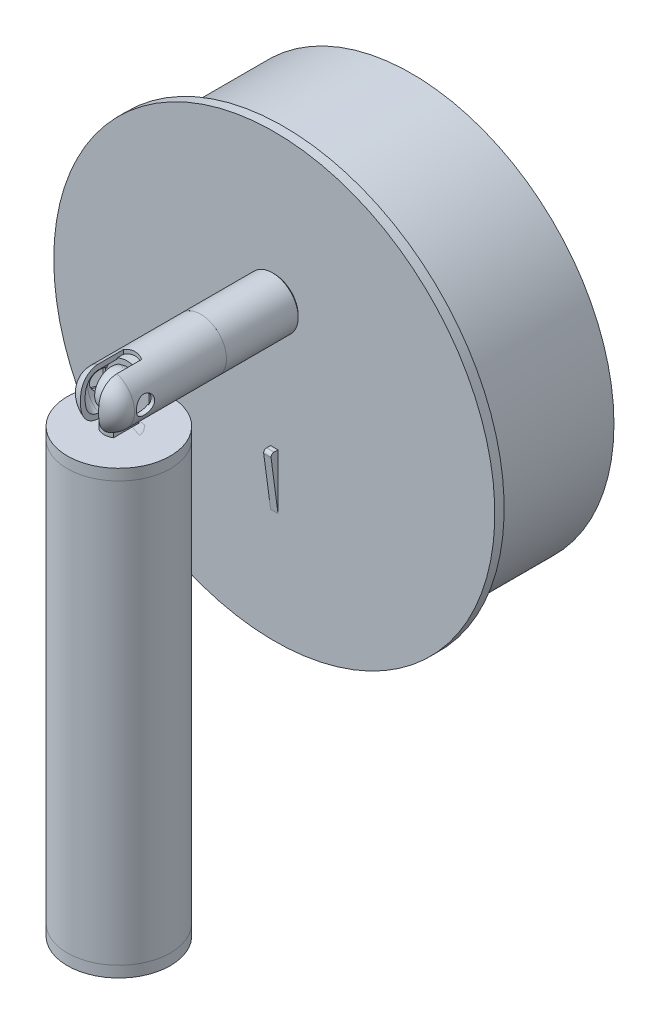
ISO-10303-21;
HEADER;
FILE_DESCRIPTION(('STEP AP214'),'2;1');
FILE_NAME('part.step','',(''),(''),'','','');
FILE_SCHEMA(('AUTOMOTIVE_DESIGN { 1 0 10303 214 1 1 1 1 }'));
ENDSEC;
DATA;
#1=APPLICATION_CONTEXT('core data for automotive mechanical design processes');
#2=APPLICATION_PROTOCOL_DEFINITION('international standard','automotive_design',2000,#1);
#3=PRODUCT_CONTEXT('',#1,'mechanical');
#4=PRODUCT('Part','Part','',(#3));
#5=PRODUCT_RELATED_PRODUCT_CATEGORY('part','',(#4));
#6=PRODUCT_DEFINITION_FORMATION('','',#4);
#7=PRODUCT_DEFINITION_CONTEXT('part definition',#1,'design');
#8=PRODUCT_DEFINITION('design','',#6,#7);
#9=PRODUCT_DEFINITION_SHAPE('','',#8);
#10=(LENGTH_UNIT() NAMED_UNIT(*) SI_UNIT(.MILLI.,.METRE.));
#11=(NAMED_UNIT(*) PLANE_ANGLE_UNIT() SI_UNIT($,.RADIAN.));
#12=(NAMED_UNIT(*) SI_UNIT($,.STERADIAN.) SOLID_ANGLE_UNIT());
#13=UNCERTAINTY_MEASURE_WITH_UNIT(LENGTH_MEASURE(1.E-05),#10,'distance_accuracy_value','');
#14=(GEOMETRIC_REPRESENTATION_CONTEXT(3) GLOBAL_UNCERTAINTY_ASSIGNED_CONTEXT((#13)) GLOBAL_UNIT_ASSIGNED_CONTEXT((#10,
#11,#12)) REPRESENTATION_CONTEXT('',''));
#15=CARTESIAN_POINT('',(0.,0.,0.));
#16=DIRECTION('',(0.,0.,1.));
#17=DIRECTION('',(1.,0.,0.));
#18=AXIS2_PLACEMENT_3D('',#15,#16,#17);
#19=CARTESIAN_POINT('',(1.,-14.4241608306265,28.));
#20=DIRECTION('',(0.,-1.,0.));
#21=DIRECTION('',(0.,0.,-1.));
#22=AXIS2_PLACEMENT_3D('',#19,#20,#21);
#23=PLANE('',#22);
#24=DIRECTION('',(0.,0.,1.));
#25=VECTOR('',#24,1.);
#26=CARTESIAN_POINT('',(-1.,-14.4241608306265,28.));
#27=LINE('',#26,#25);
#28=CARTESIAN_POINT('',(-1.,-14.4241608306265,26.));
#29=VERTEX_POINT('',#28);
#30=CARTESIAN_POINT('',(-1.,-14.4241608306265,27.0862535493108));
#31=VERTEX_POINT('',#30);
#32=EDGE_CURVE('P0_E88',#29,#31,#27,.T.);
#33=ORIENTED_EDGE('',*,*,#32,.T.);
#34=DIRECTION('',(-1.,0.,0.));
#35=VECTOR('',#34,1.);
#36=CARTESIAN_POINT('',(1.,-14.4241608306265,27.0862535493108));
#37=LINE('',#36,#35);
#38=CARTESIAN_POINT('',(1.,-14.4241608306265,27.0862535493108));
#39=VERTEX_POINT('',#38);
#40=EDGE_CURVE('P0_E60',#31,#39,#37,.F.);
#41=ORIENTED_EDGE('',*,*,#40,.T.);
#42=DIRECTION('',(0.,0.,1.));
#43=VECTOR('',#42,1.);
#44=CARTESIAN_POINT('',(1.,-14.4241608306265,28.));
#45=LINE('',#44,#43);
#46=CARTESIAN_POINT('',(1.,-14.4241608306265,26.));
#47=VERTEX_POINT('',#46);
#48=EDGE_CURVE('P0_E117',#47,#39,#45,.T.);
#49=ORIENTED_EDGE('',*,*,#48,.F.);
#50=DIRECTION('',(-1.,0.,0.));
#51=VECTOR('',#50,1.);
#52=CARTESIAN_POINT('',(1.,-14.4241608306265,26.));
#53=LINE('',#52,#51);
#54=EDGE_CURVE('P0_E111',#47,#29,#53,.T.);
#55=ORIENTED_EDGE('',*,*,#54,.T.);
#56=EDGE_LOOP('',(#33,#41,#49,#55));
#57=FACE_BOUND('',#56,.T.);
#58=ADVANCED_FACE('P0_F43',(#57),#23,.F.);
#59=CARTESIAN_POINT('',(1.,-29.4241608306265,26.));
#60=DIRECTION('',(0.,0.132163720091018,-0.991227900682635));
#61=DIRECTION('',(0.,0.991227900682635,0.132163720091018));
#62=AXIS2_PLACEMENT_3D('',#59,#60,#61);
#63=PLANE('',#62);
#64=DIRECTION('',(0.,-0.991227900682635,-0.132163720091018));
#65=VECTOR('',#64,1.);
#66=CARTESIAN_POINT('',(1.,-29.4241608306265,26.));
#67=LINE('',#66,#65);
#68=CARTESIAN_POINT('',(1.,-15.3298918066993,27.879235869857));
#69=VERTEX_POINT('',#68);
#70=CARTESIAN_POINT('',(1.,-29.4241608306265,26.));
#71=VERTEX_POINT('',#70);
#72=EDGE_CURVE('P0_E112',#69,#71,#67,.T.);
#73=ORIENTED_EDGE('',*,*,#72,.F.);
#74=DIRECTION('',(-1.,0.,0.));
#75=VECTOR('',#74,1.);
#76=CARTESIAN_POINT('',(1.,-15.3298918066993,27.879235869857));
#77=LINE('',#76,#75);
#78=CARTESIAN_POINT('',(-1.,-15.3298918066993,27.879235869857));
#79=VERTEX_POINT('',#78);
#80=EDGE_CURVE('P0_E104',#69,#79,#77,.T.);
#81=ORIENTED_EDGE('',*,*,#80,.T.);
#82=DIRECTION('',(0.,-0.991227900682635,-0.132163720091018));
#83=VECTOR('',#82,1.);
#84=CARTESIAN_POINT('',(-1.,-29.4241608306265,26.));
#85=LINE('',#84,#83);
#86=CARTESIAN_POINT('',(-1.,-29.4241608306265,26.));
#87=VERTEX_POINT('',#86);
#88=EDGE_CURVE('P0_E87',#79,#87,#85,.T.);
#89=ORIENTED_EDGE('',*,*,#88,.T.);
#90=DIRECTION('',(-1.,0.,0.));
#91=VECTOR('',#90,1.);
#92=CARTESIAN_POINT('',(1.,-29.4241608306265,26.));
#93=LINE('',#92,#91);
#94=EDGE_CURVE('P0_E101',#71,#87,#93,.T.);
#95=ORIENTED_EDGE('',*,*,#94,.F.);
#96=EDGE_LOOP('',(#73,#81,#89,#95));
#97=FACE_BOUND('',#96,.T.);
#98=ADVANCED_FACE('P0_F100',(#97),#63,.F.);
#99=CARTESIAN_POINT('',(1.,0.,0.));
#100=DIRECTION('',(1.,0.,0.));
#101=DIRECTION('',(0.,0.,-1.));
#102=AXIS2_PLACEMENT_3D('',#99,#100,#101);
#103=PLANE('',#102);
#104=ORIENTED_EDGE('',*,*,#48,.T.);
#105=CARTESIAN_POINT('',(1.,-15.2241608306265,27.0862535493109));
#106=DIRECTION('',(1.,0.,0.));
#107=DIRECTION('',(0.,0.,-1.));
#108=AXIS2_PLACEMENT_3D('',#105,#106,#107);
#109=CIRCLE('',#108,0.8);
#110=EDGE_CURVE('P0_E126',#39,#69,#109,.T.);
#111=ORIENTED_EDGE('',*,*,#110,.T.);
#112=ORIENTED_EDGE('',*,*,#72,.T.);
#113=DIRECTION('',(0.,1.,0.));
#114=VECTOR('',#113,1.);
#115=CARTESIAN_POINT('',(1.,-14.4241608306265,26.));
#116=LINE('',#115,#114);
#117=EDGE_CURVE('P0_E106',#71,#47,#116,.T.);
#118=ORIENTED_EDGE('',*,*,#117,.T.);
#119=EDGE_LOOP('',(#104,#111,#112,#118));
#120=FACE_BOUND('',#119,.T.);
#121=ADVANCED_FACE('P0_F159',(#120),#103,.T.);
#122=CARTESIAN_POINT('',(-1.,0.,0.));
#123=DIRECTION('',(1.,0.,0.));
#124=DIRECTION('',(0.,0.,-1.));
#125=AXIS2_PLACEMENT_3D('',#122,#123,#124);
#126=PLANE('',#125);
#127=ORIENTED_EDGE('',*,*,#88,.F.);
#128=CARTESIAN_POINT('',(-1.,-15.2241608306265,27.0862535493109));
#129=DIRECTION('',(1.,0.,0.));
#130=DIRECTION('',(0.,0.,-1.));
#131=AXIS2_PLACEMENT_3D('',#128,#129,#130);
#132=CIRCLE('',#131,0.8);
#133=EDGE_CURVE('P0_E68',#79,#31,#132,.F.);
#134=ORIENTED_EDGE('',*,*,#133,.T.);
#135=ORIENTED_EDGE('',*,*,#32,.F.);
#136=DIRECTION('',(0.,1.,0.));
#137=VECTOR('',#136,1.);
#138=CARTESIAN_POINT('',(-1.,-14.4241608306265,26.));
#139=LINE('',#138,#137);
#140=EDGE_CURVE('P0_E84',#87,#29,#139,.T.);
#141=ORIENTED_EDGE('',*,*,#140,.F.);
#142=EDGE_LOOP('',(#127,#134,#135,#141));
#143=FACE_BOUND('',#142,.T.);
#144=ADVANCED_FACE('P0_F86',(#143),#126,.F.);
#145=CARTESIAN_POINT('',(1.,-15.2241608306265,27.0862535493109));
#146=DIRECTION('',(-1.,0.,0.));
#147=DIRECTION('',(0.,0.,1.));
#148=AXIS2_PLACEMENT_3D('',#145,#146,#147);
#149=CYLINDRICAL_SURFACE('',#148,0.8);
#150=ORIENTED_EDGE('',*,*,#110,.F.);
#151=ORIENTED_EDGE('',*,*,#40,.F.);
#152=ORIENTED_EDGE('',*,*,#133,.F.);
#153=ORIENTED_EDGE('',*,*,#80,.F.);
#154=EDGE_LOOP('',(#150,#151,#152,#153));
#155=FACE_BOUND('',#154,.T.);
#156=ADVANCED_FACE('P0_F45',(#155),#149,.T.);
#157=CARTESIAN_POINT('',(0.,0.,26.));
#158=DIRECTION('',(0.,0.,-1.));
#159=DIRECTION('',(-1.,0.,0.));
#160=AXIS2_PLACEMENT_3D('',#157,#158,#159);
#161=PLANE('',#160);
#162=CARTESIAN_POINT('',(0.,20.,26.));
#163=DIRECTION('',(0.,0.,-1.));
#164=DIRECTION('',(-0.827756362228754,-0.561087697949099,0.));
#165=AXIS2_PLACEMENT_3D('',#162,#163,#164);
#166=CIRCLE('',#165,6.5);
#167=CARTESIAN_POINT('',(-5.3804163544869,16.3529299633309,26.));
#168=VERTEX_POINT('',#167);
#169=EDGE_CURVE('P0_E187',#168,#168,#166,.T.);
#170=ORIENTED_EDGE('',*,*,#169,.T.);
#171=EDGE_LOOP('',(#170));
#172=FACE_BOUND('',#171,.T.);
#173=CARTESIAN_POINT('',(0.,0.,26.));
#174=DIRECTION('',(0.,0.,-1.));
#175=DIRECTION('',(-1.,0.,0.));
#176=AXIS2_PLACEMENT_3D('',#173,#174,#175);
#177=CIRCLE('',#176,59.944);
#178=CARTESIAN_POINT('',(-59.944,0.,26.));
#179=VERTEX_POINT('',#178);
#180=EDGE_CURVE('P0_E178',#179,#179,#177,.T.);
#181=ORIENTED_EDGE('',*,*,#180,.F.);
#182=EDGE_LOOP('',(#181));
#183=FACE_BOUND('',#182,.T.);
#184=ORIENTED_EDGE('',*,*,#94,.T.);
#185=ORIENTED_EDGE('',*,*,#140,.T.);
#186=ORIENTED_EDGE('',*,*,#54,.F.);
#187=ORIENTED_EDGE('',*,*,#117,.F.);
#188=EDGE_LOOP('',(#184,#185,#186,#187));
#189=FACE_BOUND('',#188,.T.);
#190=ADVANCED_FACE('P0_F108',(#172,#183,#189),#161,.F.);
#191=CARTESIAN_POINT('',(0.,0.,23.46));
#192=DIRECTION('',(0.,0.,1.));
#193=DIRECTION('',(1.,0.,0.));
#194=AXIS2_PLACEMENT_3D('',#191,#192,#193);
#195=CYLINDRICAL_SURFACE('',#194,59.944);
#196=CARTESIAN_POINT('',(0.,0.,23.46));
#197=DIRECTION('',(0.,0.,-1.));
#198=DIRECTION('',(-1.,0.,0.));
#199=AXIS2_PLACEMENT_3D('',#196,#197,#198);
#200=CIRCLE('',#199,59.944);
#201=CARTESIAN_POINT('',(-59.944,0.,23.46));
#202=VERTEX_POINT('',#201);
#203=EDGE_CURVE('P0_E94',#202,#202,#200,.T.);
#204=ORIENTED_EDGE('',*,*,#203,.F.);
#205=EDGE_LOOP('',(#204));
#206=FACE_BOUND('',#205,.T.);
#207=ORIENTED_EDGE('',*,*,#180,.T.);
#208=EDGE_LOOP('',(#207));
#209=FACE_BOUND('',#208,.T.);
#210=ADVANCED_FACE('P0_F153',(#206,#209),#195,.T.);
#211=CARTESIAN_POINT('',(0.,0.,23.46));
#212=DIRECTION('',(0.,0.,-1.));
#213=DIRECTION('',(-1.,0.,0.));
#214=AXIS2_PLACEMENT_3D('',#211,#212,#213);
#215=PLANE('',#214);
#216=CARTESIAN_POINT('',(0.,0.,23.46));
#217=DIRECTION('',(0.,0.,-1.));
#218=DIRECTION('',(-1.,0.,0.));
#219=AXIS2_PLACEMENT_3D('',#216,#217,#218);
#220=CIRCLE('',#219,54.991);
#221=CARTESIAN_POINT('',(-54.991,0.,23.46));
#222=VERTEX_POINT('',#221);
#223=EDGE_CURVE('P0_E11',#222,#222,#220,.T.);
#224=ORIENTED_EDGE('',*,*,#223,.F.);
#225=EDGE_LOOP('',(#224));
#226=FACE_BOUND('',#225,.T.);
#227=ORIENTED_EDGE('',*,*,#203,.T.);
#228=EDGE_LOOP('',(#227));
#229=FACE_BOUND('',#228,.T.);
#230=ADVANCED_FACE('P0_F166',(#226,#229),#215,.T.);
#231=CARTESIAN_POINT('',(0.,20.,46.));
#232=DIRECTION('',(0.,0.,-1.));
#233=DIRECTION('',(-0.827756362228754,-0.561087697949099,0.));
#234=AXIS2_PLACEMENT_3D('',#231,#232,#233);
#235=CYLINDRICAL_SURFACE('',#234,7.);
#236=CARTESIAN_POINT('',(0.,20.,26.5));
#237=DIRECTION('',(0.,0.,-1.));
#238=DIRECTION('',(-0.827756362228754,-0.561087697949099,0.));
#239=AXIS2_PLACEMENT_3D('',#236,#237,#238);
#240=CIRCLE('',#239,7.);
#241=CARTESIAN_POINT('',(-5.79429453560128,16.0723861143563,26.5));
#242=VERTEX_POINT('',#241);
#243=EDGE_CURVE('P0_E181',#242,#242,#240,.F.);
#244=ORIENTED_EDGE('',*,*,#243,.T.);
#245=EDGE_LOOP('',(#244));
#246=FACE_BOUND('',#245,.T.);
#247=CARTESIAN_POINT('',(0.,20.,46.));
#248=DIRECTION('',(0.,0.,-1.));
#249=DIRECTION('',(-0.827756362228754,-0.561087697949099,0.));
#250=AXIS2_PLACEMENT_3D('',#247,#248,#249);
#251=CIRCLE('',#250,7.);
#252=CARTESIAN_POINT('',(-5.79429453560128,16.0723861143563,46.));
#253=VERTEX_POINT('',#252);
#254=EDGE_CURVE('P0_E295',#253,#253,#251,.T.);
#255=ORIENTED_EDGE('',*,*,#254,.T.);
#256=EDGE_LOOP('',(#255));
#257=FACE_BOUND('',#256,.T.);
#258=ADVANCED_FACE('P0_F171',(#246,#257),#235,.T.);
#259=CARTESIAN_POINT('',(0.,20.,46.));
#260=DIRECTION('',(0.,0.,-1.));
#261=DIRECTION('',(-0.827756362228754,-0.561087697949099,0.));
#262=AXIS2_PLACEMENT_3D('',#259,#260,#261);
#263=PLANE('',#262);
#264=CARTESIAN_POINT('',(0.,20.,46.));
#265=DIRECTION('',(0.,0.,-1.));
#266=DIRECTION('',(-0.827756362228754,-0.561087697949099,0.));
#267=AXIS2_PLACEMENT_3D('',#264,#265,#266);
#268=CIRCLE('',#267,6.);
#269=CARTESIAN_POINT('',(-4.96653817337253,16.6334738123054,46.));
#270=VERTEX_POINT('',#269);
#271=EDGE_CURVE('P0_E291',#270,#270,#268,.T.);
#272=ORIENTED_EDGE('',*,*,#271,.T.);
#273=EDGE_LOOP('',(#272));
#274=FACE_BOUND('',#273,.T.);
#275=ORIENTED_EDGE('',*,*,#254,.F.);
#276=EDGE_LOOP('',(#275));
#277=FACE_BOUND('',#276,.T.);
#278=ADVANCED_FACE('P0_F224',(#274,#277),#263,.F.);
#279=CARTESIAN_POINT('',(0.,20.,46.));
#280=DIRECTION('',(0.,0.,-1.));
#281=DIRECTION('',(-0.827756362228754,-0.561087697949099,0.));
#282=AXIS2_PLACEMENT_3D('',#279,#280,#281);
#283=CYLINDRICAL_SURFACE('',#282,6.);
#284=ORIENTED_EDGE('',*,*,#271,.F.);
#285=EDGE_LOOP('',(#284));
#286=FACE_BOUND('',#285,.T.);
#287=CARTESIAN_POINT('',(0.,20.,26.));
#288=DIRECTION('',(0.,0.,-1.));
#289=DIRECTION('',(-1.,0.,0.));
#290=AXIS2_PLACEMENT_3D('',#287,#288,#289);
#291=CIRCLE('',#290,6.);
#292=CARTESIAN_POINT('',(-6.,20.,26.));
#293=VERTEX_POINT('',#292);
#294=EDGE_CURVE('P0_E47',#293,#293,#291,.T.);
#295=ORIENTED_EDGE('',*,*,#294,.T.);
#296=EDGE_LOOP('',(#295));
#297=FACE_BOUND('',#296,.T.);
#298=ADVANCED_FACE('P0_F134',(#286,#297),#283,.F.);
#299=CARTESIAN_POINT('',(0.,20.,26.));
#300=DIRECTION('',(0.,0.,1.));
#301=DIRECTION('',(0.827756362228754,0.561087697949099,0.));
#302=AXIS2_PLACEMENT_3D('',#299,#300,#301);
#303=CONICAL_SURFACE('',#302,6.5,0.785398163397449);
#304=ORIENTED_EDGE('',*,*,#243,.F.);
#305=EDGE_LOOP('',(#304));
#306=FACE_BOUND('',#305,.T.);
#307=ORIENTED_EDGE('',*,*,#169,.F.);
#308=EDGE_LOOP('',(#307));
#309=FACE_BOUND('',#308,.T.);
#310=ADVANCED_FACE('P0_F139',(#306,#309),#303,.T.);
#311=ORIENTED_EDGE('',*,*,#294,.F.);
#312=EDGE_LOOP('',(#311));
#313=FACE_BOUND('',#312,.T.);
#314=ADVANCED_FACE('P0_F136',(#313),#161,.F.);
#315=CARTESIAN_POINT('',(0.,0.,-11.338));
#316=DIRECTION('',(0.,0.,1.));
#317=DIRECTION('',(1.,0.,0.));
#318=AXIS2_PLACEMENT_3D('',#315,#316,#317);
#319=CYLINDRICAL_SURFACE('',#318,54.991);
#320=CARTESIAN_POINT('',(0.,0.,-11.338));
#321=DIRECTION('',(0.,0.,-1.));
#322=DIRECTION('',(-1.,0.,0.));
#323=AXIS2_PLACEMENT_3D('',#320,#321,#322);
#324=CIRCLE('',#323,54.991);
#325=CARTESIAN_POINT('',(-54.991,0.,-11.338));
#326=VERTEX_POINT('',#325);
#327=EDGE_CURVE('P0_E289',#326,#326,#324,.T.);
#328=ORIENTED_EDGE('',*,*,#327,.F.);
#329=EDGE_LOOP('',(#328));
#330=FACE_BOUND('',#329,.T.);
#331=ORIENTED_EDGE('',*,*,#223,.T.);
#332=EDGE_LOOP('',(#331));
#333=FACE_BOUND('',#332,.T.);
#334=ADVANCED_FACE('P0_F138',(#330,#333),#319,.T.);
#335=CARTESIAN_POINT('',(0.,0.,-11.338));
#336=DIRECTION('',(0.,0.,-1.));
#337=DIRECTION('',(-1.,0.,0.));
#338=AXIS2_PLACEMENT_3D('',#335,#336,#337);
#339=PLANE('',#338);
#340=ORIENTED_EDGE('',*,*,#327,.T.);
#341=EDGE_LOOP('',(#340));
#342=FACE_BOUND('',#341,.T.);
#343=ADVANCED_FACE('P0_F145',(#342),#339,.T.);
#344=CLOSED_SHELL('',(#58,#98,#121,#144,#156,#190,#210,#230,#258,#278,#298,#310,#314,#334,#343));
#345=MANIFOLD_SOLID_BREP('P0_B2',#344);
#346=CARTESIAN_POINT('',(0.,20.,66.));
#347=DIRECTION('',(0.,0.,-1.));
#348=DIRECTION('',(-0.827756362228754,-0.561087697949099,0.));
#349=AXIS2_PLACEMENT_3D('',#346,#347,#348);
#350=CYLINDRICAL_SURFACE('',#349,6.);
#351=CARTESIAN_POINT('',(0.,20.,66.));
#352=DIRECTION('',(0.,0.,1.));
#353=DIRECTION('',(0.827756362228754,0.561087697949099,0.));
#354=AXIS2_PLACEMENT_3D('',#351,#352,#353);
#355=CIRCLE('',#354,6.);
#356=CARTESIAN_POINT('',(4.96653817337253,23.3665261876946,66.));
#357=VERTEX_POINT('',#356);
#358=EDGE_CURVE('P1_E10',#357,#357,#355,.T.);
#359=ORIENTED_EDGE('',*,*,#358,.F.);
#360=EDGE_LOOP('',(#359));
#361=FACE_BOUND('',#360,.T.);
#362=CARTESIAN_POINT('',(0.,20.,46.));
#363=DIRECTION('',(0.,0.,1.));
#364=DIRECTION('',(0.827756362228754,0.561087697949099,0.));
#365=AXIS2_PLACEMENT_3D('',#362,#363,#364);
#366=CIRCLE('',#365,6.);
#367=CARTESIAN_POINT('',(4.96653817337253,23.3665261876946,46.));
#368=VERTEX_POINT('',#367);
#369=EDGE_CURVE('P1_E22',#368,#368,#366,.T.);
#370=ORIENTED_EDGE('',*,*,#369,.T.);
#371=EDGE_LOOP('',(#370));
#372=FACE_BOUND('',#371,.T.);
#373=ADVANCED_FACE('P1_F15',(#361,#372),#350,.T.);
#374=CARTESIAN_POINT('',(0.,20.,66.));
#375=DIRECTION('',(0.,0.,1.));
#376=DIRECTION('',(0.827756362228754,0.561087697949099,0.));
#377=AXIS2_PLACEMENT_3D('',#374,#375,#376);
#378=PLANE('',#377);
#379=CARTESIAN_POINT('',(0.,20.,66.));
#380=DIRECTION('',(0.,0.,1.));
#381=DIRECTION('',(0.827756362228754,0.561087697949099,0.));
#382=AXIS2_PLACEMENT_3D('',#379,#380,#381);
#383=CIRCLE('',#382,2.5);
#384=CARTESIAN_POINT('',(-2.06939090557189,18.5972807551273,66.));
#385=VERTEX_POINT('',#384);
#386=EDGE_CURVE('P1_E27',#385,#385,#383,.T.);
#387=ORIENTED_EDGE('',*,*,#386,.F.);
#388=EDGE_LOOP('',(#387));
#389=FACE_BOUND('',#388,.T.);
#390=ORIENTED_EDGE('',*,*,#358,.T.);
#391=EDGE_LOOP('',(#390));
#392=FACE_BOUND('',#391,.T.);
#393=ADVANCED_FACE('P1_F45',(#389,#392),#378,.T.);
#394=CARTESIAN_POINT('',(0.,20.,46.));
#395=DIRECTION('',(0.,0.,1.));
#396=DIRECTION('',(0.827756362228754,0.561087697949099,0.));
#397=AXIS2_PLACEMENT_3D('',#394,#395,#396);
#398=PLANE('',#397);
#399=CARTESIAN_POINT('',(0.,20.,46.));
#400=DIRECTION('',(0.,0.,1.));
#401=DIRECTION('',(0.827756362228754,0.561087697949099,0.));
#402=AXIS2_PLACEMENT_3D('',#399,#400,#401);
#403=CIRCLE('',#402,2.5);
#404=CARTESIAN_POINT('',(-2.06939090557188,18.5972807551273,46.));
#405=VERTEX_POINT('',#404);
#406=EDGE_CURVE('P1_E18',#405,#405,#403,.T.);
#407=ORIENTED_EDGE('',*,*,#406,.T.);
#408=EDGE_LOOP('',(#407));
#409=FACE_BOUND('',#408,.T.);
#410=ORIENTED_EDGE('',*,*,#369,.F.);
#411=EDGE_LOOP('',(#410));
#412=FACE_BOUND('',#411,.T.);
#413=ADVANCED_FACE('P1_F35',(#409,#412),#398,.F.);
#414=CARTESIAN_POINT('',(0.,20.,76.));
#415=DIRECTION('',(0.,0.,-1.));
#416=DIRECTION('',(-0.827756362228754,-0.561087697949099,0.));
#417=AXIS2_PLACEMENT_3D('',#414,#415,#416);
#418=CYLINDRICAL_SURFACE('',#417,2.5);
#419=CARTESIAN_POINT('',(-2.06939090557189,18.5972807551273,66.));
#420=CARTESIAN_POINT('',(-2.06939090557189,18.5972807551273,65.7916666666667));
#421=CARTESIAN_POINT('',(-2.06939090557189,18.5972807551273,65.5833333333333));
#422=CARTESIAN_POINT('',(-2.06939090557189,18.5972807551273,65.1666666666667));
#423=CARTESIAN_POINT('',(-2.06939090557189,18.5972807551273,64.9583333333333));
#424=CARTESIAN_POINT('',(-2.06939090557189,18.5972807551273,64.5416666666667));
#425=CARTESIAN_POINT('',(-2.06939090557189,18.5972807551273,64.3333333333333));
#426=CARTESIAN_POINT('',(-2.06939090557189,18.5972807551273,63.9166666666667));
#427=CARTESIAN_POINT('',(-2.06939090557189,18.5972807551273,63.7083333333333));
#428=CARTESIAN_POINT('',(-2.06939090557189,18.5972807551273,63.2916666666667));
#429=CARTESIAN_POINT('',(-2.06939090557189,18.5972807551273,63.0833333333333));
#430=CARTESIAN_POINT('',(-2.06939090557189,18.5972807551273,62.6666666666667));
#431=CARTESIAN_POINT('',(-2.06939090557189,18.5972807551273,62.4583333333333));
#432=CARTESIAN_POINT('',(-2.06939090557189,18.5972807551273,62.0416666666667));
#433=CARTESIAN_POINT('',(-2.06939090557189,18.5972807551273,61.8333333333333));
#434=CARTESIAN_POINT('',(-2.06939090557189,18.5972807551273,61.4166666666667));
#435=CARTESIAN_POINT('',(-2.06939090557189,18.5972807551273,61.2083333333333));
#436=CARTESIAN_POINT('',(-2.06939090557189,18.5972807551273,60.7916666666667));
#437=CARTESIAN_POINT('',(-2.06939090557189,18.5972807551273,60.5833333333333));
#438=CARTESIAN_POINT('',(-2.06939090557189,18.5972807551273,60.1666666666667));
#439=CARTESIAN_POINT('',(-2.06939090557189,18.5972807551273,59.9583333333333));
#440=CARTESIAN_POINT('',(-2.06939090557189,18.5972807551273,59.5416666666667));
#441=CARTESIAN_POINT('',(-2.06939090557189,18.5972807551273,59.3333333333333));
#442=CARTESIAN_POINT('',(-2.06939090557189,18.5972807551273,58.9166666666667));
#443=CARTESIAN_POINT('',(-2.06939090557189,18.5972807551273,58.7083333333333));
#444=CARTESIAN_POINT('',(-2.06939090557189,18.5972807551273,58.2916666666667));
#445=CARTESIAN_POINT('',(-2.06939090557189,18.5972807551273,58.0833333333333));
#446=CARTESIAN_POINT('',(-2.06939090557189,18.5972807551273,57.6666666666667));
#447=CARTESIAN_POINT('',(-2.06939090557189,18.5972807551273,57.4583333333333));
#448=CARTESIAN_POINT('',(-2.06939090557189,18.5972807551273,57.0416666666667));
#449=CARTESIAN_POINT('',(-2.06939090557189,18.5972807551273,56.8333333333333));
#450=CARTESIAN_POINT('',(-2.06939090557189,18.5972807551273,56.4166666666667));
#451=CARTESIAN_POINT('',(-2.06939090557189,18.5972807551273,56.2083333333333));
#452=CARTESIAN_POINT('',(-2.06939090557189,18.5972807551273,55.7916666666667));
#453=CARTESIAN_POINT('',(-2.06939090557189,18.5972807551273,55.5833333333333));
#454=CARTESIAN_POINT('',(-2.06939090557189,18.5972807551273,55.1666666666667));
#455=CARTESIAN_POINT('',(-2.06939090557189,18.5972807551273,54.9583333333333));
#456=CARTESIAN_POINT('',(-2.06939090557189,18.5972807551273,54.5416666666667));
#457=CARTESIAN_POINT('',(-2.06939090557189,18.5972807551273,54.3333333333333));
#458=CARTESIAN_POINT('',(-2.06939090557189,18.5972807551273,53.9166666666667));
#459=CARTESIAN_POINT('',(-2.06939090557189,18.5972807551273,53.7083333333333));
#460=CARTESIAN_POINT('',(-2.06939090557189,18.5972807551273,53.2916666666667));
#461=CARTESIAN_POINT('',(-2.06939090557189,18.5972807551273,53.0833333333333));
#462=CARTESIAN_POINT('',(-2.06939090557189,18.5972807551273,52.6666666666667));
#463=CARTESIAN_POINT('',(-2.06939090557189,18.5972807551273,52.4583333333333));
#464=CARTESIAN_POINT('',(-2.06939090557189,18.5972807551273,52.0416666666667));
#465=CARTESIAN_POINT('',(-2.06939090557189,18.5972807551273,51.8333333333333));
#466=CARTESIAN_POINT('',(-2.06939090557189,18.5972807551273,51.4166666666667));
#467=CARTESIAN_POINT('',(-2.06939090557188,18.5972807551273,51.2083333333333));
#468=CARTESIAN_POINT('',(-2.06939090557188,18.5972807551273,50.7916666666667));
#469=CARTESIAN_POINT('',(-2.06939090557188,18.5972807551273,50.5833333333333));
#470=CARTESIAN_POINT('',(-2.06939090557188,18.5972807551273,50.1666666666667));
#471=CARTESIAN_POINT('',(-2.06939090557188,18.5972807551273,49.9583333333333));
#472=CARTESIAN_POINT('',(-2.06939090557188,18.5972807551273,49.5416666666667));
#473=CARTESIAN_POINT('',(-2.06939090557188,18.5972807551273,49.3333333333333));
#474=CARTESIAN_POINT('',(-2.06939090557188,18.5972807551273,48.9166666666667));
#475=CARTESIAN_POINT('',(-2.06939090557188,18.5972807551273,48.7083333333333));
#476=CARTESIAN_POINT('',(-2.06939090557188,18.5972807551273,48.2916666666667));
#477=CARTESIAN_POINT('',(-2.06939090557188,18.5972807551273,48.0833333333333));
#478=CARTESIAN_POINT('',(-2.06939090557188,18.5972807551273,47.6666666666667));
#479=CARTESIAN_POINT('',(-2.06939090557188,18.5972807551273,47.4583333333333));
#480=CARTESIAN_POINT('',(-2.06939090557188,18.5972807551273,47.0416666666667));
#481=CARTESIAN_POINT('',(-2.06939090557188,18.5972807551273,46.8333333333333));
#482=CARTESIAN_POINT('',(-2.06939090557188,18.5972807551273,46.4166666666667));
#483=CARTESIAN_POINT('',(-2.06939090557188,18.5972807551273,46.2083333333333));
#484=CARTESIAN_POINT('',(-2.06939090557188,18.5972807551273,46.));
#485=B_SPLINE_CURVE_WITH_KNOTS('',3,(#419,#420,#421,#422,#423,#424,#425,#426,#427,#428,#429,
#430,#431,#432,#433,#434,#435,#436,#437,#438,#439,#440,#441,#442,#443,#444,#445,#446,#447,#448,
#449,#450,#451,#452,#453,#454,#455,#456,#457,#458,#459,#460,#461,#462,#463,#464,#465,#466,#467,
#468,#469,#470,#471,#472,#473,#474,#475,#476,#477,#478,#479,#480,#481,#482,#483,#484),
.UNSPECIFIED.,.F.,.F.,(4,2,2,2,2,2,2,2,2,2,2,2,2,2,2,2,2,2,2,2,2,2,2,2,2,2,2,2,2,2,2,2,4),(0.,
0.625000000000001,1.24999999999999,1.875,2.49999999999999,3.12499999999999,3.75,4.375,5.,
5.62499999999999,6.24999999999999,6.87499999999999,7.49999999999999,8.12499999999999,
8.74999999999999,9.37499999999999,9.99999999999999,10.625,11.25,11.875,12.5,13.125,13.75,14.375,
15.,15.625,16.25,16.875,17.5,18.125,18.75,19.375,20.),.UNSPECIFIED.);
#486=EDGE_CURVE('P1_BSEAM38',#385,#405,#485,.T.);
#487=ORIENTED_EDGE('',*,*,#386,.T.);
#488=ORIENTED_EDGE('',*,*,#406,.F.);
#489=ORIENTED_EDGE('',*,*,#486,.T.);
#490=ORIENTED_EDGE('',*,*,#486,.F.);
#491=EDGE_LOOP('',(#487,#489,#488,#490));
#492=FACE_BOUND('',#491,.T.);
#493=ADVANCED_FACE('P1_F38',(#492),#418,.F.);
#494=CLOSED_SHELL('',(#373,#393,#413,#493));
#495=MANIFOLD_SOLID_BREP('P1_B1',#494);
#496=CARTESIAN_POINT('',(0.,20.,71.));
#497=DIRECTION('',(0.,0.,1.));
#498=DIRECTION('',(-1.,0.,0.));
#499=AXIS2_PLACEMENT_3D('',#496,#497,#498);
#500=DEGENERATE_TOROIDAL_SURFACE('',#499,2.,5.,.T.);
#501=CARTESIAN_POINT('',(2.25,20.,75.9937460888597));
#502=CARTESIAN_POINT('',(2.25,20.0942511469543,75.9937458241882));
#503=CARTESIAN_POINT('',(2.25,20.1885022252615,75.9934600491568));
#504=CARTESIAN_POINT('',(2.25,20.3769988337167,75.9921973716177));
#505=CARTESIAN_POINT('',(2.25,20.4712443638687,75.9912204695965));
#506=CARTESIAN_POINT('',(2.25,20.7539872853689,75.9868124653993));
#507=CARTESIAN_POINT('',(2.25,20.9424719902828,75.9819039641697));
#508=CARTESIAN_POINT('',(2.25,21.3184842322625,75.964280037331));
#509=CARTESIAN_POINT('',(2.25,21.5060128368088,75.9515914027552));
#510=CARTESIAN_POINT('',(2.25,21.8799146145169,75.9144108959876));
#511=CARTESIAN_POINT('',(2.25,22.0662881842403,75.8899233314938));
#512=CARTESIAN_POINT('',(2.25,22.4099415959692,75.8307384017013));
#513=CARTESIAN_POINT('',(2.25,22.5675556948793,75.7980124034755));
#514=CARTESIAN_POINT('',(2.25,22.8797730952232,75.7204852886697));
#515=CARTESIAN_POINT('',(2.25,23.0343772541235,75.6756876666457));
#516=CARTESIAN_POINT('',(2.25,23.3394663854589,75.5732320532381));
#517=CARTESIAN_POINT('',(2.25,23.4899469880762,75.5155609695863));
#518=CARTESIAN_POINT('',(2.25,23.7852172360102,75.3870962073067));
#519=CARTESIAN_POINT('',(2.25,23.9300069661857,75.3163027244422));
#520=CARTESIAN_POINT('',(2.25,24.2134955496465,75.1610978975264));
#521=CARTESIAN_POINT('',(2.25,24.3521419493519,75.0765904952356));
#522=CARTESIAN_POINT('',(2.25,24.620752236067,74.8947156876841));
#523=CARTESIAN_POINT('',(2.25,24.7507156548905,74.7973475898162));
#524=CARTESIAN_POINT('',(2.25,25.0005419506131,74.59041502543));
#525=CARTESIAN_POINT('',(2.25,25.1204051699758,74.4808509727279));
#526=CARTESIAN_POINT('',(2.25,25.3487053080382,74.2504133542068));
#527=CARTESIAN_POINT('',(2.25,25.4571438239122,74.1295413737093));
#528=CARTESIAN_POINT('',(2.25,25.6481053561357,73.8939645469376));
#529=CARTESIAN_POINT('',(2.25,25.732164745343,73.7805010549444));
#530=CARTESIAN_POINT('',(2.25,25.890048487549,73.5465985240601));
#531=CARTESIAN_POINT('',(2.25,25.9638694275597,73.4261571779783));
#532=CARTESIAN_POINT('',(2.25,26.1005428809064,73.1793448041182));
#533=CARTESIAN_POINT('',(2.25,26.1634051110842,73.0529791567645));
#534=CARTESIAN_POINT('',(2.25,26.2777232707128,72.7951313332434));
#535=CARTESIAN_POINT('',(2.25,26.3291750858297,72.6636473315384));
#536=CARTESIAN_POINT('',(2.25,26.4182482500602,72.4023492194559));
#537=CARTESIAN_POINT('',(2.25,26.4563673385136,72.2727045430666));
#538=CARTESIAN_POINT('',(2.25,26.5214317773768,72.0105915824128));
#539=CARTESIAN_POINT('',(2.25,26.5483731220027,71.8781223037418));
#540=CARTESIAN_POINT('',(2.25,26.590836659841,71.6114098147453));
#541=CARTESIAN_POINT('',(2.25,26.6063632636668,71.4771673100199));
#542=CARTESIAN_POINT('',(2.25,26.6259029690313,71.2078299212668));
#543=CARTESIAN_POINT('',(2.25,26.6299117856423,71.0727347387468));
#544=CARTESIAN_POINT('',(2.25,26.6246038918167,70.6711689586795));
#545=CARTESIAN_POINT('',(2.25,26.5985314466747,70.4047358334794));
#546=CARTESIAN_POINT('',(2.25,26.5019517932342,69.8800892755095));
#547=CARTESIAN_POINT('',(2.25,26.4314497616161,69.6218748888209));
#548=CARTESIAN_POINT('',(2.25,26.2942052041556,69.2463312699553));
#549=CARTESIAN_POINT('',(2.25,26.2431766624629,69.1230572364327));
#550=CARTESIAN_POINT('',(2.25,26.1310032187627,68.8812193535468));
#551=CARTESIAN_POINT('',(2.25,26.0698619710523,68.7626538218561));
#552=CARTESIAN_POINT('',(2.25,25.9378911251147,68.5309687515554));
#553=CARTESIAN_POINT('',(2.25,25.8670562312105,68.4178522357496));
#554=CARTESIAN_POINT('',(2.25,25.7162901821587,68.197909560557));
#555=CARTESIAN_POINT('',(2.25,25.636362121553,68.0910812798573));
#556=CARTESIAN_POINT('',(2.25,25.4669742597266,67.8831000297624));
#557=CARTESIAN_POINT('',(2.25,25.3774104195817,67.7820318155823));
#558=CARTESIAN_POINT('',(2.25,25.1902898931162,67.5876554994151));
#559=CARTESIAN_POINT('',(2.25,25.0927358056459,67.4943448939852));
#560=CARTESIAN_POINT('',(2.25,24.8903548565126,67.3159814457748));
#561=CARTESIAN_POINT('',(2.25,24.7855280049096,67.2309285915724));
#562=CARTESIAN_POINT('',(2.25,24.5694244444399,67.0695353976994));
#563=CARTESIAN_POINT('',(2.25,24.4581496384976,66.9931925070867));
#564=CARTESIAN_POINT('',(2.25,24.2260340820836,66.8470414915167));
#565=CARTESIAN_POINT('',(2.25,24.1049962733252,66.7775464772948));
#566=CARTESIAN_POINT('',(2.25,23.8577730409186,66.6483591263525));
#567=CARTESIAN_POINT('',(2.25,23.731586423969,66.5886690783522));
#568=CARTESIAN_POINT('',(2.25,23.4751080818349,66.4791621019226));
#569=CARTESIAN_POINT('',(2.25,23.3448190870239,66.4293387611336));
#570=CARTESIAN_POINT('',(2.25,23.0810484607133,66.339351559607));
#571=CARTESIAN_POINT('',(2.25,22.9475687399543,66.2991820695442));
#572=CARTESIAN_POINT('',(2.25,22.6666684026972,66.2249875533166));
#573=CARTESIAN_POINT('',(2.25,22.5190322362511,66.1917824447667));
#574=CARTESIAN_POINT('',(2.25,22.2218593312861,66.1352613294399));
#575=CARTESIAN_POINT('',(2.25,22.0723219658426,66.1119486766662));
#576=CARTESIAN_POINT('',(2.25,21.7717954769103,66.0737855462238));
#577=CARTESIAN_POINT('',(2.25,21.6208035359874,66.0589579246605));
#578=CARTESIAN_POINT('',(2.25,21.3183441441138,66.0359981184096));
#579=CARTESIAN_POINT('',(2.25,21.1668766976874,66.0278658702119));
#580=CARTESIAN_POINT('',(2.25,20.8623553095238,66.0160703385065));
#581=CARTESIAN_POINT('',(2.25,20.7092999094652,66.0124500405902));
#582=CARTESIAN_POINT('',(2.25,20.4031568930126,66.0077613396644));
#583=CARTESIAN_POINT('',(2.25,20.2500692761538,66.0066929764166));
#584=CARTESIAN_POINT('',(2.25,19.944055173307,66.0060252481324));
#585=CARTESIAN_POINT('',(2.25,19.7911286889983,66.0064243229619));
#586=CARTESIAN_POINT('',(2.25,19.4852951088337,66.0091449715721));
#587=CARTESIAN_POINT('',(2.25,19.3323880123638,66.0114664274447));
#588=CARTESIAN_POINT('',(2.25,19.0877588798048,66.0181153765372));
#589=CARTESIAN_POINT('',(2.25,18.9960077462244,66.0212702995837));
#590=CARTESIAN_POINT('',(2.25,18.8125868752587,66.0293816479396));
#591=CARTESIAN_POINT('',(2.25,18.7209171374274,66.0343380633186));
#592=CARTESIAN_POINT('',(2.25,18.4461486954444,66.0526386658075));
#593=CARTESIAN_POINT('',(2.25,18.263247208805,66.0694149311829));
#594=CARTESIAN_POINT('',(2.25,17.9005055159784,66.1153219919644));
#595=CARTESIAN_POINT('',(2.25,17.7206525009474,66.1443475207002));
#596=CARTESIAN_POINT('',(2.25,17.3638760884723,66.2170883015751));
#597=CARTESIAN_POINT('',(2.25,17.1869525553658,66.2608028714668));
#598=CARTESIAN_POINT('',(2.25,16.8695663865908,66.3549116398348));
#599=CARTESIAN_POINT('',(2.25,16.7283166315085,66.4026515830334));
#600=CARTESIAN_POINT('',(2.25,16.4500831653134,66.5092757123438));
#601=CARTESIAN_POINT('',(2.25,16.3130989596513,66.5681586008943));
#602=CARTESIAN_POINT('',(2.25,16.0440422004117,66.6973939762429));
#603=CARTESIAN_POINT('',(2.25,15.9119887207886,66.7677862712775));
#604=CARTESIAN_POINT('',(2.25,15.6544018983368,66.9197669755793));
#605=CARTESIAN_POINT('',(2.25,15.5288713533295,67.0013601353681));
#606=CARTESIAN_POINT('',(2.25,15.2851472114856,67.1756179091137));
#607=CARTESIAN_POINT('',(2.25,15.1669775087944,67.2683159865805));
#608=CARTESIAN_POINT('',(2.25,14.9395535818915,67.4639717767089));
#609=CARTESIAN_POINT('',(2.25,14.8302950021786,67.5669244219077));
#610=CARTESIAN_POINT('',(2.25,14.6217607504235,67.7823000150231));
#611=CARTESIAN_POINT('',(2.25,14.5224755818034,67.8947137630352));
#612=CARTESIAN_POINT('',(2.25,14.3347193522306,68.1282330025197));
#613=CARTESIAN_POINT('',(2.25,14.2462475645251,68.2493379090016));
#614=CARTESIAN_POINT('',(2.25,14.0872442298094,68.489761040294));
#615=CARTESIAN_POINT('',(2.25,14.0158605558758,68.6085167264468));
#616=CARTESIAN_POINT('',(2.25,13.8836121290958,68.8518045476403));
#617=CARTESIAN_POINT('',(2.25,13.8227509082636,68.9763386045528));
#618=CARTESIAN_POINT('',(2.25,13.7121013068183,69.2301882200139));
#619=CARTESIAN_POINT('',(2.25,13.662309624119,69.3595023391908));
#620=CARTESIAN_POINT('',(2.25,13.5741735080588,69.6220292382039));
#621=CARTESIAN_POINT('',(2.25,13.5358332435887,69.7552434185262));
#622=CARTESIAN_POINT('',(2.25,13.4719194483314,70.0204698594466));
#623=CARTESIAN_POINT('',(2.25,13.445997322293,70.1523982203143));
#624=CARTESIAN_POINT('',(2.25,13.405442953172,70.4180270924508));
#625=CARTESIAN_POINT('',(2.25,13.3908147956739,70.5517282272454));
#626=CARTESIAN_POINT('',(2.25,13.3729874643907,70.8198308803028));
#627=CARTESIAN_POINT('',(2.25,13.3697825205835,70.95423201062));
#628=CARTESIAN_POINT('',(2.25,13.3747995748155,71.2228378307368));
#629=CARTESIAN_POINT('',(2.25,13.3830258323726,71.3570424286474));
#630=CARTESIAN_POINT('',(2.25,13.4245586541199,71.7554903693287));
#631=CARTESIAN_POINT('',(2.25,13.4745503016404,72.0181792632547));
#632=CARTESIAN_POINT('',(2.25,13.6178725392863,72.5314373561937));
#633=CARTESIAN_POINT('',(2.25,13.7112026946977,72.7820066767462));
#634=CARTESIAN_POINT('',(2.25,13.8815031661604,73.1437456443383));
#635=CARTESIAN_POINT('',(2.25,13.9434693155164,73.2621867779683));
#636=CARTESIAN_POINT('',(2.25,14.0770477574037,73.4934797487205));
#637=CARTESIAN_POINT('',(2.25,14.1486566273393,73.6063335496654));
#638=CARTESIAN_POINT('',(2.25,14.3010035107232,73.825746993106));
#639=CARTESIAN_POINT('',(2.25,14.3817447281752,73.9323044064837));
#640=CARTESIAN_POINT('',(2.25,14.5516937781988,74.1383784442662));
#641=CARTESIAN_POINT('',(2.25,14.6408988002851,74.2378973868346));
#642=CARTESIAN_POINT('',(2.25,14.8286405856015,74.4308890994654));
#643=CARTESIAN_POINT('',(2.25,14.927305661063,74.5242370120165));
#644=CARTESIAN_POINT('',(2.25,15.1319115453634,74.7025113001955));
#645=CARTESIAN_POINT('',(2.25,15.2378500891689,74.7874402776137));
#646=CARTESIAN_POINT('',(2.25,15.4562607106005,74.9485069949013));
#647=CARTESIAN_POINT('',(2.25,15.5687349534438,75.0246417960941));
#648=CARTESIAN_POINT('',(2.25,15.7993115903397,75.1677591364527));
#649=CARTESIAN_POINT('',(2.25,15.917412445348,75.2347441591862));
#650=CARTESIAN_POINT('',(2.25,16.1637969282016,75.3622019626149));
#651=CARTESIAN_POINT('',(2.25,16.2922997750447,75.4222506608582));
#652=CARTESIAN_POINT('',(2.25,16.5535697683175,75.5321997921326));
#653=CARTESIAN_POINT('',(2.25,16.6863371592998,75.5820996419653));
#654=CARTESIAN_POINT('',(2.25,16.9550567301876,75.6719256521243));
#655=CARTESIAN_POINT('',(2.25,17.0910059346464,75.7118607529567));
#656=CARTESIAN_POINT('',(2.25,17.365289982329,75.7822983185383));
#657=CARTESIAN_POINT('',(2.25,17.5036246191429,75.8128015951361));
#658=CARTESIAN_POINT('',(2.25,17.8360872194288,75.8753458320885));
#659=CARTESIAN_POINT('',(2.25,18.0309700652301,75.9033624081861));
#660=CARTESIAN_POINT('',(2.25,18.4222000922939,75.945900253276));
#661=CARTESIAN_POINT('',(2.25,18.618548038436,75.9604138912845));
#662=CARTESIAN_POINT('',(2.25,19.0124061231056,75.9804953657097));
#663=CARTESIAN_POINT('',(2.25,19.2099177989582,75.9860278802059));
#664=CARTESIAN_POINT('',(2.25,19.5062001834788,75.9909569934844));
#665=CARTESIAN_POINT('',(2.25,19.604956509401,75.9920384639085));
#666=CARTESIAN_POINT('',(2.25,19.8024752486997,75.9934331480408));
#667=CARTESIAN_POINT('',(2.25,19.9012376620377,75.9937463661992));
#668=CARTESIAN_POINT('',(2.25,20.,75.9937460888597));
#669=B_SPLINE_CURVE_WITH_KNOTS('',3,(#501,#502,#503,#504,#505,#506,#507,#508,#509,#510,#511,
#512,#513,#514,#515,#516,#517,#518,#519,#520,#521,#522,#523,#524,#525,#526,#527,#528,#529,#530,
#531,#532,#533,#534,#535,#536,#537,#538,#539,#540,#541,#542,#543,#544,#545,#546,#547,#548,#549,
#550,#551,#552,#553,#554,#555,#556,#557,#558,#559,#560,#561,#562,#563,#564,#565,#566,#567,#568,
#569,#570,#571,#572,#573,#574,#575,#576,#577,#578,#579,#580,#581,#582,#583,#584,#585,#586,#587,
#588,#589,#590,#591,#592,#593,#594,#595,#596,#597,#598,#599,#600,#601,#602,#603,#604,#605,#606,
#607,#608,#609,#610,#611,#612,#613,#614,#615,#616,#617,#618,#619,#620,#621,#622,#623,#624,#625,
#626,#627,#628,#629,#630,#631,#632,#633,#634,#635,#636,#637,#638,#639,#640,#641,#642,#643,#644,
#645,#646,#647,#648,#649,#650,#651,#652,#653,#654,#655,#656,#657,#658,#659,#660,#661,#662,#663,
#664,#665,#666,#667,#668),.UNSPECIFIED.,.T.,.F.,(4,2,2,2,2,2,2,2,2,2,2,2,2,2,2,2,2,2,2,2,2,2,2,
2,2,2,2,2,2,2,2,2,2,2,2,2,2,2,2,2,2,2,2,2,2,2,2,2,2,2,2,2,2,2,2,2,2,2,2,2,2,2,2,2,2,2,2,2,2,2,2,
2,2,2,2,2,2,2,2,2,2,2,2,4),(0.,0.282752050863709,0.565503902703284,1.13106465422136,
1.69468873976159,2.25810720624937,2.74060954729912,3.22297236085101,3.70582798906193,
4.18867641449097,4.67506576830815,5.16148132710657,5.64788038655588,6.13421135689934,
6.55731265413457,6.98055465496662,7.40341944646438,7.82643646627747,8.23134625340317,
8.63640102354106,9.04129919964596,9.44634798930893,10.2454082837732,11.0443754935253,
11.4442396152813,11.8439595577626,12.2438987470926,12.6437022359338,13.048364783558,
13.4528962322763,13.8574271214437,14.2618392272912,14.6800935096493,15.0984452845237,
15.5165242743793,15.9343588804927,16.3879477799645,16.8416903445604,17.2966494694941,
17.7516042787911,18.2108611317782,18.6701251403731,19.1289010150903,19.5876487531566,
19.8630491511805,20.1384480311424,20.6891152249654,21.2351435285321,21.7811464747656,
22.2280051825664,22.6748118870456,23.1231980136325,23.5717749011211,24.0217392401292,
24.4714823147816,24.9207930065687,25.3700734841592,25.7852404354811,26.2005464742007,
26.6157284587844,27.0310614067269,27.4339304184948,27.8369450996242,28.2397561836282,
28.6427174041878,29.440890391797,30.2390553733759,30.6396809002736,31.0401646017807,
31.4407892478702,31.841281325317,32.248295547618,32.6551835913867,33.0622072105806,
33.4691201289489,33.8941941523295,34.3192925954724,34.7440082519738,35.1686873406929,
35.7586958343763,36.3490375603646,36.9416954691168,37.2379827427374,37.5342683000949),.UNSPECIFIED.);
#670=CARTESIAN_POINT('',(2.25,13.3714632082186,71.));
#671=VERTEX_POINT('',#670);
#672=CARTESIAN_POINT('',(2.25,26.6285367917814,71.));
#673=VERTEX_POINT('',#672);
#674=EDGE_CURVE('P2_E124',#671,#673,#669,.T.);
#675=ORIENTED_EDGE('',*,*,#674,.F.);
#676=CARTESIAN_POINT('',(0.,20.,71.));
#677=DIRECTION('',(0.,0.,1.));
#678=DIRECTION('',(-1.,0.,0.));
#679=AXIS2_PLACEMENT_3D('',#676,#677,#678);
#680=CIRCLE('',#679,7.);
#681=EDGE_CURVE('P2_E246',#673,#671,#680,.F.);
#682=ORIENTED_EDGE('',*,*,#681,.F.);
#683=EDGE_LOOP('',(#675,#682));
#684=FACE_BOUND('',#683,.T.);
#685=ADVANCED_FACE('P2_F17',(#684),#500,.T.);
#686=CARTESIAN_POINT('',(0.,20.,71.));
#687=DIRECTION('',(0.,0.,1.));
#688=DIRECTION('',(-1.,0.,0.));
#689=AXIS2_PLACEMENT_3D('',#686,#687,#688);
#690=DEGENERATE_TOROIDAL_SURFACE('',#689,2.,3.75,.T.);
#691=CARTESIAN_POINT('',(0.,20.,71.));
#692=DIRECTION('',(0.,0.,-1.));
#693=DIRECTION('',(1.,0.,0.));
#694=AXIS2_PLACEMENT_3D('',#691,#692,#693);
#695=CIRCLE('',#694,5.75);
#696=CARTESIAN_POINT('',(2.25,25.2915026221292,71.));
#697=VERTEX_POINT('',#696);
#698=CARTESIAN_POINT('',(2.25,14.7084973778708,71.));
#699=VERTEX_POINT('',#698);
#700=EDGE_CURVE('P2_E238',#697,#699,#695,.T.);
#701=ORIENTED_EDGE('',*,*,#700,.T.);
#702=CARTESIAN_POINT('',(2.25,20.,74.741657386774));
#703=CARTESIAN_POINT('',(2.25,20.0945554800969,74.7416550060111));
#704=CARTESIAN_POINT('',(2.25,20.1891108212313,74.741271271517));
#705=CARTESIAN_POINT('',(2.25,20.3782128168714,74.7395783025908));
#706=CARTESIAN_POINT('',(2.25,20.4727594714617,74.7382690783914));
#707=CARTESIAN_POINT('',(2.25,20.6618639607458,74.73430260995));
#708=CARTESIAN_POINT('',(2.25,20.7564217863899,74.7316448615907));
#709=CARTESIAN_POINT('',(2.25,20.9454605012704,74.724370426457));
#710=CARTESIAN_POINT('',(2.25,21.0399413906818,74.7197537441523));
#711=CARTESIAN_POINT('',(2.25,21.3224216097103,74.7019503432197));
#712=CARTESIAN_POINT('',(2.25,21.5102149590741,74.6848052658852));
#713=CARTESIAN_POINT('',(2.25,21.883625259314,74.6345145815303));
#714=CARTESIAN_POINT('',(2.25,22.0692443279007,74.6013861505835));
#715=CARTESIAN_POINT('',(2.25,22.3656177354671,74.5316452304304));
#716=CARTESIAN_POINT('',(2.25,22.4778316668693,74.5012204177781));
#717=CARTESIAN_POINT('',(2.25,22.6997341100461,74.4321341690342));
#718=CARTESIAN_POINT('',(2.25,22.8094223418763,74.393471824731));
#719=CARTESIAN_POINT('',(2.25,23.0254740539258,74.3074720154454));
#720=CARTESIAN_POINT('',(2.25,23.1318344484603,74.260126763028));
#721=CARTESIAN_POINT('',(2.25,23.3401837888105,74.1566177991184));
#722=CARTESIAN_POINT('',(2.25,23.442172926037,74.1004544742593));
#723=CARTESIAN_POINT('',(2.25,23.6415145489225,73.9789192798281));
#724=CARTESIAN_POINT('',(2.25,23.7388291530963,73.913485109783));
#725=CARTESIAN_POINT('',(2.25,23.9270392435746,73.773958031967));
#726=CARTESIAN_POINT('',(2.25,24.0179352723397,73.6998658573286));
#727=CARTESIAN_POINT('',(2.25,24.1923360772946,73.5434501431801));
#728=CARTESIAN_POINT('',(2.25,24.2758417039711,73.4611275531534));
#729=CARTESIAN_POINT('',(2.25,24.4345465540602,73.288834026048));
#730=CARTESIAN_POINT('',(2.25,24.5097466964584,73.1988639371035));
#731=CARTESIAN_POINT('',(2.25,24.6439329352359,73.0213520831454));
#732=CARTESIAN_POINT('',(2.25,24.7037883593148,72.9344661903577));
#733=CARTESIAN_POINT('',(2.25,24.8155543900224,72.7556787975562));
#734=CARTESIAN_POINT('',(2.25,24.8674621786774,72.6637755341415));
#735=CARTESIAN_POINT('',(2.25,24.9627776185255,72.4757413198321));
#736=CARTESIAN_POINT('',(2.25,25.0061917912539,72.3796136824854));
#737=CARTESIAN_POINT('',(2.25,25.0841673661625,72.1838219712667));
#738=CARTESIAN_POINT('',(2.25,25.1187256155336,72.0841566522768));
#739=CARTESIAN_POINT('',(2.25,25.2049916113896,71.793098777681));
#740=CARTESIAN_POINT('',(2.25,25.2450607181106,71.5981063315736));
#741=CARTESIAN_POINT('',(2.25,25.2911570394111,71.2042518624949));
#742=CARTESIAN_POINT('',(2.25,25.2971882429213,71.0053902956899));
#743=CARTESIAN_POINT('',(2.25,25.2752808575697,70.6133616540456));
#744=CARTESIAN_POINT('',(2.25,25.2479907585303,70.4201584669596));
#745=CARTESIAN_POINT('',(2.25,25.1614246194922,70.0411035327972));
#746=CARTESIAN_POINT('',(2.25,25.1021537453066,69.8552506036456));
#747=CARTESIAN_POINT('',(2.25,24.9534127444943,69.4955988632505));
#748=CARTESIAN_POINT('',(2.25,24.8638774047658,69.3218270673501));
#749=CARTESIAN_POINT('',(2.25,24.6574986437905,68.9912825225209));
#750=CARTESIAN_POINT('',(2.25,24.5406444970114,68.8345164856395));
#751=CARTESIAN_POINT('',(2.25,24.2802840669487,68.5382870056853));
#752=CARTESIAN_POINT('',(2.25,24.1362085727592,68.3993254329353));
#753=CARTESIAN_POINT('',(2.25,23.8279579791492,68.1460826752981));
#754=CARTESIAN_POINT('',(2.25,23.6637958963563,68.0317856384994));
#755=CARTESIAN_POINT('',(2.25,23.4011121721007,67.8767872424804));
#756=CARTESIAN_POINT('',(2.25,23.3079563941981,67.8267263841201));
#757=CARTESIAN_POINT('',(2.25,23.1180540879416,67.7338498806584));
#758=CARTESIAN_POINT('',(2.25,23.0213066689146,67.6910360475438));
#759=CARTESIAN_POINT('',(2.25,22.8249060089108,67.6125339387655));
#760=CARTESIAN_POINT('',(2.25,22.7252508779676,67.5768504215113));
#761=CARTESIAN_POINT('',(2.25,22.5238213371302,67.5123701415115));
#762=CARTESIAN_POINT('',(2.25,22.4220483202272,67.4835689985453));
#763=CARTESIAN_POINT('',(2.25,22.1879121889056,67.4251426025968));
#764=CARTESIAN_POINT('',(2.25,22.0550337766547,67.3975855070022));
#765=CARTESIAN_POINT('',(2.25,21.7876753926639,67.3516682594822));
#766=CARTESIAN_POINT('',(2.25,21.653194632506,67.3333128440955));
#767=CARTESIAN_POINT('',(2.25,21.3830139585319,67.3039837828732));
#768=CARTESIAN_POINT('',(2.25,21.2473114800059,67.2930348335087));
#769=CARTESIAN_POINT('',(2.25,20.9756176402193,67.2765260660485));
#770=CARTESIAN_POINT('',(2.25,20.8396262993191,67.2709658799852));
#771=CARTESIAN_POINT('',(2.25,20.5664385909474,67.2631508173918));
#772=CARTESIAN_POINT('',(2.25,20.4292415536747,67.2609236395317));
#773=CARTESIAN_POINT('',(2.25,20.1548298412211,67.2583792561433));
#774=CARTESIAN_POINT('',(2.25,20.0176151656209,67.2580621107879));
#775=CARTESIAN_POINT('',(2.25,19.7434109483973,67.2590494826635));
#776=CARTESIAN_POINT('',(2.25,19.606421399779,67.2603513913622));
#777=CARTESIAN_POINT('',(2.25,19.3325003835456,67.2656025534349));
#778=CARTESIAN_POINT('',(2.25,19.1955689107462,67.2695514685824));
#779=CARTESIAN_POINT('',(2.25,18.9244930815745,67.2818884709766));
#780=CARTESIAN_POINT('',(2.25,18.7903452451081,67.2901907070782));
#781=CARTESIAN_POINT('',(2.25,18.5225750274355,67.3132309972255));
#782=CARTESIAN_POINT('',(2.25,18.3889526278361,67.3279688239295));
#783=CARTESIAN_POINT('',(2.25,18.1237041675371,67.3656393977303));
#784=CARTESIAN_POINT('',(2.25,17.9920708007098,67.3885190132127));
#785=CARTESIAN_POINT('',(2.25,17.7308150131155,67.4439740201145));
#786=CARTESIAN_POINT('',(2.25,17.6011927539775,67.4765501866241));
#787=CARTESIAN_POINT('',(2.25,17.3427210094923,67.5531676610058));
#788=CARTESIAN_POINT('',(2.25,17.2139306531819,67.5974107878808));
#789=CARTESIAN_POINT('',(2.25,16.9610141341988,67.6977347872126));
#790=CARTESIAN_POINT('',(2.25,16.8368879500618,67.7538156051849));
#791=CARTESIAN_POINT('',(2.25,16.5944889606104,67.8782269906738));
#792=CARTESIAN_POINT('',(2.25,16.4762326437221,67.9465898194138));
#793=CARTESIAN_POINT('',(2.25,16.247515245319,68.0953168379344));
#794=CARTESIAN_POINT('',(2.25,16.1370529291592,68.1756791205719));
#795=CARTESIAN_POINT('',(2.25,15.9403232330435,68.3358120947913));
#796=CARTESIAN_POINT('',(2.25,15.8528349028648,68.4140863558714));
#797=CARTESIAN_POINT('',(2.25,15.6857219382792,68.5786146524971));
#798=CARTESIAN_POINT('',(2.25,15.6060962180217,68.6648675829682));
#799=CARTESIAN_POINT('',(2.25,15.4556936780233,68.8445845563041));
#800=CARTESIAN_POINT('',(2.25,15.3849047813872,68.9380384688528));
#801=CARTESIAN_POINT('',(2.25,15.2528729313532,69.1314147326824));
#802=CARTESIAN_POINT('',(2.25,15.1916289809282,69.2313364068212));
#803=CARTESIAN_POINT('',(2.25,15.0375493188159,69.513415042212));
#804=CARTESIAN_POINT('',(2.25,14.95513416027,69.7014179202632));
#805=CARTESIAN_POINT('',(2.25,14.8245983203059,70.0888669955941));
#806=CARTESIAN_POINT('',(2.25,14.7764710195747,70.2883109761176));
#807=CARTESIAN_POINT('',(2.25,14.7173823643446,70.6843482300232));
#808=CARTESIAN_POINT('',(2.25,14.7049910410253,70.8807283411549));
#809=CARTESIAN_POINT('',(2.25,14.7137098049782,71.2727251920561));
#810=CARTESIAN_POINT('',(2.25,14.7348161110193,71.4683420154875));
#811=CARTESIAN_POINT('',(2.25,14.809448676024,71.8513180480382));
#812=CARTESIAN_POINT('',(2.25,14.8626611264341,72.0387385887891));
#813=CARTESIAN_POINT('',(2.25,14.9994898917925,72.4020974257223));
#814=CARTESIAN_POINT('',(2.25,15.0831043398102,72.5780364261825));
#815=CARTESIAN_POINT('',(2.25,15.2790320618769,72.9155038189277));
#816=CARTESIAN_POINT('',(2.25,15.391627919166,73.0768678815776));
#817=CARTESIAN_POINT('',(2.25,15.6414911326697,73.379206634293));
#818=CARTESIAN_POINT('',(2.25,15.7787649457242,73.520175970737));
#819=CARTESIAN_POINT('',(2.25,16.078936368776,73.783364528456));
#820=CARTESIAN_POINT('',(2.25,16.2425701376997,73.9047413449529));
#821=CARTESIAN_POINT('',(2.25,16.5865189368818,74.120660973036));
#822=CARTESIAN_POINT('',(2.25,16.7668284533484,74.2152126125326));
#823=CARTESIAN_POINT('',(2.25,17.0811098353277,74.3523589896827));
#824=CARTESIAN_POINT('',(2.25,17.2121016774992,74.4019722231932));
#825=CARTESIAN_POINT('',(2.25,17.4780765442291,74.4891300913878));
#826=CARTESIAN_POINT('',(2.25,17.6130608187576,74.5266709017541));
#827=CARTESIAN_POINT('',(2.25,17.8858103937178,74.5907663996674));
#828=CARTESIAN_POINT('',(2.25,18.0235801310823,74.6173018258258));
#829=CARTESIAN_POINT('',(2.25,18.3005677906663,74.6608913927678));
#830=CARTESIAN_POINT('',(2.25,18.4397857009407,74.6779456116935));
#831=CARTESIAN_POINT('',(2.25,18.6972610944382,74.7025641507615));
#832=CARTESIAN_POINT('',(2.25,18.8154235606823,74.7111895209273));
#833=CARTESIAN_POINT('',(2.25,19.0519491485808,74.7245386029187));
#834=CARTESIAN_POINT('',(2.25,19.1703122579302,74.7292625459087));
#835=CARTESIAN_POINT('',(2.25,19.4072193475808,74.7361483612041));
#836=CARTESIAN_POINT('',(2.25,19.5257633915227,74.7383077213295));
#837=CARTESIAN_POINT('',(2.25,19.7628716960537,74.7410637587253));
#838=CARTESIAN_POINT('',(2.25,19.8814359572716,74.7416603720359));
#839=CARTESIAN_POINT('',(2.25,20.,74.741657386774));
#840=B_SPLINE_CURVE_WITH_KNOTS('',3,(#702,#703,#704,#705,#706,#707,#708,#709,#710,#711,#712,
#713,#714,#715,#716,#717,#718,#719,#720,#721,#722,#723,#724,#725,#726,#727,#728,#729,#730,#731,
#732,#733,#734,#735,#736,#737,#738,#739,#740,#741,#742,#743,#744,#745,#746,#747,#748,#749,#750,
#751,#752,#753,#754,#755,#756,#757,#758,#759,#760,#761,#762,#763,#764,#765,#766,#767,#768,#769,
#770,#771,#772,#773,#774,#775,#776,#777,#778,#779,#780,#781,#782,#783,#784,#785,#786,#787,#788,
#789,#790,#791,#792,#793,#794,#795,#796,#797,#798,#799,#800,#801,#802,#803,#804,#805,#806,#807,
#808,#809,#810,#811,#812,#813,#814,#815,#816,#817,#818,#819,#820,#821,#822,#823,#824,#825,#826,
#827,#828,#829,#830,#831,#832,#833,#834,#835,#836,#837,#838,#839),.UNSPECIFIED.,.T.,.F.,(4,2,2,
2,2,2,2,2,2,2,2,2,2,2,2,2,2,2,2,2,2,2,2,2,2,2,2,2,2,2,2,2,2,2,2,2,2,2,2,2,2,2,2,2,2,2,2,2,2,2,2,
2,2,2,2,2,2,2,2,2,2,2,2,2,2,2,2,2,4),(0.,0.283665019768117,0.567326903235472,0.851094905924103,
1.13486226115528,1.70012994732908,2.26479153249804,2.61331090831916,2.96186872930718,
3.31074070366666,3.65959738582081,4.01092062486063,4.36221413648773,4.71346716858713,
5.06468129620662,5.38079649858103,5.69702352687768,6.01300678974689,6.32910239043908,
6.92313246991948,7.51709293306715,8.09967588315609,8.68216475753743,9.26591685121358,
9.84989851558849,10.4478088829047,11.0453338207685,11.3623359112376,11.6794171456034,
11.996709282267,12.313798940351,12.7205168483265,13.1274438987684,13.5357212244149,
13.9439706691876,14.3555943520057,14.7672310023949,15.1782053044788,15.5891271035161,
15.9922341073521,16.3953268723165,16.7958359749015,17.1963771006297,17.6043619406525,
18.0123449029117,18.4214156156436,18.8304213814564,19.1820888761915,19.5337077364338,
19.8848406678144,20.2359368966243,20.8483907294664,21.4607262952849,22.0481943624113,
22.6355961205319,23.2173475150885,23.7990631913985,24.3866812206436,24.9744532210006,
25.5830731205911,26.1914924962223,26.6111444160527,27.0309291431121,27.4514454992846,
27.8719583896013,28.2273074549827,28.5826354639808,28.9383112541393,29.2940016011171),.UNSPECIFIED.);
#841=EDGE_CURVE('P2_E144',#699,#697,#840,.T.);
#842=ORIENTED_EDGE('',*,*,#841,.T.);
#843=EDGE_LOOP('',(#701,#842));
#844=FACE_BOUND('',#843,.T.);
#845=ADVANCED_FACE('P2_F167',(#844),#690,.F.);
#846=CARTESIAN_POINT('',(0.,20.,76.));
#847=DIRECTION('',(0.,0.,-1.));
#848=DIRECTION('',(1.,0.,0.));
#849=AXIS2_PLACEMENT_3D('',#846,#847,#848);
#850=CYLINDRICAL_SURFACE('',#849,7.);
#851=CARTESIAN_POINT('',(7.,20.,70.5));
#852=CARTESIAN_POINT('',(7.0000020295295,20.1358397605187,70.5000028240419));
#853=CARTESIAN_POINT('',(6.99601056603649,20.2716594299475,70.4888932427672));
#854=CARTESIAN_POINT('',(6.98048404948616,20.5392648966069,70.4449087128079));
#855=CARTESIAN_POINT('',(6.96894928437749,20.6710508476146,70.4120345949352));
#856=CARTESIAN_POINT('',(6.93958109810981,20.9266921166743,70.3258148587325));
#857=CARTESIAN_POINT('',(6.92175912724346,21.0505613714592,70.2725064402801));
#858=CARTESIAN_POINT('',(6.88161078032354,21.287595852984,70.1471112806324));
#859=CARTESIAN_POINT('',(6.85928332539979,21.4007585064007,70.075020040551));
#860=CARTESIAN_POINT('',(6.81147377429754,21.6175880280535,69.9111568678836));
#861=CARTESIAN_POINT('',(6.78590827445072,21.7207801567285,69.8187812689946));
#862=CARTESIAN_POINT('',(6.73493522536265,21.9105819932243,69.6182536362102));
#863=CARTESIAN_POINT('',(6.70952771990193,21.9971872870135,69.5100974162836));
#864=CARTESIAN_POINT('',(6.6608007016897,22.1542373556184,69.2766022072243));
#865=CARTESIAN_POINT('',(6.63758107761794,22.2240352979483,69.1508052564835));
#866=CARTESIAN_POINT('',(6.59714352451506,22.3412757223,68.8882963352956));
#867=CARTESIAN_POINT('',(6.57992345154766,22.3887261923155,68.7515882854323));
#868=CARTESIAN_POINT('',(6.55432038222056,22.4580913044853,68.4765771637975));
#869=CARTESIAN_POINT('',(6.54562733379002,22.4809051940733,68.3385306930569));
#870=CARTESIAN_POINT('',(6.53715061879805,22.5031615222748,68.0603163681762));
#871=CARTESIAN_POINT('',(6.53736369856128,22.5026124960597,67.9201493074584));
#872=CARTESIAN_POINT('',(6.54640588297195,22.4788507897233,67.6496443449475));
#873=CARTESIAN_POINT('',(6.55477363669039,22.4568516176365,67.5191816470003));
#874=CARTESIAN_POINT('',(6.57842082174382,22.3928085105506,67.2639384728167));
#875=CARTESIAN_POINT('',(6.59370119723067,22.3507618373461,67.1391587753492));
#876=CARTESIAN_POINT('',(6.62975170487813,22.247095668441,66.8962262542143));
#877=CARTESIAN_POINT('',(6.65061447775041,22.1851419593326,66.7782303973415));
#878=CARTESIAN_POINT('',(6.69544469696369,22.0436527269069,66.5539436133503));
#879=CARTESIAN_POINT('',(6.71941314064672,21.9641115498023,66.4476564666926));
#880=CARTESIAN_POINT('',(6.76952498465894,21.7840314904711,66.2430404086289));
#881=CARTESIAN_POINT('',(6.7957122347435,21.6825133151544,66.1455821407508));
#882=CARTESIAN_POINT('',(6.84605473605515,21.4642618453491,65.9688283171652));
#883=CARTESIAN_POINT('',(6.87020973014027,21.3475266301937,65.8895350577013));
#884=CARTESIAN_POINT('',(6.91416998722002,21.1001003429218,65.7505193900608));
#885=CARTESIAN_POINT('',(6.93391532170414,20.9692491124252,65.6910617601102));
#886=CARTESIAN_POINT('',(6.96639167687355,20.6985234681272,65.5952841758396));
#887=CARTESIAN_POINT('',(6.97912551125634,20.5586526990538,65.5589549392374));
#888=CARTESIAN_POINT('',(6.99566202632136,20.2812050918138,65.5120808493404));
#889=CARTESIAN_POINT('',(6.99987103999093,20.1438506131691,65.5003618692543));
#890=CARTESIAN_POINT('',(7.00012297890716,19.8690906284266,65.4996548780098));
#891=CARTESIAN_POINT('',(6.99616751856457,19.7316851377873,65.5106623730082));
#892=CARTESIAN_POINT('',(6.98080349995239,19.4656313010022,65.5541861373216));
#893=CARTESIAN_POINT('',(6.96965417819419,19.3368441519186,65.5859547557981));
#894=CARTESIAN_POINT('',(6.94128245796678,19.08650055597,65.6691365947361));
#895=CARTESIAN_POINT('',(6.9240592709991,18.9649450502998,65.7205523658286));
#896=CARTESIAN_POINT('',(6.88465739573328,18.728682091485,65.8431588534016));
#897=CARTESIAN_POINT('',(6.86235262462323,18.6142645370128,65.9148664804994));
#898=CARTESIAN_POINT('',(6.81528395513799,18.3987206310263,66.0754274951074));
#899=CARTESIAN_POINT('',(6.79051921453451,18.2975988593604,66.1642867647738));
#900=CARTESIAN_POINT('',(6.73966040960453,18.1059770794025,66.3621296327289));
#901=CARTESIAN_POINT('',(6.71356479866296,18.0163131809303,66.4719247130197));
#902=CARTESIAN_POINT('',(6.6642787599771,17.856544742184,66.7055412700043));
#903=CARTESIAN_POINT('',(6.64108847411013,17.7864411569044,66.8293634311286));
#904=CARTESIAN_POINT('',(6.60040332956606,17.6679131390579,67.088064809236));
#905=CARTESIAN_POINT('',(6.58291456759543,17.6195118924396,67.2229556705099));
#906=CARTESIAN_POINT('',(6.55601442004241,17.5463858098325,67.4997601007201));
#907=CARTESIAN_POINT('',(6.54659865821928,17.5216481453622,67.6416698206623));
#908=CARTESIAN_POINT('',(6.53745596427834,17.4976374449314,67.919520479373));
#909=CARTESIAN_POINT('',(6.53719306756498,17.4969557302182,68.0553232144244));
#910=CARTESIAN_POINT('',(6.54503319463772,17.5175296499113,68.3249976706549));
#911=CARTESIAN_POINT('',(6.55313556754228,17.5387835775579,68.4588695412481));
#912=CARTESIAN_POINT('',(6.57636700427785,17.6015699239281,68.7175005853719));
#913=CARTESIAN_POINT('',(6.59131474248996,17.6425803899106,68.8424040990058));
#914=CARTESIAN_POINT('',(6.62646329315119,17.7432735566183,69.0836426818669));
#915=CARTESIAN_POINT('',(6.64666536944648,17.8029607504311,69.1999756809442));
#916=CARTESIAN_POINT('',(6.69127230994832,17.942696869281,69.4269257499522));
#917=CARTESIAN_POINT('',(6.71583400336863,18.0235962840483,69.5369880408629));
#918=CARTESIAN_POINT('',(6.76580411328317,18.2020913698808,69.7424275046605));
#919=CARTESIAN_POINT('',(6.79121278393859,18.2996920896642,69.837800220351));
#920=CARTESIAN_POINT('',(6.84145445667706,18.5143374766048,70.0157219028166));
#921=CARTESIAN_POINT('',(6.86620367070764,18.6320824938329,70.0974530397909));
#922=CARTESIAN_POINT('',(6.91104924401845,18.8804886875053,70.2399076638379));
#923=CARTESIAN_POINT('',(6.93114595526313,19.0111488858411,70.3006327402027));
#924=CARTESIAN_POINT('',(6.96446006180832,19.282353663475,70.3991403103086));
#925=CARTESIAN_POINT('',(6.97764821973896,19.4229374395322,70.4368254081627));
#926=CARTESIAN_POINT('',(6.99541542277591,19.7090231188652,70.4872488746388));
#927=CARTESIAN_POINT('',(6.99999782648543,19.8545230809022,70.4999969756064));
#928=CARTESIAN_POINT('',(7.,20.,70.5));
#929=B_SPLINE_CURVE_WITH_KNOTS('',3,(#851,#852,#853,#854,#855,#856,#857,#858,#859,#860,#861,
#862,#863,#864,#865,#866,#867,#868,#869,#870,#871,#872,#873,#874,#875,#876,#877,#878,#879,#880,
#881,#882,#883,#884,#885,#886,#887,#888,#889,#890,#891,#892,#893,#894,#895,#896,#897,#898,#899,
#900,#901,#902,#903,#904,#905,#906,#907,#908,#909,#910,#911,#912,#913,#914,#915,#916,#917,#918,
#919,#920,#921,#922,#923,#924,#925,#926,#927,#928),.UNSPECIFIED.,.T.,.F.,(4,2,2,2,2,2,2,2,2,2,2,
2,2,2,2,2,2,2,2,2,2,2,2,2,2,2,2,2,2,2,2,2,2,2,2,2,2,2,4),(0.,0.406983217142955,
0.813950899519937,1.22018120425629,1.62650889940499,2.04714572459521,2.46789433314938,
2.90289606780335,3.33774219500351,3.75611562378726,4.17433620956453,4.57019246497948,
4.96610280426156,5.3690414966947,5.77210990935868,6.19956653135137,6.62707715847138,
7.06008524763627,7.49291944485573,7.90458529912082,8.31616976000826,8.71369326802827,
9.11126840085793,9.52005856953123,9.92898918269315,10.3593838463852,10.7897995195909,
11.2206739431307,11.6513146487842,12.0566930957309,12.4620400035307,12.8572208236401,
13.2524967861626,13.6670344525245,14.0816976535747,14.5159343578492,14.9501382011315,
15.3861650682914,15.8220217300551),.UNSPECIFIED.);
#930=CARTESIAN_POINT('',(7.,20.,70.5));
#931=VERTEX_POINT('',#930);
#932=EDGE_CURVE('P2_E196',#931,#931,#929,.T.);
#933=ORIENTED_EDGE('',*,*,#932,.T.);
#934=EDGE_LOOP('',(#933));
#935=FACE_BOUND('',#934,.T.);
#936=CARTESIAN_POINT('',(-7.,20.,65.5));
#937=CARTESIAN_POINT('',(-7.0000020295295,20.1358397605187,65.4999971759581));
#938=CARTESIAN_POINT('',(-6.99601056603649,20.2716594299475,65.5111067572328));
#939=CARTESIAN_POINT('',(-6.98048404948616,20.5392648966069,65.5550912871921));
#940=CARTESIAN_POINT('',(-6.96894928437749,20.6710508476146,65.5879654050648));
#941=CARTESIAN_POINT('',(-6.93958109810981,20.9266921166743,65.6741851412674));
#942=CARTESIAN_POINT('',(-6.92175912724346,21.0505613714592,65.7274935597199));
#943=CARTESIAN_POINT('',(-6.88161078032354,21.287595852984,65.8528887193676));
#944=CARTESIAN_POINT('',(-6.85928332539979,21.4007585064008,65.924979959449));
#945=CARTESIAN_POINT('',(-6.81147377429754,21.6175880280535,66.0888431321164));
#946=CARTESIAN_POINT('',(-6.78590827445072,21.7207801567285,66.1812187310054));
#947=CARTESIAN_POINT('',(-6.73493522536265,21.9105819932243,66.3817463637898));
#948=CARTESIAN_POINT('',(-6.70952771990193,21.9971872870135,66.4899025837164));
#949=CARTESIAN_POINT('',(-6.6608007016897,22.1542373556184,66.7233977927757));
#950=CARTESIAN_POINT('',(-6.63758107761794,22.2240352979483,66.8491947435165));
#951=CARTESIAN_POINT('',(-6.59714352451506,22.3412757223,67.1117036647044));
#952=CARTESIAN_POINT('',(-6.57992345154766,22.3887261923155,67.2484117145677));
#953=CARTESIAN_POINT('',(-6.55432038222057,22.4580913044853,67.5234228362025));
#954=CARTESIAN_POINT('',(-6.54562733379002,22.4809051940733,67.6614693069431));
#955=CARTESIAN_POINT('',(-6.53715061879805,22.5031615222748,67.9396836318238));
#956=CARTESIAN_POINT('',(-6.53736369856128,22.5026124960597,68.0798506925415));
#957=CARTESIAN_POINT('',(-6.54640588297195,22.4788507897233,68.3503556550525));
#958=CARTESIAN_POINT('',(-6.55477363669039,22.4568516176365,68.4808183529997));
#959=CARTESIAN_POINT('',(-6.57842082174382,22.3928085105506,68.7360615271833));
#960=CARTESIAN_POINT('',(-6.59370119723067,22.3507618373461,68.8608412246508));
#961=CARTESIAN_POINT('',(-6.62975170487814,22.247095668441,69.1037737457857));
#962=CARTESIAN_POINT('',(-6.65061447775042,22.1851419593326,69.2217696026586));
#963=CARTESIAN_POINT('',(-6.69544469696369,22.0436527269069,69.4460563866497));
#964=CARTESIAN_POINT('',(-6.71941314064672,21.9641115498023,69.5523435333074));
#965=CARTESIAN_POINT('',(-6.76952498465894,21.7840314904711,69.7569595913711));
#966=CARTESIAN_POINT('',(-6.7957122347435,21.6825133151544,69.8544178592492));
#967=CARTESIAN_POINT('',(-6.84605473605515,21.4642618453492,70.0311716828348));
#968=CARTESIAN_POINT('',(-6.87020973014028,21.3475266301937,70.1104649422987));
#969=CARTESIAN_POINT('',(-6.91416998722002,21.1001003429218,70.2494806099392));
#970=CARTESIAN_POINT('',(-6.93391532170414,20.9692491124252,70.3089382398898));
#971=CARTESIAN_POINT('',(-6.96639167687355,20.6985234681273,70.4047158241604));
#972=CARTESIAN_POINT('',(-6.97912551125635,20.5586526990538,70.4410450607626));
#973=CARTESIAN_POINT('',(-6.99566202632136,20.2812050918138,70.4879191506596));
#974=CARTESIAN_POINT('',(-6.99987103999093,20.1438506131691,70.4996381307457));
#975=CARTESIAN_POINT('',(-7.00012297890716,19.8690906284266,70.5003451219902));
#976=CARTESIAN_POINT('',(-6.99616751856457,19.7316851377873,70.4893376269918));
#977=CARTESIAN_POINT('',(-6.9808034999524,19.4656313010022,70.4458138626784));
#978=CARTESIAN_POINT('',(-6.96965417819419,19.3368441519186,70.4140452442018));
#979=CARTESIAN_POINT('',(-6.94128245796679,19.08650055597,70.3308634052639));
#980=CARTESIAN_POINT('',(-6.92405927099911,18.9649450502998,70.2794476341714));
#981=CARTESIAN_POINT('',(-6.88465739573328,18.728682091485,70.1568411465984));
#982=CARTESIAN_POINT('',(-6.86235262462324,18.6142645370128,70.0851335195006));
#983=CARTESIAN_POINT('',(-6.81528395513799,18.3987206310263,69.9245725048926));
#984=CARTESIAN_POINT('',(-6.79051921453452,18.2975988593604,69.8357132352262));
#985=CARTESIAN_POINT('',(-6.73966040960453,18.1059770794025,69.6378703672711));
#986=CARTESIAN_POINT('',(-6.71356479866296,18.0163131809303,69.5280752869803));
#987=CARTESIAN_POINT('',(-6.66427875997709,17.856544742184,69.2944587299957));
#988=CARTESIAN_POINT('',(-6.64108847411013,17.7864411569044,69.1706365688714));
#989=CARTESIAN_POINT('',(-6.60040332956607,17.6679131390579,68.9119351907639));
#990=CARTESIAN_POINT('',(-6.58291456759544,17.6195118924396,68.7770443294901));
#991=CARTESIAN_POINT('',(-6.55601442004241,17.5463858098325,68.5002398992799));
#992=CARTESIAN_POINT('',(-6.54659865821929,17.5216481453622,68.3583301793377));
#993=CARTESIAN_POINT('',(-6.53745596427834,17.4976374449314,68.080479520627));
#994=CARTESIAN_POINT('',(-6.53719306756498,17.4969557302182,67.9446767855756));
#995=CARTESIAN_POINT('',(-6.54503319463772,17.5175296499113,67.6750023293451));
#996=CARTESIAN_POINT('',(-6.55313556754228,17.5387835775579,67.5411304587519));
#997=CARTESIAN_POINT('',(-6.57636700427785,17.6015699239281,67.2824994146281));
#998=CARTESIAN_POINT('',(-6.59131474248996,17.6425803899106,67.1575959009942));
#999=CARTESIAN_POINT('',(-6.62646329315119,17.7432735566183,66.9163573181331));
#1000=CARTESIAN_POINT('',(-6.64666536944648,17.8029607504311,66.8000243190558));
#1001=CARTESIAN_POINT('',(-6.69127230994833,17.942696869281,66.5730742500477));
#1002=CARTESIAN_POINT('',(-6.71583400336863,18.0235962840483,66.4630119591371));
#1003=CARTESIAN_POINT('',(-6.76580411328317,18.2020913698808,66.2575724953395));
#1004=CARTESIAN_POINT('',(-6.79121278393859,18.2996920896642,66.162199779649));
#1005=CARTESIAN_POINT('',(-6.84145445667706,18.5143374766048,65.9842780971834));
#1006=CARTESIAN_POINT('',(-6.86620367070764,18.632082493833,65.9025469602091));
#1007=CARTESIAN_POINT('',(-6.91104924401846,18.8804886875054,65.7600923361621));
#1008=CARTESIAN_POINT('',(-6.93114595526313,19.0111488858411,65.6993672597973));
#1009=CARTESIAN_POINT('',(-6.96446006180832,19.282353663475,65.6008596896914));
#1010=CARTESIAN_POINT('',(-6.97764821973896,19.4229374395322,65.5631745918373));
#1011=CARTESIAN_POINT('',(-6.99541542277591,19.7090231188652,65.5127511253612));
#1012=CARTESIAN_POINT('',(-6.99999782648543,19.8545230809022,65.5000030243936));
#1013=CARTESIAN_POINT('',(-7.,20.,65.5));
#1014=B_SPLINE_CURVE_WITH_KNOTS('',3,(#936,#937,#938,#939,#940,#941,#942,#943,#944,#945,#946,
#947,#948,#949,#950,#951,#952,#953,#954,#955,#956,#957,#958,#959,#960,#961,#962,#963,#964,#965,
#966,#967,#968,#969,#970,#971,#972,#973,#974,#975,#976,#977,#978,#979,#980,#981,#982,#983,#984,
#985,#986,#987,#988,#989,#990,#991,#992,#993,#994,#995,#996,#997,#998,#999,#1000,#1001,#1002,
#1003,#1004,#1005,#1006,#1007,#1008,#1009,#1010,#1011,#1012,#1013),.UNSPECIFIED.,.T.,.F.,(4,2,2,
2,2,2,2,2,2,2,2,2,2,2,2,2,2,2,2,2,2,2,2,2,2,2,2,2,2,2,2,2,2,2,2,2,2,2,4),(0.,0.406983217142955,
0.81395089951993,1.2201812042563,1.62650889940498,2.04714572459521,2.46789433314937,
2.90289606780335,3.3377421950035,3.75611562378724,4.17433620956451,4.57019246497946,
4.96610280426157,5.3690414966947,5.77210990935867,6.19956653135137,6.62707715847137,
7.06008524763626,7.49291944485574,7.90458529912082,8.31616976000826,8.71369326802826,
9.11126840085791,9.52005856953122,9.92898918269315,10.3593838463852,10.7897995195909,
11.2206739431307,11.6513146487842,12.0566930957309,12.4620400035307,12.8572208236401,
13.2524967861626,13.6670344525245,14.0816976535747,14.5159343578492,14.9501382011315,
15.3861650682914,15.8220217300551),.UNSPECIFIED.);
#1015=CARTESIAN_POINT('',(-7.,20.,65.5));
#1016=VERTEX_POINT('',#1015);
#1017=EDGE_CURVE('P2_E191',#1016,#1016,#1014,.T.);
#1018=ORIENTED_EDGE('',*,*,#1017,.T.);
#1019=EDGE_LOOP('',(#1018));
#1020=FACE_BOUND('',#1019,.T.);
#1021=CARTESIAN_POINT('',(-2.75,26.4371965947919,64.2749156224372));
#1022=CARTESIAN_POINT('',(-2.6339840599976,26.4867731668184,64.221728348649));
#1023=CARTESIAN_POINT('',(-2.51530368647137,26.5337509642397,64.1718223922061));
#1024=CARTESIAN_POINT('',(-2.27301230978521,26.6219333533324,64.0791188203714));
#1025=CARTESIAN_POINT('',(-2.14939765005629,26.6631335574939,64.0363266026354));
#1026=CARTESIAN_POINT('',(-1.89748179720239,26.7392082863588,63.9583759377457));
#1027=CARTESIAN_POINT('',(-1.76916913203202,26.7740658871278,63.9232378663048));
#1028=CARTESIAN_POINT('',(-1.50889055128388,26.8367505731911,63.8613008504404));
#1029=CARTESIAN_POINT('',(-1.37692554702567,26.8645793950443,63.834499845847));
#1030=CARTESIAN_POINT('',(-1.10951780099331,26.9128514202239,63.789600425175));
#1031=CARTESIAN_POINT('',(-0.974061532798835,26.9332589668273,63.7715438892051));
#1032=CARTESIAN_POINT('',(-0.701280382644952,26.9661377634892,63.7446977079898));
#1033=CARTESIAN_POINT('',(-0.563955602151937,26.9786094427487,63.7359075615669));
#1034=CARTESIAN_POINT('',(-0.288768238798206,26.9953972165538,63.7278208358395));
#1035=CARTESIAN_POINT('',(-0.150907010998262,26.9997274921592,63.7285077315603));
#1036=CARTESIAN_POINT('',(0.124444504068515,27.0002474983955,63.7393825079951));
#1037=CARTESIAN_POINT('',(0.261934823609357,26.9964379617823,63.7495695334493));
#1038=CARTESIAN_POINT('',(0.527071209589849,26.9813136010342,63.7784024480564));
#1039=CARTESIAN_POINT('',(0.654805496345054,26.9704715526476,63.7964934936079));
#1040=CARTESIAN_POINT('',(0.908162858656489,26.9420095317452,63.8407063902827));
#1041=CARTESIAN_POINT('',(1.03378502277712,26.9243867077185,63.8668316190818));
#1042=CARTESIAN_POINT('',(1.28204282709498,26.8827470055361,63.9267593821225));
#1043=CARTESIAN_POINT('',(1.40467950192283,26.8587323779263,63.9605592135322));
#1044=CARTESIAN_POINT('',(1.64636888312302,26.8047629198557,64.035434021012));
#1045=CARTESIAN_POINT('',(1.76542172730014,26.7748083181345,64.0765087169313));
#1046=CARTESIAN_POINT('',(1.94495583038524,26.724683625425,64.1447706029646));
#1047=CARTESIAN_POINT('',(2.00692081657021,26.706444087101,64.1695295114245));
#1048=CARTESIAN_POINT('',(2.12946942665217,26.6685428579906,64.2208665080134));
#1049=CARTESIAN_POINT('',(2.19005590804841,26.6488845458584,64.2474402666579));
#1050=CARTESIAN_POINT('',(2.25,26.6285367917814,64.2749156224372));
#1051=B_SPLINE_CURVE_WITH_KNOTS('',3,(#1021,#1022,#1023,#1024,#1025,#1026,#1027,#1028,#1029,
#1030,#1031,#1032,#1033,#1034,#1035,#1036,#1037,#1038,#1039,#1040,#1041,#1042,#1043,#1044,#1045,
#1046,#1047,#1048,#1049,#1050),.UNSPECIFIED.,.F.,.F.,(4,2,2,2,2,2,2,2,2,2,2,2,2,2,4),(0.,
0.410726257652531,0.821762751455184,1.23388042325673,1.64589617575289,2.05986615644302,
2.4738137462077,2.88703963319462,3.30022832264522,3.6881721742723,4.07627934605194,
4.46425004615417,4.85220580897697,5.0596888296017,5.26669309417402),.UNSPECIFIED.);
#1052=CARTESIAN_POINT('',(-2.75,26.4371965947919,64.2749156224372));
#1053=VERTEX_POINT('',#1052);
#1054=CARTESIAN_POINT('',(2.25,26.6285367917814,64.2749156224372));
#1055=VERTEX_POINT('',#1054);
#1056=EDGE_CURVE('P2_E91',#1053,#1055,#1051,.T.);
#1057=ORIENTED_EDGE('',*,*,#1056,.T.);
#1058=DIRECTION('',(0.,0.,-1.));
#1059=VECTOR('',#1058,1.);
#1060=CARTESIAN_POINT('',(2.25,26.6285367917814,76.));
#1061=LINE('',#1060,#1059);
#1062=EDGE_CURVE('P2_E130',#1055,#673,#1061,.F.);
#1063=ORIENTED_EDGE('',*,*,#1062,.T.);
#1064=ORIENTED_EDGE('',*,*,#681,.T.);
#1065=DIRECTION('',(0.,0.,-1.));
#1066=VECTOR('',#1065,1.);
#1067=CARTESIAN_POINT('',(2.25,13.3714632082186,76.));
#1068=LINE('',#1067,#1066);
#1069=CARTESIAN_POINT('',(2.25,13.3714632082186,64.2749156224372));
#1070=VERTEX_POINT('',#1069);
#1071=EDGE_CURVE('P2_E100',#671,#1070,#1068,.T.);
#1072=ORIENTED_EDGE('',*,*,#1071,.T.);
#1073=CARTESIAN_POINT('',(2.25,13.3714632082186,64.2749156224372));
#1074=CARTESIAN_POINT('',(2.13301628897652,13.3317387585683,64.2212820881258));
#1075=CARTESIAN_POINT('',(2.01352130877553,13.2946462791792,64.1710803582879));
#1076=CARTESIAN_POINT('',(1.76999385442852,13.2262954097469,64.0780251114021));
#1077=CARTESIAN_POINT('',(1.6459584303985,13.1950408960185,64.0351764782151));
#1078=CARTESIAN_POINT('',(1.39380758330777,13.1389493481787,63.9573276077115));
#1079=CARTESIAN_POINT('',(1.26568647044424,13.1141217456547,63.9223389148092));
#1080=CARTESIAN_POINT('',(1.00632152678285,13.0714662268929,63.8607613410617));
#1081=CARTESIAN_POINT('',(0.87507841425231,13.0536367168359,63.8341705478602));
#1082=CARTESIAN_POINT('',(0.609767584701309,13.0253276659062,63.7896617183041));
#1083=CARTESIAN_POINT('',(0.475690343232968,13.014879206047,63.7717804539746));
#1084=CARTESIAN_POINT('',(0.206256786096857,13.001739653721,63.745113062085));
#1085=CARTESIAN_POINT('',(0.0709005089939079,12.9990483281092,63.7363266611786));
#1086=CARTESIAN_POINT('',(-0.199831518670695,13.0015453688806,63.7279552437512));
#1087=CARTESIAN_POINT('',(-0.335206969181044,13.0067225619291,63.7283571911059));
#1088=CARTESIAN_POINT('',(-0.605086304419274,13.0248899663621,63.738266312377));
#1089=CARTESIAN_POINT('',(-0.739590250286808,13.0378796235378,63.7477728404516));
#1090=CARTESIAN_POINT('',(-1.00027036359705,13.0706508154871,63.7749929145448));
#1091=CARTESIAN_POINT('',(-1.1265356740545,13.0900752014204,63.7922892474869));
#1092=CARTESIAN_POINT('',(-1.37660558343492,13.1355179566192,63.8346259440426));
#1093=CARTESIAN_POINT('',(-1.50040914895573,13.1615390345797,63.8596694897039));
#1094=CARTESIAN_POINT('',(-1.74478230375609,13.2197704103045,63.9170964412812));
#1095=CARTESIAN_POINT('',(-1.86535238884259,13.2519797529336,63.9494787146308));
#1096=CARTESIAN_POINT('',(-2.1027152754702,13.3221333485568,64.0211359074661));
#1097=CARTESIAN_POINT('',(-2.21950807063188,13.360077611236,64.0604108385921));
#1098=CARTESIAN_POINT('',(-2.40524426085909,13.4257709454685,64.1292118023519));
#1099=CARTESIAN_POINT('',(-2.47550070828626,13.4519128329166,64.1567687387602));
#1100=CARTESIAN_POINT('',(-2.61412947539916,13.5060143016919,64.2141556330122));
#1101=CARTESIAN_POINT('',(-2.68250614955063,13.5339690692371,64.2439796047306));
#1102=CARTESIAN_POINT('',(-2.75,13.5628034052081,64.2749156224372));
#1103=B_SPLINE_CURVE_WITH_KNOTS('',3,(#1073,#1074,#1075,#1076,#1077,#1078,#1079,#1080,#1081,
#1082,#1083,#1084,#1085,#1086,#1087,#1088,#1089,#1090,#1091,#1092,#1093,#1094,#1095,#1096,#1097,
#1098,#1099,#1100,#1101,#1102),.UNSPECIFIED.,.F.,.F.,(4,2,2,2,2,2,2,2,2,2,2,2,2,2,4),(0.,
0.404017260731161,0.80830183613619,1.21317638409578,1.61795866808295,2.02443545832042,
2.43090003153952,2.83678796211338,3.2426471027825,3.62896390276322,4.01543958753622,
4.40185566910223,4.78827240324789,5.02780508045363,5.26672588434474),.UNSPECIFIED.);
#1104=CARTESIAN_POINT('',(-2.75,13.5628034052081,64.2749156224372));
#1105=VERTEX_POINT('',#1104);
#1106=EDGE_CURVE('P2_E99',#1070,#1105,#1103,.T.);
#1107=ORIENTED_EDGE('',*,*,#1106,.T.);
#1108=DIRECTION('',(0.,0.,-1.));
#1109=VECTOR('',#1108,1.);
#1110=CARTESIAN_POINT('',(-2.75,13.5628034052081,76.));
#1111=LINE('',#1110,#1109);
#1112=CARTESIAN_POINT('',(-2.75,13.5628034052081,71.));
#1113=VERTEX_POINT('',#1112);
#1114=EDGE_CURVE('P2_E115',#1105,#1113,#1111,.F.);
#1115=ORIENTED_EDGE('',*,*,#1114,.T.);
#1116=CARTESIAN_POINT('',(-2.75,26.4371965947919,71.));
#1117=VERTEX_POINT('',#1116);
#1118=EDGE_CURVE('P2_E113',#1113,#1117,#680,.F.);
#1119=ORIENTED_EDGE('',*,*,#1118,.T.);
#1120=DIRECTION('',(0.,0.,-1.));
#1121=VECTOR('',#1120,1.);
#1122=CARTESIAN_POINT('',(-2.75,26.4371965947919,76.));
#1123=LINE('',#1122,#1121);
#1124=EDGE_CURVE('P2_E40',#1117,#1053,#1123,.T.);
#1125=ORIENTED_EDGE('',*,*,#1124,.T.);
#1126=EDGE_LOOP('',(#1057,#1063,#1064,#1072,#1107,#1115,#1119,#1125));
#1127=FACE_BOUND('',#1126,.T.);
#1128=CARTESIAN_POINT('',(0.,20.,46.));
#1129=DIRECTION('',(0.,0.,1.));
#1130=DIRECTION('',(-1.,0.,0.));
#1131=AXIS2_PLACEMENT_3D('',#1128,#1129,#1130);
#1132=CIRCLE('',#1131,7.);
#1133=CARTESIAN_POINT('',(-7.,20.,46.));
#1134=VERTEX_POINT('',#1133);
#1135=EDGE_CURVE('P2_E244',#1134,#1134,#1132,.T.);
#1136=ORIENTED_EDGE('',*,*,#1135,.T.);
#1137=EDGE_LOOP('',(#1136));
#1138=FACE_BOUND('',#1137,.T.);
#1139=ADVANCED_FACE('P2_F109',(#935,#1020,#1127,#1138),#850,.T.);
#1140=CARTESIAN_POINT('',(0.,20.,46.));
#1141=DIRECTION('',(0.,0.,1.));
#1142=DIRECTION('',(-1.,0.,0.));
#1143=AXIS2_PLACEMENT_3D('',#1140,#1141,#1142);
#1144=PLANE('',#1143);
#1145=CARTESIAN_POINT('',(0.,20.,46.));
#1146=DIRECTION('',(0.,0.,1.));
#1147=DIRECTION('',(-1.,0.,0.));
#1148=AXIS2_PLACEMENT_3D('',#1145,#1146,#1147);
#1149=CIRCLE('',#1148,5.75);
#1150=CARTESIAN_POINT('',(-5.75,20.,46.));
#1151=VERTEX_POINT('',#1150);
#1152=EDGE_CURVE('P2_E236',#1151,#1151,#1149,.T.);
#1153=ORIENTED_EDGE('',*,*,#1152,.T.);
#1154=EDGE_LOOP('',(#1153));
#1155=FACE_BOUND('',#1154,.T.);
#1156=ORIENTED_EDGE('',*,*,#1135,.F.);
#1157=EDGE_LOOP('',(#1156));
#1158=FACE_BOUND('',#1157,.T.);
#1159=ADVANCED_FACE('P2_F169',(#1155,#1158),#1144,.F.);
#1160=CARTESIAN_POINT('',(-2.75,20.,75.9434299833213));
#1161=CARTESIAN_POINT('',(-2.75,19.8834848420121,75.9434314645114));
#1162=CARTESIAN_POINT('',(-2.75,19.7669683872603,75.94231930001));
#1163=CARTESIAN_POINT('',(-2.75,19.5339769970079,75.9377262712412));
#1164=CARTESIAN_POINT('',(-2.75,19.4175020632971,75.934245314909));
#1165=CARTESIAN_POINT('',(-2.75,19.1846246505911,75.9244990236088));
#1166=CARTESIAN_POINT('',(-2.75,19.0682222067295,75.9182327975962));
#1167=CARTESIAN_POINT('',(-2.75,18.8356494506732,75.9023273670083));
#1168=CARTESIAN_POINT('',(-2.75,18.71947914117,75.8926881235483));
#1169=CARTESIAN_POINT('',(-2.75,18.3721228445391,75.8577439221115));
#1170=CARTESIAN_POINT('',(-2.75,18.1414817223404,75.8263938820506));
#1171=CARTESIAN_POINT('',(-2.75,17.6841381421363,75.7424346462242));
#1172=CARTESIAN_POINT('',(-2.75,17.4574321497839,75.689845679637));
#1173=CARTESIAN_POINT('',(-2.75,17.0915807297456,75.5832749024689));
#1174=CARTESIAN_POINT('',(-2.75,16.9502930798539,75.5366092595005));
#1175=CARTESIAN_POINT('',(-2.75,16.6716753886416,75.4325788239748));
#1176=CARTESIAN_POINT('',(-2.75,16.534345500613,75.3752136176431));
#1177=CARTESIAN_POINT('',(-2.75,16.2647287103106,75.2494822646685));
#1178=CARTESIAN_POINT('',(-2.75,16.1324440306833,75.1811113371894));
#1179=CARTESIAN_POINT('',(-2.75,15.8741460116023,75.0333825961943));
#1180=CARTESIAN_POINT('',(-2.75,15.7481325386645,74.9540250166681));
#1181=CARTESIAN_POINT('',(-2.75,15.5028603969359,74.7840792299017));
#1182=CARTESIAN_POINT('',(-2.75,15.3836434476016,74.6934306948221));
#1183=CARTESIAN_POINT('',(-2.75,15.1539021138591,74.5017159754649));
#1184=CARTESIAN_POINT('',(-2.75,15.0433772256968,74.4006503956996));
#1185=CARTESIAN_POINT('',(-2.75,14.8321195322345,74.1887437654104));
#1186=CARTESIAN_POINT('',(-2.75,14.7313869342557,74.0779025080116));
#1187=CARTESIAN_POINT('',(-2.75,14.5407539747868,73.847269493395));
#1188=CARTESIAN_POINT('',(-2.75,14.4508527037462,73.7274784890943));
#1189=CARTESIAN_POINT('',(-2.75,14.2897482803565,73.4901337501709));
#1190=CARTESIAN_POINT('',(-2.75,14.2176144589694,73.3732106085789));
#1191=CARTESIAN_POINT('',(-2.75,14.0838584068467,73.133440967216));
#1192=CARTESIAN_POINT('',(-2.75,14.0222396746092,73.0105925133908));
#1193=CARTESIAN_POINT('',(-2.75,13.9101361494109,72.7600194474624));
#1194=CARTESIAN_POINT('',(-2.75,13.8596435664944,72.6322983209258));
#1195=CARTESIAN_POINT('',(-2.75,13.7701733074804,72.372829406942));
#1196=CARTESIAN_POINT('',(-2.75,13.7311997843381,72.2410801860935));
#1197=CARTESIAN_POINT('',(-2.75,13.6666214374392,71.9805922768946));
#1198=CARTESIAN_POINT('',(-2.75,13.6404970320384,71.8519821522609));
#1199=CARTESIAN_POINT('',(-2.75,13.5993066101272,71.5929557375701));
#1200=CARTESIAN_POINT('',(-2.75,13.5842445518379,71.4625388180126));
#1201=CARTESIAN_POINT('',(-2.75,13.5653268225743,71.2009422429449));
#1202=CARTESIAN_POINT('',(-2.75,13.561466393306,71.0697629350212));
#1203=CARTESIAN_POINT('',(-2.75,13.5649590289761,70.8075371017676));
#1204=CARTESIAN_POINT('',(-2.75,13.5723162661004,70.6764906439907));
#1205=CARTESIAN_POINT('',(-2.75,13.6108237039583,70.2885683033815));
#1206=CARTESIAN_POINT('',(-2.75,13.6581439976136,70.0331199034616));
#1207=CARTESIAN_POINT('',(-2.75,13.7948965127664,69.5338210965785));
#1208=CARTESIAN_POINT('',(-2.75,13.8843219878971,69.2899688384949));
#1209=CARTESIAN_POINT('',(-2.75,14.0479126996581,68.9375757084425));
#1210=CARTESIAN_POINT('',(-2.75,14.1075312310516,68.8220801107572));
#1211=CARTESIAN_POINT('',(-2.75,14.2361329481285,68.5964436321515));
#1212=CARTESIAN_POINT('',(-2.75,14.3051128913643,68.4863009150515));
#1213=CARTESIAN_POINT('',(-2.75,14.4519514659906,68.2719944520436));
#1214=CARTESIAN_POINT('',(-2.75,14.5298166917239,68.1678352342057));
#1215=CARTESIAN_POINT('',(-2.75,14.6937489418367,67.9662417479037));
#1216=CARTESIAN_POINT('',(-2.75,14.7798133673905,67.8688053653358));
#1217=CARTESIAN_POINT('',(-2.75,14.9616265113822,67.678952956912));
#1218=CARTESIAN_POINT('',(-2.75,15.0575562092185,67.5867103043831));
#1219=CARTESIAN_POINT('',(-2.75,15.256539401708,67.410329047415));
#1220=CARTESIAN_POINT('',(-2.75,15.3595908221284,67.3261881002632));
#1221=CARTESIAN_POINT('',(-2.75,15.5719593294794,67.1664124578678));
#1222=CARTESIAN_POINT('',(-2.75,15.6812715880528,67.0907713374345));
#1223=CARTESIAN_POINT('',(-2.75,15.9053774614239,66.9481828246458));
#1224=CARTESIAN_POINT('',(-2.75,16.0201697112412,66.8812332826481));
#1225=CARTESIAN_POINT('',(-2.75,16.2615267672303,66.7523151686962));
#1226=CARTESIAN_POINT('',(-2.75,16.3883835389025,66.6908936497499));
#1227=CARTESIAN_POINT('',(-2.75,16.6463872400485,66.5778385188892));
#1228=CARTESIAN_POINT('',(-2.75,16.7775346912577,66.5262061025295));
#1229=CARTESIAN_POINT('',(-2.75,17.0433922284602,66.4323640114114));
#1230=CARTESIAN_POINT('',(-2.75,17.1781079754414,66.3901704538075));
#1231=CARTESIAN_POINT('',(-2.75,17.4499791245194,66.3147961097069));
#1232=CARTESIAN_POINT('',(-2.75,17.5871338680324,66.2816129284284));
#1233=CARTESIAN_POINT('',(-2.75,17.8675138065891,66.2225506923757));
#1234=CARTESIAN_POINT('',(-2.75,18.010793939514,66.1969353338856));
#1235=CARTESIAN_POINT('',(-2.75,18.2985286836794,66.1533439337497));
#1236=CARTESIAN_POINT('',(-2.75,18.4429836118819,66.135370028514));
#1237=CARTESIAN_POINT('',(-2.75,18.7327854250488,66.1057548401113));
#1238=CARTESIAN_POINT('',(-2.75,18.878133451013,66.0941250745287));
#1239=CARTESIAN_POINT('',(-2.75,19.1691239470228,66.0759334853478));
#1240=CARTESIAN_POINT('',(-2.75,19.3147664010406,66.0693713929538));
#1241=CARTESIAN_POINT('',(-2.75,19.6067630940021,66.0602277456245));
#1242=CARTESIAN_POINT('',(-2.75,19.7531178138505,66.0576625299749));
#1243=CARTESIAN_POINT('',(-2.75,20.0458522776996,66.0560354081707));
#1244=CARTESIAN_POINT('',(-2.75,20.1922320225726,66.0569736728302));
#1245=CARTESIAN_POINT('',(-2.75,20.4847666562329,66.0625532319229));
#1246=CARTESIAN_POINT('',(-2.75,20.6309216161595,66.0671904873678));
#1247=CARTESIAN_POINT('',(-2.75,20.9230043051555,66.0810210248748));
#1248=CARTESIAN_POINT('',(-2.75,21.068932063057,66.0902136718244));
#1249=CARTESIAN_POINT('',(-2.75,21.3852388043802,66.1164750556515));
#1250=CARTESIAN_POINT('',(-2.75,21.5555334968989,66.1346214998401));
#1251=CARTESIAN_POINT('',(-2.75,21.8947651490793,66.1810264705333));
#1252=CARTESIAN_POINT('',(-2.75,22.063702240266,66.2092840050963));
#1253=CARTESIAN_POINT('',(-2.75,22.3983093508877,66.2776104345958));
#1254=CARTESIAN_POINT('',(-2.75,22.5639917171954,66.317617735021));
#1255=CARTESIAN_POINT('',(-2.75,22.8916410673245,66.4108669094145));
#1256=CARTESIAN_POINT('',(-2.75,23.0536078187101,66.4641096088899));
#1257=CARTESIAN_POINT('',(-2.75,23.3747600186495,66.5856285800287));
#1258=CARTESIAN_POINT('',(-2.75,23.5338615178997,66.6541283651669));
#1259=CARTESIAN_POINT('',(-2.75,23.8448227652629,66.8060285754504));
#1260=CARTESIAN_POINT('',(-2.75,23.9966823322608,66.8894293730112));
#1261=CARTESIAN_POINT('',(-2.75,24.291626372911,67.0712145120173));
#1262=CARTESIAN_POINT('',(-2.75,24.4346913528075,67.1696305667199));
#1263=CARTESIAN_POINT('',(-2.75,24.7098366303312,67.3807778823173));
#1264=CARTESIAN_POINT('',(-2.75,24.8419187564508,67.4935067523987));
#1265=CARTESIAN_POINT('',(-2.75,25.0746739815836,67.714628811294));
#1266=CARTESIAN_POINT('',(-2.75,25.1770995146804,67.8211832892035));
#1267=CARTESIAN_POINT('',(-2.75,25.371702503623,68.0432688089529));
#1268=CARTESIAN_POINT('',(-2.75,25.4638811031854,68.1587988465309));
#1269=CARTESIAN_POINT('',(-2.75,25.6369630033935,68.3978116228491));
#1270=CARTESIAN_POINT('',(-2.75,25.7178794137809,68.521284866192));
#1271=CARTESIAN_POINT('',(-2.75,25.8677401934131,68.7752953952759));
#1272=CARTESIAN_POINT('',(-2.75,25.936685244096,68.9058322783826));
#1273=CARTESIAN_POINT('',(-2.75,26.0560910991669,69.1604673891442));
#1274=CARTESIAN_POINT('',(-2.75,26.1076726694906,69.2840415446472));
#1275=CARTESIAN_POINT('',(-2.75,26.1999784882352,69.5352309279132));
#1276=CARTESIAN_POINT('',(-2.75,26.2406992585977,69.6628474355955));
#1277=CARTESIAN_POINT('',(-2.75,26.3108947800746,69.9210785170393));
#1278=CARTESIAN_POINT('',(-2.75,26.3403743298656,70.0516917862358));
#1279=CARTESIAN_POINT('',(-2.75,26.3878688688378,70.3150353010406));
#1280=CARTESIAN_POINT('',(-2.75,26.4058796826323,70.4477662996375));
#1281=CARTESIAN_POINT('',(-2.75,26.4299144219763,70.7105063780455));
#1282=CARTESIAN_POINT('',(-2.75,26.4362648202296,70.840485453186));
#1283=CARTESIAN_POINT('',(-2.75,26.4379392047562,71.1005306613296));
#1284=CARTESIAN_POINT('',(-2.75,26.4332591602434,71.2305968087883));
#1285=CARTESIAN_POINT('',(-2.75,26.4026852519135,71.6193773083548));
#1286=CARTESIAN_POINT('',(-2.75,26.3602851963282,71.8769786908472));
#1287=CARTESIAN_POINT('',(-2.75,26.2330280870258,72.3800467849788));
#1288=CARTESIAN_POINT('',(-2.75,26.1483884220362,72.6255686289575));
#1289=CARTESIAN_POINT('',(-2.75,25.9918927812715,72.9805718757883));
#1290=CARTESIAN_POINT('',(-2.75,25.9347689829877,73.0967476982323));
#1291=CARTESIAN_POINT('',(-2.75,25.8111125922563,73.3239618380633));
#1292=CARTESIAN_POINT('',(-2.75,25.7445832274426,73.4350019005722));
#1293=CARTESIAN_POINT('',(-2.75,25.6018023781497,73.6524997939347));
#1294=CARTESIAN_POINT('',(-2.75,25.52544619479,73.7588887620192));
#1295=CARTESIAN_POINT('',(-2.75,25.3642670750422,73.9649898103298));
#1296=CARTESIAN_POINT('',(-2.75,25.2794468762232,74.0647040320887));
#1297=CARTESIAN_POINT('',(-2.75,25.1019487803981,74.2569495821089));
#1298=CARTESIAN_POINT('',(-2.75,25.0092674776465,74.3494777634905));
#1299=CARTESIAN_POINT('',(-2.75,24.8168261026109,74.5267887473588));
#1300=CARTESIAN_POINT('',(-2.75,24.7170680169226,74.6115737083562));
#1301=CARTESIAN_POINT('',(-2.75,24.5074966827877,74.775953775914));
#1302=CARTESIAN_POINT('',(-2.75,24.3974507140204,74.8552520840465));
#1303=CARTESIAN_POINT('',(-2.75,24.1714211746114,75.0048620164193));
#1304=CARTESIAN_POINT('',(-2.75,24.055437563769,75.0751735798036));
#1305=CARTESIAN_POINT('',(-2.75,23.818470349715,75.2066383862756));
#1306=CARTESIAN_POINT('',(-2.75,23.6974891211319,75.2677959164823));
#1307=CARTESIAN_POINT('',(-2.75,23.4513409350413,75.381029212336));
#1308=CARTESIAN_POINT('',(-2.75,23.326173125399,75.4331031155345));
#1309=CARTESIAN_POINT('',(-2.75,23.0136876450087,75.5504394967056));
#1310=CARTESIAN_POINT('',(-2.75,22.8244521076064,75.610628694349));
#1311=CARTESIAN_POINT('',(-2.75,22.4412563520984,75.7133606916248));
#1312=CARTESIAN_POINT('',(-2.75,22.2472938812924,75.7558948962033));
#1313=CARTESIAN_POINT('',(-2.75,21.8563751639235,75.8257376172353));
#1314=CARTESIAN_POINT('',(-2.75,21.659414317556,75.8530196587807));
#1315=CARTESIAN_POINT('',(-2.75,21.2642784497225,75.8954386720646));
#1316=CARTESIAN_POINT('',(-2.75,21.0661035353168,75.910576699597));
#1317=CARTESIAN_POINT('',(-2.75,20.723240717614,75.9291041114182));
#1318=CARTESIAN_POINT('',(-2.75,20.5786529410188,75.9345683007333));
#1319=CARTESIAN_POINT('',(-2.75,20.3617033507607,75.939934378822));
#1320=CARTESIAN_POINT('',(-2.75,20.2893741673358,75.9412513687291));
#1321=CARTESIAN_POINT('',(-2.75,20.1446968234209,75.9429987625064));
#1322=CARTESIAN_POINT('',(-2.75,20.072348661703,75.9434290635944));
#1323=CARTESIAN_POINT('',(-2.75,20.,75.9434299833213));
#1324=B_SPLINE_CURVE_WITH_KNOTS('',3,(#1160,#1161,#1162,#1163,#1164,#1165,#1166,#1167,#1168,
#1169,#1170,#1171,#1172,#1173,#1174,#1175,#1176,#1177,#1178,#1179,#1180,#1181,#1182,#1183,#1184,
#1185,#1186,#1187,#1188,#1189,#1190,#1191,#1192,#1193,#1194,#1195,#1196,#1197,#1198,#1199,#1200,
#1201,#1202,#1203,#1204,#1205,#1206,#1207,#1208,#1209,#1210,#1211,#1212,#1213,#1214,#1215,#1216,
#1217,#1218,#1219,#1220,#1221,#1222,#1223,#1224,#1225,#1226,#1227,#1228,#1229,#1230,#1231,#1232,
#1233,#1234,#1235,#1236,#1237,#1238,#1239,#1240,#1241,#1242,#1243,#1244,#1245,#1246,#1247,#1248,
#1249,#1250,#1251,#1252,#1253,#1254,#1255,#1256,#1257,#1258,#1259,#1260,#1261,#1262,#1263,#1264,
#1265,#1266,#1267,#1268,#1269,#1270,#1271,#1272,#1273,#1274,#1275,#1276,#1277,#1278,#1279,#1280,
#1281,#1282,#1283,#1284,#1285,#1286,#1287,#1288,#1289,#1290,#1291,#1292,#1293,#1294,#1295,#1296,
#1297,#1298,#1299,#1300,#1301,#1302,#1303,#1304,#1305,#1306,#1307,#1308,#1309,#1310,#1311,#1312,
#1313,#1314,#1315,#1316,#1317,#1318,#1319,#1320,#1321,#1322,#1323),.UNSPECIFIED.,.T.,.F.,(4,2,2,
2,2,2,2,2,2,2,2,2,2,2,2,2,2,2,2,2,2,2,2,2,2,2,2,2,2,2,2,2,2,2,2,2,2,2,2,2,2,2,2,2,2,2,2,2,2,2,2,
2,2,2,2,2,2,2,2,2,2,2,2,2,2,2,2,2,2,2,2,2,2,2,2,2,2,2,2,2,2,4),(0.,0.34954164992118,
0.699096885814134,1.04876402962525,1.3984352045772,2.09595077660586,2.79280355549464,
3.23880329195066,3.6848202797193,4.13103154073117,4.57723329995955,5.02593055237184,
5.47460178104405,5.9232825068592,6.37192552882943,6.78355959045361,7.19533034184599,
7.60681187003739,8.01844156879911,8.41167669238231,8.80505245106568,9.19826108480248,
9.59161600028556,10.3670770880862,11.1424139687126,11.5319649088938,11.9213812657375,
12.3110885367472,12.7006726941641,13.0994763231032,13.4981642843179,13.8965488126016,
14.2948346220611,14.7172365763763,15.1396900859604,15.5628595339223,15.9859164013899,
16.422330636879,16.8588668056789,17.2961928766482,17.7334957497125,18.1725816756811,
18.6116890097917,19.050317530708,19.4888849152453,20.0024193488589,20.5159034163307,
21.0267423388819,21.5376131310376,22.0565279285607,22.5754556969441,23.0954950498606,
23.6154476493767,24.058247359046,24.5009975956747,24.9432280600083,25.3854333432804,
25.7866662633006,26.188027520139,26.5892172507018,26.9905529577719,27.3804697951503,
27.7705291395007,28.5497410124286,29.3249833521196,29.7129920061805,30.1008678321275,
30.4932845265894,30.885574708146,31.2780357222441,31.6703869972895,32.0768657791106,
32.4833473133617,32.8896378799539,33.2960116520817,33.8907284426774,34.4857344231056,
35.0817700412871,35.6777538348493,36.1117747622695,36.3287932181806,36.5458368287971),.UNSPECIFIED.);
#1325=EDGE_CURVE('P2_E119',#1117,#1113,#1324,.T.);
#1326=ORIENTED_EDGE('',*,*,#1325,.F.);
#1327=ORIENTED_EDGE('',*,*,#1118,.F.);
#1328=EDGE_LOOP('',(#1326,#1327));
#1329=FACE_BOUND('',#1328,.T.);
#1330=ADVANCED_FACE('P2_F19',(#1329),#500,.T.);
#1331=CARTESIAN_POINT('',(0.,20.,76.));
#1332=DIRECTION('',(0.,0.,-1.));
#1333=DIRECTION('',(1.,0.,0.));
#1334=AXIS2_PLACEMENT_3D('',#1331,#1332,#1333);
#1335=CYLINDRICAL_SURFACE('',#1334,5.75);
#1336=CARTESIAN_POINT('',(5.75,20.,70.5));
#1337=CARTESIAN_POINT('',(5.74999476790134,20.1333913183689,70.4999934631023));
#1338=CARTESIAN_POINT('',(5.7453058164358,20.2670026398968,70.4892606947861));
#1339=CARTESIAN_POINT('',(5.72701547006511,20.5303960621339,70.4467453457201));
#1340=CARTESIAN_POINT('',(5.71339198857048,20.6601678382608,70.4149105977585));
#1341=CARTESIAN_POINT('',(5.67868274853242,20.9116570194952,70.331600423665));
#1342=CARTESIAN_POINT('',(5.65762317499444,21.0334009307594,70.280193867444));
#1343=CARTESIAN_POINT('',(5.6100685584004,21.266408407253,70.159499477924));
#1344=CARTESIAN_POINT('',(5.58357489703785,21.377674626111,70.0902161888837));
#1345=CARTESIAN_POINT('',(5.52618363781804,21.5927283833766,69.9318164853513));
#1346=CARTESIAN_POINT('',(5.49513370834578,21.6958807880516,69.8418935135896));
#1347=CARTESIAN_POINT('',(5.4327539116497,21.8861957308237,69.6464768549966));
#1348=CARTESIAN_POINT('',(5.40142389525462,21.973349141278,69.5409743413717));
#1349=CARTESIAN_POINT('',(5.34010277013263,22.1339160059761,69.3104161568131));
#1350=CARTESIAN_POINT('',(5.31027848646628,22.2063178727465,69.1846068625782));
#1351=CARTESIAN_POINT('',(5.25779030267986,22.3286487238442,68.921118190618));
#1352=CARTESIAN_POINT('',(5.23512239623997,22.3785902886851,68.7834455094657));
#1353=CARTESIAN_POINT('',(5.20117716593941,22.4519018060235,68.5074468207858));
#1354=CARTESIAN_POINT('',(5.18937687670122,22.4764993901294,68.3695138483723));
#1355=CARTESIAN_POINT('',(5.17701520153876,22.5022469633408,68.0910127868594));
#1356=CARTESIAN_POINT('',(5.17644679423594,22.5034116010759,67.9504463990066));
#1357=CARTESIAN_POINT('',(5.18617458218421,22.4831789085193,67.6834232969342));
#1358=CARTESIAN_POINT('',(5.19555267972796,22.4636882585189,67.5567816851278));
#1359=CARTESIAN_POINT('',(5.2225534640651,22.4059179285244,67.3087864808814));
#1360=CARTESIAN_POINT('',(5.24017790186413,22.3676342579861,67.1874340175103));
#1361=CARTESIAN_POINT('',(5.28209158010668,22.2726076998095,66.9502655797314));
#1362=CARTESIAN_POINT('',(5.30651942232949,22.2154757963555,66.8346310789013));
#1363=CARTESIAN_POINT('',(5.35926217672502,22.0846524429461,66.6141148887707));
#1364=CARTESIAN_POINT('',(5.38757869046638,22.01095416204,66.509237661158));
#1365=CARTESIAN_POINT('',(5.44810089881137,21.8410724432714,66.3029683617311));
#1366=CARTESIAN_POINT('',(5.48042365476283,21.7434370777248,66.2028028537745));
#1367=CARTESIAN_POINT('',(5.54311788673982,21.5324646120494,66.0198345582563));
#1368=CARTESIAN_POINT('',(5.57348882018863,21.4191231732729,65.9370365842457));
#1369=CARTESIAN_POINT('',(5.62988697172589,21.1759453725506,65.7891322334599));
#1370=CARTESIAN_POINT('',(5.65577383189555,21.0457446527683,65.7245673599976));
#1371=CARTESIAN_POINT('',(5.69918971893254,20.7749153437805,65.618695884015));
#1372=CARTESIAN_POINT('',(5.71672378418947,20.634293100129,65.5773752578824));
#1373=CARTESIAN_POINT('',(5.74049129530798,20.3568255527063,65.5218308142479));
#1374=CARTESIAN_POINT('',(5.74740874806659,20.220367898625,65.5059635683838));
#1375=CARTESIAN_POINT('',(5.75137947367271,19.9465735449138,65.4968241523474));
#1376=CARTESIAN_POINT('',(5.74843590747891,19.8092371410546,65.503544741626));
#1377=CARTESIAN_POINT('',(5.73345283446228,19.5455627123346,65.5382528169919));
#1378=CARTESIAN_POINT('',(5.7219230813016,19.419035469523,65.5650489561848));
#1379=CARTESIAN_POINT('',(5.6914919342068,19.1724342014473,65.6374472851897));
#1380=CARTESIAN_POINT('',(5.67258963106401,19.0523609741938,65.6830517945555));
#1381=CARTESIAN_POINT('',(5.62846794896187,18.8178240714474,65.7932434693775));
#1382=CARTESIAN_POINT('',(5.60306961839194,18.7036529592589,65.8583793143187));
#1383=CARTESIAN_POINT('',(5.54861606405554,18.4874493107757,66.0051858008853));
#1384=CARTESIAN_POINT('',(5.5195592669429,18.3854220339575,66.0868635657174));
#1385=CARTESIAN_POINT('',(5.45810853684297,18.1880827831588,66.2718136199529));
#1386=CARTESIAN_POINT('',(5.42563040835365,18.0939023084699,66.3762682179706));
#1387=CARTESIAN_POINT('',(5.36294183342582,17.9240493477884,66.5999442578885));
#1388=CARTESIAN_POINT('',(5.33273208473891,17.84838254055,66.7191702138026));
#1389=CARTESIAN_POINT('',(5.27760802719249,17.7164527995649,66.9722973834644));
#1390=CARTESIAN_POINT('',(5.25281191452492,17.660608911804,67.1064447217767));
#1391=CARTESIAN_POINT('',(5.21283504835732,17.5728164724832,67.3836657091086));
#1392=CARTESIAN_POINT('',(5.19764541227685,17.5408458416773,67.5267309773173));
#1393=CARTESIAN_POINT('',(5.18004003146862,17.503990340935,67.805066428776));
#1394=CARTESIAN_POINT('',(5.17667732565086,17.4970959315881,67.9400113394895));
#1395=CARTESIAN_POINT('',(5.18055339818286,17.505127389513,68.2090801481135));
#1396=CARTESIAN_POINT('',(5.1877901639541,17.5200491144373,68.34320419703));
#1397=CARTESIAN_POINT('',(5.21115239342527,17.5695538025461,68.599161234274));
#1398=CARTESIAN_POINT('',(5.22676569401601,17.6030071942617,68.7212641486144));
#1399=CARTESIAN_POINT('',(5.26467599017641,17.6874650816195,68.9581252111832));
#1400=CARTESIAN_POINT('',(5.28697489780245,17.7384745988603,69.0728812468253));
#1401=CARTESIAN_POINT('',(5.33747800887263,17.8602739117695,69.299680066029));
#1402=CARTESIAN_POINT('',(5.36596525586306,17.9321053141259,69.4110991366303));
#1403=CARTESIAN_POINT('',(5.42491931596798,18.0921167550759,69.6209282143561));
#1404=CARTESIAN_POINT('',(5.45538690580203,18.1803032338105,69.7193330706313));
#1405=CARTESIAN_POINT('',(5.5178744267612,18.3791155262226,69.9086850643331));
#1406=CARTESIAN_POINT('',(5.5498161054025,18.4909899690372,69.9983543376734));
#1407=CARTESIAN_POINT('',(5.60918234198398,18.7293061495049,70.1577551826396));
#1408=CARTESIAN_POINT('',(5.63660484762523,18.8557544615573,70.2274777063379));
#1409=CARTESIAN_POINT('',(5.68354336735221,19.1183507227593,70.3437098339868));
#1410=CARTESIAN_POINT('',(5.70316032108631,19.2543461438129,70.3905177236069));
#1411=CARTESIAN_POINT('',(5.72532317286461,19.4632368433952,70.4427551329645));
#1412=CARTESIAN_POINT('',(5.73149822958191,19.5336226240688,70.4571673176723));
#1413=CARTESIAN_POINT('',(5.74127672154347,19.6755329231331,70.4798930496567));
#1414=CARTESIAN_POINT('',(5.74488197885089,19.7470565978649,70.4882109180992));
#1415=CARTESIAN_POINT('',(5.74809516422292,19.8489581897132,70.4956163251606));
#1416=CARTESIAN_POINT('',(5.74880872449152,19.8791377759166,70.4972593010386));
#1417=CARTESIAN_POINT('',(5.74976173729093,19.9395411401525,70.4994518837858));
#1418=CARTESIAN_POINT('',(5.75000118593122,19.9697649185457,70.5000014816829));
#1419=CARTESIAN_POINT('',(5.75,20.,70.5));
#1420=B_SPLINE_CURVE_WITH_KNOTS('',3,(#1336,#1337,#1338,#1339,#1340,#1341,#1342,#1343,#1344,
#1345,#1346,#1347,#1348,#1349,#1350,#1351,#1352,#1353,#1354,#1355,#1356,#1357,#1358,#1359,#1360,
#1361,#1362,#1363,#1364,#1365,#1366,#1367,#1368,#1369,#1370,#1371,#1372,#1373,#1374,#1375,#1376,
#1377,#1378,#1379,#1380,#1381,#1382,#1383,#1384,#1385,#1386,#1387,#1388,#1389,#1390,#1391,#1392,
#1393,#1394,#1395,#1396,#1397,#1398,#1399,#1400,#1401,#1402,#1403,#1404,#1405,#1406,#1407,#1408,
#1409,#1410,#1411,#1412,#1413,#1414,#1415,#1416,#1417,#1418,#1419),.UNSPECIFIED.,.T.,.F.,(4,2,2,
2,2,2,2,2,2,2,2,2,2,2,2,2,2,2,2,2,2,2,2,2,2,2,2,2,2,2,2,2,2,2,2,2,2,2,2,2,2,4),(0.,
0.400055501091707,0.801103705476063,1.20075353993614,1.60030188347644,2.01946129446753,
2.43885910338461,2.88118429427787,3.3232614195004,3.74274366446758,4.16196367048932,
4.54560007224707,4.92931797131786,5.32151066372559,5.71386536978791,6.1426298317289,
6.57151297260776,7.01204307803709,7.45230711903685,7.8627988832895,8.27315907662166,
8.66092451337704,9.04873778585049,9.4486703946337,9.84877558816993,10.2798580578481,
10.7110725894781,11.1509249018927,11.5903699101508,11.993710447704,12.396974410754,
12.7780008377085,13.1591363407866,13.5642236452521,13.9694708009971,14.4080281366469,
14.8467840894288,15.2796658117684,15.4957466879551,15.7116742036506,15.8023518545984,
15.8930302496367),.UNSPECIFIED.);
#1421=CARTESIAN_POINT('',(5.75,20.,70.5));
#1422=VERTEX_POINT('',#1421);
#1423=EDGE_CURVE('P2_E22',#1422,#1422,#1420,.T.);
#1424=ORIENTED_EDGE('',*,*,#1423,.F.);
#1425=EDGE_LOOP('',(#1424));
#1426=FACE_BOUND('',#1425,.T.);
#1427=CARTESIAN_POINT('',(-5.75,20.,65.5));
#1428=CARTESIAN_POINT('',(-5.74999476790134,20.1333913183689,65.5000065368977));
#1429=CARTESIAN_POINT('',(-5.7453058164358,20.2670026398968,65.5107393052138));
#1430=CARTESIAN_POINT('',(-5.72701547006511,20.5303960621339,65.5532546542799));
#1431=CARTESIAN_POINT('',(-5.71339198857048,20.6601678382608,65.5850894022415));
#1432=CARTESIAN_POINT('',(-5.67868274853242,20.9116570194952,65.668399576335));
#1433=CARTESIAN_POINT('',(-5.65762317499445,21.0334009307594,65.719806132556));
#1434=CARTESIAN_POINT('',(-5.61006855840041,21.266408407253,65.840500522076));
#1435=CARTESIAN_POINT('',(-5.58357489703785,21.377674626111,65.9097838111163));
#1436=CARTESIAN_POINT('',(-5.52618363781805,21.5927283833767,66.0681835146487));
#1437=CARTESIAN_POINT('',(-5.49513370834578,21.6958807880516,66.1581064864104));
#1438=CARTESIAN_POINT('',(-5.4327539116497,21.8861957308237,66.3535231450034));
#1439=CARTESIAN_POINT('',(-5.40142389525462,21.973349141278,66.4590256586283));
#1440=CARTESIAN_POINT('',(-5.34010277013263,22.1339160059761,66.6895838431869));
#1441=CARTESIAN_POINT('',(-5.31027848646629,22.2063178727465,66.8153931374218));
#1442=CARTESIAN_POINT('',(-5.25779030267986,22.3286487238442,67.078881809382));
#1443=CARTESIAN_POINT('',(-5.23512239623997,22.3785902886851,67.2165544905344));
#1444=CARTESIAN_POINT('',(-5.20117716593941,22.4519018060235,67.4925531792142));
#1445=CARTESIAN_POINT('',(-5.18937687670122,22.4764993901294,67.6304861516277));
#1446=CARTESIAN_POINT('',(-5.17701520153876,22.5022469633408,67.9089872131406));
#1447=CARTESIAN_POINT('',(-5.17644679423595,22.5034116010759,68.0495536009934));
#1448=CARTESIAN_POINT('',(-5.18617458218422,22.4831789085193,68.3165767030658));
#1449=CARTESIAN_POINT('',(-5.19555267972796,22.4636882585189,68.4432183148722));
#1450=CARTESIAN_POINT('',(-5.2225534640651,22.4059179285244,68.6912135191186));
#1451=CARTESIAN_POINT('',(-5.24017790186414,22.3676342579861,68.8125659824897));
#1452=CARTESIAN_POINT('',(-5.28209158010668,22.2726076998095,69.0497344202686));
#1453=CARTESIAN_POINT('',(-5.30651942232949,22.2154757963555,69.1653689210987));
#1454=CARTESIAN_POINT('',(-5.35926217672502,22.0846524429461,69.3858851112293));
#1455=CARTESIAN_POINT('',(-5.38757869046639,22.01095416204,69.490762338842));
#1456=CARTESIAN_POINT('',(-5.44810089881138,21.8410724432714,69.6970316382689));
#1457=CARTESIAN_POINT('',(-5.48042365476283,21.7434370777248,69.7971971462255));
#1458=CARTESIAN_POINT('',(-5.54311788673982,21.5324646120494,69.9801654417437));
#1459=CARTESIAN_POINT('',(-5.57348882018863,21.4191231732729,70.0629634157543));
#1460=CARTESIAN_POINT('',(-5.62988697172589,21.1759453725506,70.2108677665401));
#1461=CARTESIAN_POINT('',(-5.65577383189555,21.0457446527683,70.2754326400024));
#1462=CARTESIAN_POINT('',(-5.69918971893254,20.7749153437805,70.3813041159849));
#1463=CARTESIAN_POINT('',(-5.71672378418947,20.634293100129,70.4226247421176));
#1464=CARTESIAN_POINT('',(-5.74049129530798,20.3568255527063,70.478169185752));
#1465=CARTESIAN_POINT('',(-5.7474087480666,20.220367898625,70.4940364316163));
#1466=CARTESIAN_POINT('',(-5.75137947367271,19.9465735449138,70.5031758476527));
#1467=CARTESIAN_POINT('',(-5.74843590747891,19.8092371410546,70.4964552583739));
#1468=CARTESIAN_POINT('',(-5.73345283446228,19.5455627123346,70.461747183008));
#1469=CARTESIAN_POINT('',(-5.7219230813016,19.419035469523,70.4349510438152));
#1470=CARTESIAN_POINT('',(-5.6914919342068,19.1724342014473,70.3625527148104));
#1471=CARTESIAN_POINT('',(-5.67258963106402,19.0523609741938,70.3169482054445));
#1472=CARTESIAN_POINT('',(-5.62846794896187,18.8178240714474,70.2067565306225));
#1473=CARTESIAN_POINT('',(-5.60306961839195,18.7036529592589,70.1416206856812));
#1474=CARTESIAN_POINT('',(-5.54861606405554,18.4874493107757,69.9948141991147));
#1475=CARTESIAN_POINT('',(-5.5195592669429,18.3854220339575,69.9131364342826));
#1476=CARTESIAN_POINT('',(-5.45810853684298,18.1880827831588,69.7281863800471));
#1477=CARTESIAN_POINT('',(-5.42563040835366,18.0939023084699,69.6237317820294));
#1478=CARTESIAN_POINT('',(-5.36294183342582,17.9240493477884,69.4000557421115));
#1479=CARTESIAN_POINT('',(-5.33273208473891,17.84838254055,69.2808297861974));
#1480=CARTESIAN_POINT('',(-5.27760802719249,17.7164527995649,69.0277026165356));
#1481=CARTESIAN_POINT('',(-5.25281191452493,17.660608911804,68.8935552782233));
#1482=CARTESIAN_POINT('',(-5.21283504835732,17.5728164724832,68.6163342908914));
#1483=CARTESIAN_POINT('',(-5.19764541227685,17.5408458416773,68.4732690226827));
#1484=CARTESIAN_POINT('',(-5.18004003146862,17.503990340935,68.194933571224));
#1485=CARTESIAN_POINT('',(-5.17667732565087,17.4970959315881,68.0599886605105));
#1486=CARTESIAN_POINT('',(-5.18055339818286,17.505127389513,67.7909198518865));
#1487=CARTESIAN_POINT('',(-5.1877901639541,17.5200491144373,67.65679580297));
#1488=CARTESIAN_POINT('',(-5.21115239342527,17.5695538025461,67.4008387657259));
#1489=CARTESIAN_POINT('',(-5.22676569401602,17.6030071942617,67.2787358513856));
#1490=CARTESIAN_POINT('',(-5.26467599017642,17.6874650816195,67.0418747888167));
#1491=CARTESIAN_POINT('',(-5.28697489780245,17.7384745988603,66.9271187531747));
#1492=CARTESIAN_POINT('',(-5.33747800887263,17.8602739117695,66.700319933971));
#1493=CARTESIAN_POINT('',(-5.36596525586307,17.932105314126,66.5889008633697));
#1494=CARTESIAN_POINT('',(-5.42491931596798,18.0921167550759,66.3790717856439));
#1495=CARTESIAN_POINT('',(-5.45538690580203,18.1803032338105,66.2806669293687));
#1496=CARTESIAN_POINT('',(-5.5178744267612,18.3791155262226,66.0913149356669));
#1497=CARTESIAN_POINT('',(-5.5498161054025,18.4909899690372,66.0016456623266));
#1498=CARTESIAN_POINT('',(-5.60918234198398,18.7293061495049,65.8422448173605));
#1499=CARTESIAN_POINT('',(-5.63660484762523,18.8557544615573,65.7725222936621));
#1500=CARTESIAN_POINT('',(-5.68354336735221,19.1183507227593,65.6562901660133));
#1501=CARTESIAN_POINT('',(-5.70316032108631,19.2543461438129,65.609482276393));
#1502=CARTESIAN_POINT('',(-5.72532317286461,19.4632368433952,65.5572448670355));
#1503=CARTESIAN_POINT('',(-5.73149822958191,19.5336226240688,65.5428326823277));
#1504=CARTESIAN_POINT('',(-5.74127672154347,19.6755329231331,65.5201069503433));
#1505=CARTESIAN_POINT('',(-5.74488197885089,19.7470565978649,65.5117890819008));
#1506=CARTESIAN_POINT('',(-5.74809516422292,19.8489581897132,65.5043836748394));
#1507=CARTESIAN_POINT('',(-5.74880872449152,19.8791377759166,65.5027406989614));
#1508=CARTESIAN_POINT('',(-5.74976173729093,19.9395411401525,65.5005481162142));
#1509=CARTESIAN_POINT('',(-5.75000118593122,19.9697649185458,65.4999985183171));
#1510=CARTESIAN_POINT('',(-5.75,20.,65.5));
#1511=B_SPLINE_CURVE_WITH_KNOTS('',3,(#1427,#1428,#1429,#1430,#1431,#1432,#1433,#1434,#1435,
#1436,#1437,#1438,#1439,#1440,#1441,#1442,#1443,#1444,#1445,#1446,#1447,#1448,#1449,#1450,#1451,
#1452,#1453,#1454,#1455,#1456,#1457,#1458,#1459,#1460,#1461,#1462,#1463,#1464,#1465,#1466,#1467,
#1468,#1469,#1470,#1471,#1472,#1473,#1474,#1475,#1476,#1477,#1478,#1479,#1480,#1481,#1482,#1483,
#1484,#1485,#1486,#1487,#1488,#1489,#1490,#1491,#1492,#1493,#1494,#1495,#1496,#1497,#1498,#1499,
#1500,#1501,#1502,#1503,#1504,#1505,#1506,#1507,#1508,#1509,#1510),.UNSPECIFIED.,.T.,.F.,(4,2,2,
2,2,2,2,2,2,2,2,2,2,2,2,2,2,2,2,2,2,2,2,2,2,2,2,2,2,2,2,2,2,2,2,2,2,2,2,2,2,4),(0.,
0.400055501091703,0.801103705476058,1.20075353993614,1.60030188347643,2.01946129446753,
2.4388591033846,2.88118429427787,3.3232614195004,3.74274366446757,4.16196367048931,
4.54560007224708,4.92931797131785,5.32151066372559,5.7138653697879,6.1426298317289,
6.57151297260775,7.01204307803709,7.45230711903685,7.86279888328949,8.27315907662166,
8.66092451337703,9.04873778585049,9.4486703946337,9.84877558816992,10.2798580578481,
10.7110725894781,11.1509249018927,11.5903699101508,11.9937104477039,12.396974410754,
12.7780008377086,13.1591363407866,13.5642236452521,13.9694708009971,14.4080281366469,
14.8467840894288,15.2796658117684,15.4957466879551,15.7116742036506,15.8023518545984,
15.8930302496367),.UNSPECIFIED.);
#1512=CARTESIAN_POINT('',(-5.75,20.,65.5));
#1513=VERTEX_POINT('',#1512);
#1514=EDGE_CURVE('P2_E302',#1513,#1513,#1511,.T.);
#1515=ORIENTED_EDGE('',*,*,#1514,.F.);
#1516=EDGE_LOOP('',(#1515));
#1517=FACE_BOUND('',#1516,.T.);
#1518=DIRECTION('',(0.,0.,-1.));
#1519=VECTOR('',#1518,1.);
#1520=CARTESIAN_POINT('',(2.25,25.2915026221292,76.));
#1521=LINE('',#1520,#1519);
#1522=CARTESIAN_POINT('',(2.25,25.2915026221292,64.2749156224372));
#1523=VERTEX_POINT('',#1522);
#1524=EDGE_CURVE('P2_E114',#1523,#697,#1521,.F.);
#1525=ORIENTED_EDGE('',*,*,#1524,.F.);
#1526=CARTESIAN_POINT('',(-2.75,25.049752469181,64.2749156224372));
#1527=CARTESIAN_POINT('',(-2.64639481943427,25.1061828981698,64.2274185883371));
#1528=CARTESIAN_POINT('',(-2.54016224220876,25.1598915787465,64.1823091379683));
#1529=CARTESIAN_POINT('',(-2.32271262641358,25.2613582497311,64.097445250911));
#1530=CARTESIAN_POINT('',(-2.21149147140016,25.3091111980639,64.0576953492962));
#1531=CARTESIAN_POINT('',(-1.983998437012,25.3982631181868,63.9840465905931));
#1532=CARTESIAN_POINT('',(-1.8677060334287,25.4396324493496,63.9501749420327));
#1533=CARTESIAN_POINT('',(-1.63112626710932,25.515191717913,63.8891169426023));
#1534=CARTESIAN_POINT('',(-1.51083995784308,25.5493835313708,63.8619288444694));
#1535=CARTESIAN_POINT('',(-1.26629773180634,25.6102538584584,63.8146518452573));
#1536=CARTESIAN_POINT('',(-1.14202410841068,25.6368914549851,63.7946014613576));
#1537=CARTESIAN_POINT('',(-0.891005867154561,25.6819772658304,63.7622689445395));
#1538=CARTESIAN_POINT('',(-0.764261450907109,25.7004261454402,63.7499861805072));
#1539=CARTESIAN_POINT('',(-0.50964532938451,25.7287978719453,63.7335386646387));
#1540=CARTESIAN_POINT('',(-0.381777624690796,25.7387437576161,63.7293519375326));
#1541=CARTESIAN_POINT('',(-0.125665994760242,25.7500551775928,63.7291937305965));
#1542=CARTESIAN_POINT('',(0.00257789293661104,25.7514215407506,63.7332214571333));
#1543=CARTESIAN_POINT('',(0.249083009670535,25.7458282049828,63.7488829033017));
#1544=CARTESIAN_POINT('',(0.367395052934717,25.7394638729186,63.7599451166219));
#1545=CARTESIAN_POINT('',(0.602602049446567,25.7195546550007,63.7889757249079));
#1546=CARTESIAN_POINT('',(0.7194964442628,25.706007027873,63.8069467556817));
#1547=CARTESIAN_POINT('',(0.951168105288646,25.6719927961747,63.8495537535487));
#1548=CARTESIAN_POINT('',(1.06594293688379,25.6515187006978,63.8741969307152));
#1549=CARTESIAN_POINT('',(1.2925847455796,25.6040286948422,63.929784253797));
#1550=CARTESIAN_POINT('',(1.40445125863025,25.5770117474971,63.9607293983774));
#1551=CARTESIAN_POINT('',(1.64253331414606,25.5120018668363,64.0339906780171));
#1552=CARTESIAN_POINT('',(1.76813942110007,25.4729400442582,64.0773366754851));
#1553=CARTESIAN_POINT('',(2.0134737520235,25.387511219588,64.171042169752));
#1554=CARTESIAN_POINT('',(2.13322477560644,25.341176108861,64.2213709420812));
#1555=CARTESIAN_POINT('',(2.25000000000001,25.2915026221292,64.2749156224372));
#1556=B_SPLINE_CURVE_WITH_KNOTS('',3,(#1526,#1527,#1528,#1529,#1530,#1531,#1532,#1533,#1534,
#1535,#1536,#1537,#1538,#1539,#1540,#1541,#1542,#1543,#1544,#1545,#1546,#1547,#1548,#1549,#1550,
#1551,#1552,#1553,#1554,#1555),.UNSPECIFIED.,.F.,.F.,(4,2,2,2,2,2,2,2,2,2,2,2,2,2,4),(0.,
0.381518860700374,0.76335855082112,1.14692106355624,1.53038319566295,1.91588430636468,
2.3013540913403,2.68577610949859,3.07016098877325,3.42672954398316,3.78343427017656,
4.14052600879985,4.49767437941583,4.91265065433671,5.32585573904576),.UNSPECIFIED.);
#1557=CARTESIAN_POINT('',(-2.75,25.049752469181,64.2749156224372));
#1558=VERTEX_POINT('',#1557);
#1559=EDGE_CURVE('P2_E11',#1558,#1523,#1556,.T.);
#1560=ORIENTED_EDGE('',*,*,#1559,.F.);
#1561=DIRECTION('',(0.,0.,-1.));
#1562=VECTOR('',#1561,1.);
#1563=CARTESIAN_POINT('',(-2.75,25.049752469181,76.));
#1564=LINE('',#1563,#1562);
#1565=CARTESIAN_POINT('',(-2.75,25.049752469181,71.));
#1566=VERTEX_POINT('',#1565);
#1567=EDGE_CURVE('P2_E104',#1566,#1558,#1564,.T.);
#1568=ORIENTED_EDGE('',*,*,#1567,.F.);
#1569=CARTESIAN_POINT('',(-2.75,14.950247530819,71.));
#1570=VERTEX_POINT('',#1569);
#1571=EDGE_CURVE('P2_E242',#1570,#1566,#695,.T.);
#1572=ORIENTED_EDGE('',*,*,#1571,.F.);
#1573=DIRECTION('',(0.,0.,-1.));
#1574=VECTOR('',#1573,1.);
#1575=CARTESIAN_POINT('',(-2.75,14.950247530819,76.));
#1576=LINE('',#1575,#1574);
#1577=CARTESIAN_POINT('',(-2.75,14.950247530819,64.2749156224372));
#1578=VERTEX_POINT('',#1577);
#1579=EDGE_CURVE('P2_E47',#1578,#1570,#1576,.F.);
#1580=ORIENTED_EDGE('',*,*,#1579,.F.);
#1581=CARTESIAN_POINT('',(2.25,14.7084973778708,64.2749156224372));
#1582=CARTESIAN_POINT('',(2.14454405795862,14.6636453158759,64.2265679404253));
#1583=CARTESIAN_POINT('',(2.03668245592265,14.6215154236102,64.1808428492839));
#1584=CARTESIAN_POINT('',(1.81650283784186,14.5432197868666,64.0951347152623));
#1585=CARTESIAN_POINT('',(1.70418149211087,14.507058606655,64.0551560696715));
#1586=CARTESIAN_POINT('',(1.47524337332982,14.4411877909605,63.9813982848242));
#1587=CARTESIAN_POINT('',(1.35861431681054,14.4114985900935,63.9476388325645));
#1588=CARTESIAN_POINT('',(1.12204700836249,14.3592396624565,63.8869784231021));
#1589=CARTESIAN_POINT('',(1.00210958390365,14.3366681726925,63.8600757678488));
#1590=CARTESIAN_POINT('',(0.759074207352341,14.2989914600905,63.8134326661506));
#1591=CARTESIAN_POINT('',(0.635963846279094,14.2839226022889,63.7937272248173));
#1592=CARTESIAN_POINT('',(0.388048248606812,14.2617594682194,63.7619850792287));
#1593=CARTESIAN_POINT('',(0.26324310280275,14.2546647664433,63.7499479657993));
#1594=CARTESIAN_POINT('',(0.0132151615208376,14.2486587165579,63.7337420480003));
#1595=CARTESIAN_POINT('',(-0.112005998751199,14.2497284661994,63.7295550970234));
#1596=CARTESIAN_POINT('',(-0.362119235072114,14.2600493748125,63.7290161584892));
#1597=CARTESIAN_POINT('',(-0.487011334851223,14.2692999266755,63.7326635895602));
#1598=CARTESIAN_POINT('',(-0.728128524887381,14.2950763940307,63.7472058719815));
#1599=CARTESIAN_POINT('',(-0.844430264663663,14.3111409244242,63.7576604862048));
#1600=CARTESIAN_POINT('',(-1.07511872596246,14.3501937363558,63.7851419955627));
#1601=CARTESIAN_POINT('',(-1.18950471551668,14.3731846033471,63.8021713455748));
#1602=CARTESIAN_POINT('',(-1.41576472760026,14.4258078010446,63.842488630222));
#1603=CARTESIAN_POINT('',(-1.52763536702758,14.455448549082,63.8657845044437));
#1604=CARTESIAN_POINT('',(-1.74814406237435,14.5209735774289,63.9182118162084));
#1605=CARTESIAN_POINT('',(-1.85678149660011,14.5568590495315,63.9473443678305));
#1606=CARTESIAN_POINT('',(-2.10161345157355,14.6458168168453,64.0203086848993));
#1607=CARTESIAN_POINT('',(-2.23656047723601,14.7008446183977,64.0659466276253));
#1608=CARTESIAN_POINT('',(-2.49891618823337,14.8194005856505,64.1649194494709));
#1609=CARTESIAN_POINT('',(-2.62635645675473,14.882888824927,64.2182182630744));
#1610=CARTESIAN_POINT('',(-2.75,14.950247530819,64.2749156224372));
#1611=B_SPLINE_CURVE_WITH_KNOTS('',3,(#1581,#1582,#1583,#1584,#1585,#1586,#1587,#1588,#1589,
#1590,#1591,#1592,#1593,#1594,#1595,#1596,#1597,#1598,#1599,#1600,#1601,#1602,#1603,#1604,#1605,
#1606,#1607,#1608,#1609,#1610),.UNSPECIFIED.,.F.,.F.,(4,2,2,2,2,2,2,2,2,2,2,2,2,2,4),(0.,
0.373114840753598,0.746513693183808,1.12107496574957,1.49554338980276,1.87180959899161,
2.24805572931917,2.6234310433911,2.99877850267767,3.35198326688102,3.70532003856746,
4.05910660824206,4.41296077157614,4.8704481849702,5.32584841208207),.UNSPECIFIED.);
#1612=CARTESIAN_POINT('',(2.25,14.7084973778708,64.2749156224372));
#1613=VERTEX_POINT('',#1612);
#1614=EDGE_CURVE('P2_E32',#1613,#1578,#1611,.T.);
#1615=ORIENTED_EDGE('',*,*,#1614,.F.);
#1616=DIRECTION('',(0.,0.,-1.));
#1617=VECTOR('',#1616,1.);
#1618=CARTESIAN_POINT('',(2.25,14.7084973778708,76.));
#1619=LINE('',#1618,#1617);
#1620=EDGE_CURVE('P2_E117',#699,#1613,#1619,.T.);
#1621=ORIENTED_EDGE('',*,*,#1620,.F.);
#1622=ORIENTED_EDGE('',*,*,#700,.F.);
#1623=EDGE_LOOP('',(#1525,#1560,#1568,#1572,#1580,#1615,#1621,#1622));
#1624=FACE_BOUND('',#1623,.T.);
#1625=ORIENTED_EDGE('',*,*,#1152,.F.);
#1626=EDGE_LOOP('',(#1625));
#1627=FACE_BOUND('',#1626,.T.);
#1628=ADVANCED_FACE('P2_F165',(#1426,#1517,#1624,#1627),#1335,.F.);
#1629=ORIENTED_EDGE('',*,*,#1571,.T.);
#1630=CARTESIAN_POINT('',(-2.75,20.,74.6742346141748));
#1631=CARTESIAN_POINT('',(-2.75,19.881198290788,74.6742360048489));
#1632=CARTESIAN_POINT('',(-2.75,19.7623956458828,74.672681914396));
#1633=CARTESIAN_POINT('',(-2.75,19.5248732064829,74.6662499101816));
#1634=CARTESIAN_POINT('',(-2.75,19.4061534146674,74.6613718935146));
#1635=CARTESIAN_POINT('',(-2.75,19.1688736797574,74.6476793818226));
#1636=CARTESIAN_POINT('',(-2.75,19.0503138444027,74.6388629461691));
#1637=CARTESIAN_POINT('',(-2.75,18.813625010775,74.616418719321));
#1638=CARTESIAN_POINT('',(-2.75,18.6954960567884,74.602790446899));
#1639=CARTESIAN_POINT('',(-2.75,18.4615738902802,74.5699486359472));
#1640=CARTESIAN_POINT('',(-2.75,18.3457703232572,74.5508103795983));
#1641=CARTESIAN_POINT('',(-2.75,18.1154632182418,74.505952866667));
#1642=CARTESIAN_POINT('',(-2.75,18.0009592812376,74.4802356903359));
#1643=CARTESIAN_POINT('',(-2.75,17.7740517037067,74.4214384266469));
#1644=CARTESIAN_POINT('',(-2.75,17.6616447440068,74.3883712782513));
#1645=CARTESIAN_POINT('',(-2.75,17.4395427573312,74.3141974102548));
#1646=CARTESIAN_POINT('',(-2.75,17.3298466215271,74.2730940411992));
#1647=CARTESIAN_POINT('',(-2.75,17.1264655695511,74.187609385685));
#1648=CARTESIAN_POINT('',(-2.75,17.0323927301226,74.1441522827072));
#1649=CARTESIAN_POINT('',(-2.75,16.8477070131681,74.0503916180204));
#1650=CARTESIAN_POINT('',(-2.75,16.7570941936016,74.0000879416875));
#1651=CARTESIAN_POINT('',(-2.75,16.5798582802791,73.8924687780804));
#1652=CARTESIAN_POINT('',(-2.75,16.4932440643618,73.835138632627));
#1653=CARTESIAN_POINT('',(-2.75,16.3249498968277,73.7136338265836));
#1654=CARTESIAN_POINT('',(-2.75,16.2432698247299,73.6494593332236));
#1655=CARTESIAN_POINT('',(-2.75,16.0852539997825,73.5141969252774));
#1656=CARTESIAN_POINT('',(-2.75,16.0089416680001,73.443081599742));
#1657=CARTESIAN_POINT('',(-2.75,15.8627372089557,73.2944744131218));
#1658=CARTESIAN_POINT('',(-2.75,15.7928473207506,73.216980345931));
#1659=CARTESIAN_POINT('',(-2.75,15.6602646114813,73.0561582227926));
#1660=CARTESIAN_POINT('',(-2.75,15.59756618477,72.9728347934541));
#1661=CARTESIAN_POINT('',(-2.75,15.4799243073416,72.8008331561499));
#1662=CARTESIAN_POINT('',(-2.75,15.4249835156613,72.7121531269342));
#1663=CARTESIAN_POINT('',(-2.75,15.3257324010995,72.5342010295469));
#1664=CARTESIAN_POINT('',(-2.75,15.2810565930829,72.4451327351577));
#1665=CARTESIAN_POINT('',(-2.75,15.1997524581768,72.2633535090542));
#1666=CARTESIAN_POINT('',(-2.75,15.1631271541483,72.1706412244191));
#1667=CARTESIAN_POINT('',(-2.75,15.0983287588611,71.9823567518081));
#1668=CARTESIAN_POINT('',(-2.75,15.0701510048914,71.8867861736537));
#1669=CARTESIAN_POINT('',(-2.75,15.0224919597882,71.6934910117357));
#1670=CARTESIAN_POINT('',(-2.75,15.0030137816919,71.5957656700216));
#1671=CARTESIAN_POINT('',(-2.75,14.9596376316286,71.3114151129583));
#1672=CARTESIAN_POINT('',(-2.75,14.9471742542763,71.1229074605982));
#1673=CARTESIAN_POINT('',(-2.75,14.9546125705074,70.7466502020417));
#1674=CARTESIAN_POINT('',(-2.75,14.9745102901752,70.558900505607));
#1675=CARTESIAN_POINT('',(-2.75,15.0453740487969,70.192241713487));
#1676=CARTESIAN_POINT('',(-2.75,15.0958759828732,70.0132429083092));
#1677=CARTESIAN_POINT('',(-2.75,15.2257828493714,69.6661313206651));
#1678=CARTESIAN_POINT('',(-2.75,15.305182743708,69.4980166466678));
#1679=CARTESIAN_POINT('',(-2.75,15.4915590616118,69.1745486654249));
#1680=CARTESIAN_POINT('',(-2.75,15.5989257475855,69.0194207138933));
#1681=CARTESIAN_POINT('',(-2.75,15.8370942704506,68.7282535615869));
#1682=CARTESIAN_POINT('',(-2.75,15.967912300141,68.5922276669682));
#1683=CARTESIAN_POINT('',(-2.75,16.2559527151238,68.3354234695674));
#1684=CARTESIAN_POINT('',(-2.75,16.4141830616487,68.2157801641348));
#1685=CARTESIAN_POINT('',(-2.75,16.7465108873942,68.001875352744));
#1686=CARTESIAN_POINT('',(-2.75,16.9205846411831,67.9075767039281));
#1687=CARTESIAN_POINT('',(-2.75,17.2312181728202,67.7658008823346));
#1688=CARTESIAN_POINT('',(-2.75,17.3652111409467,67.7125566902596));
#1689=CARTESIAN_POINT('',(-2.75,17.6374872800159,67.618355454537));
#1690=CARTESIAN_POINT('',(-2.75,17.7757721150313,67.577403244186));
#1691=CARTESIAN_POINT('',(-2.75,18.055941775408,67.5063940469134));
#1692=CARTESIAN_POINT('',(-2.75,18.1978432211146,67.4764038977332));
#1693=CARTESIAN_POINT('',(-2.75,18.4832937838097,67.4260382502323));
#1694=CARTESIAN_POINT('',(-2.75,18.6268428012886,67.4056621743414));
#1695=CARTESIAN_POINT('',(-2.75,18.8894153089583,67.3756240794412));
#1696=CARTESIAN_POINT('',(-2.75,19.0083017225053,67.364706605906));
#1697=CARTESIAN_POINT('',(-2.75,19.2464035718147,67.3472118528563));
#1698=CARTESIAN_POINT('',(-2.75,19.3656190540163,67.3406352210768));
#1699=CARTESIAN_POINT('',(-2.75,19.6043160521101,67.331065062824));
#1700=CARTESIAN_POINT('',(-2.75,19.7237977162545,67.3280754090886));
#1701=CARTESIAN_POINT('',(-2.75,19.9627891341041,67.32528231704));
#1702=CARTESIAN_POINT('',(-2.75,20.0822988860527,67.3254787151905));
#1703=CARTESIAN_POINT('',(-2.75,20.3209745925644,67.3290813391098));
#1704=CARTESIAN_POINT('',(-2.75,20.4401406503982,67.3324794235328));
#1705=CARTESIAN_POINT('',(-2.75,20.6783052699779,67.3429302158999));
#1706=CARTESIAN_POINT('',(-2.75,20.7973038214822,67.3499831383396));
#1707=CARTESIAN_POINT('',(-2.75,21.1534973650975,67.3777677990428));
#1708=CARTESIAN_POINT('',(-2.75,21.3903079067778,67.4051268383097));
#1709=CARTESIAN_POINT('',(-2.75,21.7453448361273,67.4658115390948));
#1710=CARTESIAN_POINT('',(-2.75,21.8651793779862,67.4897490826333));
#1711=CARTESIAN_POINT('',(-2.75,22.103084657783,67.5453516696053));
#1712=CARTESIAN_POINT('',(-2.75,22.2211552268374,67.5770174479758));
#1713=CARTESIAN_POINT('',(-2.75,22.4544250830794,67.6488157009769));
#1714=CARTESIAN_POINT('',(-2.75,22.5696302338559,67.6889289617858));
#1715=CARTESIAN_POINT('',(-2.75,22.7964512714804,67.778255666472));
#1716=CARTESIAN_POINT('',(-2.75,22.9080679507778,67.8274670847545));
#1717=CARTESIAN_POINT('',(-2.75,23.1279892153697,67.936009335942));
#1718=CARTESIAN_POINT('',(-2.75,23.2362367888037,67.9954562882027));
#1719=CARTESIAN_POINT('',(-2.75,23.4467714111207,68.1241480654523));
#1720=CARTESIAN_POINT('',(-2.75,23.549058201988,68.1933933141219));
#1721=CARTESIAN_POINT('',(-2.75,23.7465267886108,68.3415899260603));
#1722=CARTESIAN_POINT('',(-2.75,23.8417010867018,68.4205513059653));
#1723=CARTESIAN_POINT('',(-2.75,24.0235794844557,68.5876929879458));
#1724=CARTESIAN_POINT('',(-2.75,24.1102849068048,68.675871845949));
#1725=CARTESIAN_POINT('',(-2.75,24.2638568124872,68.8492727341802));
#1726=CARTESIAN_POINT('',(-2.75,24.3318495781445,68.933499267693));
#1727=CARTESIAN_POINT('',(-2.75,24.4596958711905,69.107913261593));
#1728=CARTESIAN_POINT('',(-2.75,24.5195503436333,69.1981000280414));
#1729=CARTESIAN_POINT('',(-2.75,24.6304033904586,69.3836617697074));
#1730=CARTESIAN_POINT('',(-2.75,24.6814100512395,69.4790319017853));
#1731=CARTESIAN_POINT('',(-2.75,24.7740425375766,69.6741853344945));
#1732=CARTESIAN_POINT('',(-2.75,24.8156691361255,69.7739682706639));
#1733=CARTESIAN_POINT('',(-2.75,24.9179702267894,70.0572018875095));
#1734=CARTESIAN_POINT('',(-2.75,24.9678508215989,70.244692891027));
#1735=CARTESIAN_POINT('',(-2.75,25.0340733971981,70.6253964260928));
#1736=CARTESIAN_POINT('',(-2.75,25.0504222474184,70.8186077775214));
#1737=CARTESIAN_POINT('',(-2.75,25.0490658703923,71.1978734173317));
#1738=CARTESIAN_POINT('',(-2.75,25.0325780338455,71.3839323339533));
#1739=CARTESIAN_POINT('',(-2.75,24.9685416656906,71.7505945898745));
#1740=CARTESIAN_POINT('',(-2.75,24.9209964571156,71.9311985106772));
#1741=CARTESIAN_POINT('',(-2.75,24.7965938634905,72.2817535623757));
#1742=CARTESIAN_POINT('',(-2.75,24.7197695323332,72.4517164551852));
#1743=CARTESIAN_POINT('',(-2.75,24.5394388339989,72.7768065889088));
#1744=CARTESIAN_POINT('',(-2.75,24.4359311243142,72.9319330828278));
#1745=CARTESIAN_POINT('',(-2.75,24.2023221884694,73.2280218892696));
#1746=CARTESIAN_POINT('',(-2.75,24.0715351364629,73.3684411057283));
#1747=CARTESIAN_POINT('',(-2.75,23.7895790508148,73.6271403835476));
#1748=CARTESIAN_POINT('',(-2.75,23.6384021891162,73.745411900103));
#1749=CARTESIAN_POINT('',(-2.75,23.3940942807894,73.9090898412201));
#1750=CARTESIAN_POINT('',(-2.75,23.3064448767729,73.9629017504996));
#1751=CARTESIAN_POINT('',(-2.75,23.1273122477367,74.0637580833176));
#1752=CARTESIAN_POINT('',(-2.75,23.0358287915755,74.1108020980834));
#1753=CARTESIAN_POINT('',(-2.75,22.8498674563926,74.1981398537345));
#1754=CARTESIAN_POINT('',(-2.75,22.7553939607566,74.2384429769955));
#1755=CARTESIAN_POINT('',(-2.75,22.5639747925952,74.3126208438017));
#1756=CARTESIAN_POINT('',(-2.75,22.4670291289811,74.3464956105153));
#1757=CARTESIAN_POINT('',(-2.75,22.1798262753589,74.4369405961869));
#1758=CARTESIAN_POINT('',(-2.75,21.9869217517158,74.4851877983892));
#1759=CARTESIAN_POINT('',(-2.75,21.5972877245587,74.5626357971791));
#1760=CARTESIAN_POINT('',(-2.75,21.4005538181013,74.5918131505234));
#1761=CARTESIAN_POINT('',(-2.75,21.103248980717,74.624841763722));
#1762=CARTESIAN_POINT('',(-2.75,21.0032210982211,74.6340824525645));
#1763=CARTESIAN_POINT('',(-2.75,20.8029241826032,74.6494325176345));
#1764=CARTESIAN_POINT('',(-2.75,20.7026551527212,74.6555419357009));
#1765=CARTESIAN_POINT('',(-2.75,20.5020147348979,74.6651032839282));
#1766=CARTESIAN_POINT('',(-2.75,20.4016433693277,74.6685557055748));
#1767=CARTESIAN_POINT('',(-2.75,20.2008482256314,74.6731207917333));
#1768=CARTESIAN_POINT('',(-2.75,20.1004244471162,74.674233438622));
#1769=CARTESIAN_POINT('',(-2.75,20.,74.6742346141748));
#1770=B_SPLINE_CURVE_WITH_KNOTS('',3,(#1630,#1631,#1632,#1633,#1634,#1635,#1636,#1637,#1638,
#1639,#1640,#1641,#1642,#1643,#1644,#1645,#1646,#1647,#1648,#1649,#1650,#1651,#1652,#1653,#1654,
#1655,#1656,#1657,#1658,#1659,#1660,#1661,#1662,#1663,#1664,#1665,#1666,#1667,#1668,#1669,#1670,
#1671,#1672,#1673,#1674,#1675,#1676,#1677,#1678,#1679,#1680,#1681,#1682,#1683,#1684,#1685,#1686,
#1687,#1688,#1689,#1690,#1691,#1692,#1693,#1694,#1695,#1696,#1697,#1698,#1699,#1700,#1701,#1702,
#1703,#1704,#1705,#1706,#1707,#1708,#1709,#1710,#1711,#1712,#1713,#1714,#1715,#1716,#1717,#1718,
#1719,#1720,#1721,#1722,#1723,#1724,#1725,#1726,#1727,#1728,#1729,#1730,#1731,#1732,#1733,#1734,
#1735,#1736,#1737,#1738,#1739,#1740,#1741,#1742,#1743,#1744,#1745,#1746,#1747,#1748,#1749,#1750,
#1751,#1752,#1753,#1754,#1755,#1756,#1757,#1758,#1759,#1760,#1761,#1762,#1763,#1764,#1765,#1766,
#1767,#1768,#1769),.UNSPECIFIED.,.T.,.F.,(4,2,2,2,2,2,2,2,2,2,2,2,2,2,2,2,2,2,2,2,2,2,2,2,2,2,2,
2,2,2,2,2,2,2,2,2,2,2,2,2,2,2,2,2,2,2,2,2,2,2,2,2,2,2,2,2,2,2,2,2,2,2,2,2,2,2,2,2,2,4),(0.,
0.356395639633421,0.712802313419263,1.0693847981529,1.42600295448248,1.77796283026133,
2.12981155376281,2.48104571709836,2.83213375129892,3.14274662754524,3.4533647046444,
3.76464217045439,4.07591203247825,4.38846515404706,4.7011268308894,5.01354311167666,
5.32606621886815,5.62461518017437,5.92327605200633,6.22177177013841,6.52037421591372,
7.08413534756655,7.64782725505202,8.20317767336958,8.75843131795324,9.32189218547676,
9.88574362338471,10.4784205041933,11.0702240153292,11.5021818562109,11.9343093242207,
12.3690292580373,12.8037230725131,13.161794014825,13.519918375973,13.8784290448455,
14.2369213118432,14.5945044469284,14.9521085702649,15.6660657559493,16.0324646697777,
16.3988984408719,16.7645075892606,17.130035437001,17.5000221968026,17.8700249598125,
18.240412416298,18.6107419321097,18.9350273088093,19.2592749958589,19.5832247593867,
19.9071478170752,20.486014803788,21.0647631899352,21.6224542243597,22.1800855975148,
22.7370893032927,23.2941210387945,23.8673517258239,24.4408031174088,24.7491022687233,
25.0574200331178,25.3653050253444,25.6731889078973,26.2684064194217,26.8643542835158,
27.1656771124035,27.4669959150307,27.7682589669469,28.0695242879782),.UNSPECIFIED.);
#1771=EDGE_CURVE('P2_E152',#1566,#1570,#1770,.T.);
#1772=ORIENTED_EDGE('',*,*,#1771,.T.);
#1773=EDGE_LOOP('',(#1629,#1772));
#1774=FACE_BOUND('',#1773,.T.);
#1775=ADVANCED_FACE('P2_F161',(#1774),#690,.F.);
#1776=CARTESIAN_POINT('',(-0.25,37.,69.7292716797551));
#1777=DIRECTION('',(0.,-1.,0.));
#1778=DIRECTION('',(-1.,0.,0.));
#1779=AXIS2_PLACEMENT_3D('',#1776,#1777,#1778);
#1780=CYLINDRICAL_SURFACE('',#1779,6.);
#1781=DIRECTION('',(0.,-1.,0.));
#1782=VECTOR('',#1781,1.);
#1783=CARTESIAN_POINT('',(2.25,37.,64.2749156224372));
#1784=LINE('',#1783,#1782);
#1785=EDGE_CURVE('P2_E105',#1613,#1070,#1784,.T.);
#1786=ORIENTED_EDGE('',*,*,#1785,.F.);
#1787=ORIENTED_EDGE('',*,*,#1614,.T.);
#1788=DIRECTION('',(0.,-1.,0.));
#1789=VECTOR('',#1788,1.);
#1790=CARTESIAN_POINT('',(-2.75,37.,64.2749156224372));
#1791=LINE('',#1790,#1789);
#1792=EDGE_CURVE('P2_E106',#1578,#1105,#1791,.T.);
#1793=ORIENTED_EDGE('',*,*,#1792,.T.);
#1794=ORIENTED_EDGE('',*,*,#1106,.F.);
#1795=EDGE_LOOP('',(#1786,#1787,#1793,#1794));
#1796=FACE_BOUND('',#1795,.T.);
#1797=ADVANCED_FACE('P2_F139',(#1796),#1780,.F.);
#1798=EDGE_CURVE('P2_E93',#1053,#1558,#1791,.T.);
#1799=ORIENTED_EDGE('',*,*,#1798,.T.);
#1800=ORIENTED_EDGE('',*,*,#1559,.T.);
#1801=EDGE_CURVE('P2_E96',#1055,#1523,#1784,.T.);
#1802=ORIENTED_EDGE('',*,*,#1801,.F.);
#1803=ORIENTED_EDGE('',*,*,#1056,.F.);
#1804=EDGE_LOOP('',(#1799,#1800,#1802,#1803));
#1805=FACE_BOUND('',#1804,.T.);
#1806=ADVANCED_FACE('P2_F92',(#1805),#1780,.F.);
#1807=CARTESIAN_POINT('',(2.25,37.,80.));
#1808=DIRECTION('',(1.,0.,0.));
#1809=DIRECTION('',(0.,0.,1.));
#1810=AXIS2_PLACEMENT_3D('',#1807,#1808,#1809);
#1811=PLANE('',#1810);
#1812=ORIENTED_EDGE('',*,*,#674,.T.);
#1813=ORIENTED_EDGE('',*,*,#1062,.F.);
#1814=ORIENTED_EDGE('',*,*,#1801,.T.);
#1815=ORIENTED_EDGE('',*,*,#1524,.T.);
#1816=ORIENTED_EDGE('',*,*,#841,.F.);
#1817=ORIENTED_EDGE('',*,*,#1620,.T.);
#1818=ORIENTED_EDGE('',*,*,#1785,.T.);
#1819=ORIENTED_EDGE('',*,*,#1071,.F.);
#1820=EDGE_LOOP('',(#1812,#1813,#1814,#1815,#1816,#1817,#1818,#1819));
#1821=FACE_BOUND('',#1820,.T.);
#1822=ADVANCED_FACE('P2_F132',(#1821),#1811,.F.);
#1823=CARTESIAN_POINT('',(-2.75,37.,80.));
#1824=DIRECTION('',(-1.,0.,0.));
#1825=DIRECTION('',(0.,0.,-1.));
#1826=AXIS2_PLACEMENT_3D('',#1823,#1824,#1825);
#1827=PLANE('',#1826);
#1828=ORIENTED_EDGE('',*,*,#1325,.T.);
#1829=ORIENTED_EDGE('',*,*,#1114,.F.);
#1830=ORIENTED_EDGE('',*,*,#1792,.F.);
#1831=ORIENTED_EDGE('',*,*,#1579,.T.);
#1832=ORIENTED_EDGE('',*,*,#1771,.F.);
#1833=ORIENTED_EDGE('',*,*,#1567,.T.);
#1834=ORIENTED_EDGE('',*,*,#1798,.F.);
#1835=ORIENTED_EDGE('',*,*,#1124,.F.);
#1836=EDGE_LOOP('',(#1828,#1829,#1830,#1831,#1832,#1833,#1834,#1835));
#1837=FACE_BOUND('',#1836,.T.);
#1838=ADVANCED_FACE('P2_F102',(#1837),#1827,.F.);
#1839=CARTESIAN_POINT('',(17.,20.,68.));
#1840=DIRECTION('',(-1.,0.,0.));
#1841=DIRECTION('',(0.,0.,-1.));
#1842=AXIS2_PLACEMENT_3D('',#1839,#1840,#1841);
#1843=CYLINDRICAL_SURFACE('',#1842,2.5);
#1844=ORIENTED_EDGE('',*,*,#1514,.T.);
#1845=EDGE_LOOP('',(#1844));
#1846=FACE_BOUND('',#1845,.T.);
#1847=ORIENTED_EDGE('',*,*,#1017,.F.);
#1848=EDGE_LOOP('',(#1847));
#1849=FACE_BOUND('',#1848,.T.);
#1850=ADVANCED_FACE('P2_F211',(#1846,#1849),#1843,.F.);
#1851=ORIENTED_EDGE('',*,*,#1423,.T.);
#1852=EDGE_LOOP('',(#1851));
#1853=FACE_BOUND('',#1852,.T.);
#1854=ORIENTED_EDGE('',*,*,#932,.F.);
#1855=EDGE_LOOP('',(#1854));
#1856=FACE_BOUND('',#1855,.T.);
#1857=ADVANCED_FACE('P2_F137',(#1853,#1856),#1843,.F.);
#1858=CLOSED_SHELL('',(#685,#845,#1139,#1159,#1330,#1628,#1775,#1797,#1806,#1822,#1838,#1850,#1857));
#1859=MANIFOLD_SOLID_BREP('P2_B1',#1858);
#1860=CARTESIAN_POINT('',(-0.249999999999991,-108.5,68.));
#1861=DIRECTION('',(0.,-1.,0.));
#1862=DIRECTION('',(-0.0411329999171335,0.,-0.999153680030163));
#1863=AXIS2_PLACEMENT_3D('',#1860,#1861,#1862);
#1864=CYLINDRICAL_SURFACE('',#1863,14.);
#1865=CARTESIAN_POINT('',(-0.250000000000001,8.49999999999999,68.));
#1866=DIRECTION('',(0.,-1.,0.));
#1867=DIRECTION('',(-0.0411329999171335,0.,-0.999153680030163));
#1868=AXIS2_PLACEMENT_3D('',#1865,#1866,#1867);
#1869=CIRCLE('',#1868,14.);
#1870=CARTESIAN_POINT('',(-0.825861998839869,8.49999999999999,54.0118484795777));
#1871=VERTEX_POINT('',#1870);
#1872=EDGE_CURVE('P3_E28',#1871,#1871,#1869,.T.);
#1873=ORIENTED_EDGE('',*,*,#1872,.T.);
#1874=EDGE_LOOP('',(#1873));
#1875=FACE_BOUND('',#1874,.T.);
#1876=CARTESIAN_POINT('',(-0.249999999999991,-105.5,68.));
#1877=DIRECTION('',(0.,-1.,0.));
#1878=DIRECTION('',(-0.0411329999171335,0.,-0.999153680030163));
#1879=AXIS2_PLACEMENT_3D('',#1876,#1877,#1878);
#1880=CIRCLE('',#1879,14.);
#1881=CARTESIAN_POINT('',(-0.82586199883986,-105.5,54.0118484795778));
#1882=VERTEX_POINT('',#1881);
#1883=EDGE_CURVE('P3_E10',#1882,#1882,#1880,.T.);
#1884=ORIENTED_EDGE('',*,*,#1883,.F.);
#1885=EDGE_LOOP('',(#1884));
#1886=FACE_BOUND('',#1885,.T.);
#1887=ADVANCED_FACE('P3_F14',(#1875,#1886),#1864,.T.);
#1888=CARTESIAN_POINT('',(-0.249999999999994,-105.5,68.));
#1889=DIRECTION('',(0.,-1.,0.));
#1890=DIRECTION('',(-0.0411329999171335,0.,-0.999153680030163));
#1891=AXIS2_PLACEMENT_3D('',#1888,#1889,#1890);
#1892=PLANE('',#1891);
#1893=ORIENTED_EDGE('',*,*,#1883,.T.);
#1894=EDGE_LOOP('',(#1893));
#1895=FACE_BOUND('',#1894,.T.);
#1896=CARTESIAN_POINT('',(-0.249999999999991,-105.5,68.));
#1897=DIRECTION('',(0.,-1.,0.));
#1898=DIRECTION('',(-0.0411329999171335,0.,-0.999153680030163));
#1899=AXIS2_PLACEMENT_3D('',#1896,#1897,#1898);
#1900=CIRCLE('',#1899,12.);
#1901=CARTESIAN_POINT('',(-0.743595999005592,-105.5,56.0101558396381));
#1902=VERTEX_POINT('',#1901);
#1903=EDGE_CURVE('P3_E20',#1902,#1902,#1900,.T.);
#1904=ORIENTED_EDGE('',*,*,#1903,.F.);
#1905=EDGE_LOOP('',(#1904));
#1906=FACE_BOUND('',#1905,.T.);
#1907=ADVANCED_FACE('P3_F45',(#1895,#1906),#1892,.T.);
#1908=CARTESIAN_POINT('',(-0.249999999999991,-108.5,68.));
#1909=DIRECTION('',(0.,-1.,0.));
#1910=DIRECTION('',(-0.0411329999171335,0.,-0.999153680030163));
#1911=AXIS2_PLACEMENT_3D('',#1908,#1909,#1910);
#1912=CYLINDRICAL_SURFACE('',#1911,12.);
#1913=ORIENTED_EDGE('',*,*,#1903,.T.);
#1914=EDGE_LOOP('',(#1913));
#1915=FACE_BOUND('',#1914,.T.);
#1916=CARTESIAN_POINT('',(-0.250000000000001,8.49999999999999,68.));
#1917=DIRECTION('',(0.,-1.,0.));
#1918=DIRECTION('',(-0.0411329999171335,0.,-0.999153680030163));
#1919=AXIS2_PLACEMENT_3D('',#1916,#1917,#1918);
#1920=CIRCLE('',#1919,12.);
#1921=CARTESIAN_POINT('',(-0.743595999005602,8.49999999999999,56.0101558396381));
#1922=VERTEX_POINT('',#1921);
#1923=EDGE_CURVE('P3_E24',#1922,#1922,#1920,.T.);
#1924=ORIENTED_EDGE('',*,*,#1923,.F.);
#1925=EDGE_LOOP('',(#1924));
#1926=FACE_BOUND('',#1925,.T.);
#1927=ADVANCED_FACE('P3_F38',(#1915,#1926),#1912,.F.);
#1928=CARTESIAN_POINT('',(-0.250000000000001,8.49999999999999,68.));
#1929=DIRECTION('',(0.,1.,0.));
#1930=DIRECTION('',(0.0411329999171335,0.,0.999153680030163));
#1931=AXIS2_PLACEMENT_3D('',#1928,#1929,#1930);
#1932=PLANE('',#1931);
#1933=ORIENTED_EDGE('',*,*,#1923,.T.);
#1934=EDGE_LOOP('',(#1933));
#1935=FACE_BOUND('',#1934,.T.);
#1936=ORIENTED_EDGE('',*,*,#1872,.F.);
#1937=EDGE_LOOP('',(#1936));
#1938=FACE_BOUND('',#1937,.T.);
#1939=ADVANCED_FACE('P3_F36',(#1935,#1938),#1932,.T.);
#1940=CLOSED_SHELL('',(#1887,#1907,#1927,#1939));
#1941=MANIFOLD_SOLID_BREP('P3_B1',#1940);
#1942=CARTESIAN_POINT('',(-0.250000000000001,11.5,68.));
#1943=DIRECTION('',(0.,-1.,0.));
#1944=DIRECTION('',(-0.0411329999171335,0.,-0.999153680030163));
#1945=AXIS2_PLACEMENT_3D('',#1942,#1943,#1944);
#1946=CYLINDRICAL_SURFACE('',#1945,14.);
#1947=CARTESIAN_POINT('',(-0.250000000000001,11.5,68.));
#1948=DIRECTION('',(0.,1.,0.));
#1949=DIRECTION('',(0.0411329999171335,0.,0.999153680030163));
#1950=AXIS2_PLACEMENT_3D('',#1947,#1948,#1949);
#1951=CIRCLE('',#1950,14.);
#1952=CARTESIAN_POINT('',(0.325861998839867,11.5,81.9881515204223));
#1953=VERTEX_POINT('',#1952);
#1954=EDGE_CURVE('P4_E10',#1953,#1953,#1951,.T.);
#1955=ORIENTED_EDGE('',*,*,#1954,.F.);
#1956=EDGE_LOOP('',(#1955));
#1957=FACE_BOUND('',#1956,.T.);
#1958=CARTESIAN_POINT('',(-0.250000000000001,8.49999999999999,68.));
#1959=DIRECTION('',(0.,-1.,0.));
#1960=DIRECTION('',(-0.0411329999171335,0.,-0.999153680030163));
#1961=AXIS2_PLACEMENT_3D('',#1958,#1959,#1960);
#1962=CIRCLE('',#1961,14.);
#1963=CARTESIAN_POINT('',(-0.825861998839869,8.49999999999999,54.0118484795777));
#1964=VERTEX_POINT('',#1963);
#1965=EDGE_CURVE('P4_E21',#1964,#1964,#1962,.T.);
#1966=ORIENTED_EDGE('',*,*,#1965,.F.);
#1967=EDGE_LOOP('',(#1966));
#1968=FACE_BOUND('',#1967,.T.);
#1969=ADVANCED_FACE('P4_F14',(#1957,#1968),#1946,.T.);
#1970=CARTESIAN_POINT('',(-0.250000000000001,11.5,68.));
#1971=DIRECTION('',(0.,1.,0.));
#1972=DIRECTION('',(0.0411329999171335,0.,0.999153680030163));
#1973=AXIS2_PLACEMENT_3D('',#1970,#1971,#1972);
#1974=PLANE('',#1973);
#1975=ORIENTED_EDGE('',*,*,#1954,.T.);
#1976=EDGE_LOOP('',(#1975));
#1977=FACE_BOUND('',#1976,.T.);
#1978=ADVANCED_FACE('P4_F52',(#1977),#1974,.T.);
#1979=CARTESIAN_POINT('',(-0.250000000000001,8.49999999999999,68.));
#1980=DIRECTION('',(0.,-1.,0.));
#1981=DIRECTION('',(-0.0411329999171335,0.,-0.999153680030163));
#1982=AXIS2_PLACEMENT_3D('',#1979,#1980,#1981);
#1983=PLANE('',#1982);
#1984=ORIENTED_EDGE('',*,*,#1965,.T.);
#1985=EDGE_LOOP('',(#1984));
#1986=FACE_BOUND('',#1985,.T.);
#1987=CARTESIAN_POINT('',(-0.250000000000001,8.49999999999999,68.));
#1988=DIRECTION('',(0.,-1.,0.));
#1989=DIRECTION('',(-0.0411329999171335,0.,-0.999153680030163));
#1990=AXIS2_PLACEMENT_3D('',#1987,#1988,#1989);
#1991=CIRCLE('',#1990,12.);
#1992=CARTESIAN_POINT('',(-0.743595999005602,8.49999999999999,56.0101558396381));
#1993=VERTEX_POINT('',#1992);
#1994=EDGE_CURVE('P4_E27',#1993,#1993,#1991,.T.);
#1995=ORIENTED_EDGE('',*,*,#1994,.F.);
#1996=EDGE_LOOP('',(#1995));
#1997=FACE_BOUND('',#1996,.T.);
#1998=ADVANCED_FACE('P4_F48',(#1986,#1997),#1983,.T.);
#1999=CARTESIAN_POINT('',(-0.249999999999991,-108.5,68.));
#2000=DIRECTION('',(0.,-1.,0.));
#2001=DIRECTION('',(-0.0411329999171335,0.,-0.999153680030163));
#2002=AXIS2_PLACEMENT_3D('',#1999,#2000,#2001);
#2003=CYLINDRICAL_SURFACE('',#2002,12.);
#2004=ORIENTED_EDGE('',*,*,#1994,.T.);
#2005=EDGE_LOOP('',(#2004));
#2006=FACE_BOUND('',#2005,.T.);
#2007=CARTESIAN_POINT('',(-0.249999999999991,-105.5,68.));
#2008=DIRECTION('',(0.,-1.,0.));
#2009=DIRECTION('',(-0.0411329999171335,0.,-0.999153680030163));
#2010=AXIS2_PLACEMENT_3D('',#2007,#2008,#2009);
#2011=CIRCLE('',#2010,12.);
#2012=CARTESIAN_POINT('',(-0.743595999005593,-105.5,56.0101558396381));
#2013=VERTEX_POINT('',#2012);
#2014=EDGE_CURVE('P4_E32',#2013,#2013,#2011,.F.);
#2015=ORIENTED_EDGE('',*,*,#2014,.T.);
#2016=EDGE_LOOP('',(#2015));
#2017=FACE_BOUND('',#2016,.T.);
#2018=ADVANCED_FACE('P4_F39',(#2006,#2017),#2003,.T.);
#2019=CARTESIAN_POINT('',(-0.249999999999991,-105.5,68.));
#2020=DIRECTION('',(0.,-1.,0.));
#2021=DIRECTION('',(-0.0411329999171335,0.,-0.999153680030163));
#2022=AXIS2_PLACEMENT_3D('',#2019,#2020,#2021);
#2023=PLANE('',#2022);
#2024=ORIENTED_EDGE('',*,*,#2014,.F.);
#2025=EDGE_LOOP('',(#2024));
#2026=FACE_BOUND('',#2025,.T.);
#2027=ADVANCED_FACE('P4_F41',(#2026),#2023,.T.);
#2028=CLOSED_SHELL('',(#1969,#1978,#1998,#2018,#2027));
#2029=MANIFOLD_SOLID_BREP('P4_B1',#2028);
#2030=CARTESIAN_POINT('',(-0.249999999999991,-108.5,68.));
#2031=DIRECTION('',(0.,1.,0.));
#2032=DIRECTION('',(0.0411329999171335,0.,0.999153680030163));
#2033=AXIS2_PLACEMENT_3D('',#2030,#2031,#2032);
#2034=CYLINDRICAL_SURFACE('',#2033,14.);
#2035=CARTESIAN_POINT('',(-0.249999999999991,-108.5,68.));
#2036=DIRECTION('',(0.,-1.,0.));
#2037=DIRECTION('',(-0.0411329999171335,0.,-0.999153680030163));
#2038=AXIS2_PLACEMENT_3D('',#2035,#2036,#2037);
#2039=CIRCLE('',#2038,14.);
#2040=CARTESIAN_POINT('',(-0.825861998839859,-108.5,54.0118484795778));
#2041=VERTEX_POINT('',#2040);
#2042=EDGE_CURVE('P5_E10',#2041,#2041,#2039,.T.);
#2043=ORIENTED_EDGE('',*,*,#2042,.F.);
#2044=EDGE_LOOP('',(#2043));
#2045=FACE_BOUND('',#2044,.T.);
#2046=CARTESIAN_POINT('',(-0.249999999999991,-105.5,68.));
#2047=DIRECTION('',(0.,-1.,0.));
#2048=DIRECTION('',(-0.0411329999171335,0.,-0.999153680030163));
#2049=AXIS2_PLACEMENT_3D('',#2046,#2047,#2048);
#2050=CIRCLE('',#2049,14.);
#2051=CARTESIAN_POINT('',(-0.82586199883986,-105.5,54.0118484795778));
#2052=VERTEX_POINT('',#2051);
#2053=EDGE_CURVE('P5_E18',#2052,#2052,#2050,.T.);
#2054=ORIENTED_EDGE('',*,*,#2053,.T.);
#2055=EDGE_LOOP('',(#2054));
#2056=FACE_BOUND('',#2055,.T.);
#2057=ADVANCED_FACE('P5_F15',(#2045,#2056),#2034,.T.);
#2058=CARTESIAN_POINT('',(-0.249999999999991,-108.5,68.));
#2059=DIRECTION('',(0.,-1.,0.));
#2060=DIRECTION('',(-0.0411329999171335,0.,-0.999153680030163));
#2061=AXIS2_PLACEMENT_3D('',#2058,#2059,#2060);
#2062=PLANE('',#2061);
#2063=CARTESIAN_POINT('',(-0.249999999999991,-108.5,68.));
#2064=DIRECTION('',(0.,-1.,0.));
#2065=DIRECTION('',(-0.0411329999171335,0.,-0.999153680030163));
#2066=AXIS2_PLACEMENT_3D('',#2063,#2064,#2065);
#2067=CIRCLE('',#2066,11.);
#2068=CARTESIAN_POINT('',(-0.702462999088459,-108.5,57.0093095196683));
#2069=VERTEX_POINT('',#2068);
#2070=EDGE_CURVE('P5_E27',#2069,#2069,#2067,.T.);
#2071=ORIENTED_EDGE('',*,*,#2070,.F.);
#2072=EDGE_LOOP('',(#2071));
#2073=FACE_BOUND('',#2072,.T.);
#2074=ORIENTED_EDGE('',*,*,#2042,.T.);
#2075=EDGE_LOOP('',(#2074));
#2076=FACE_BOUND('',#2075,.T.);
#2077=ADVANCED_FACE('P5_F42',(#2073,#2076),#2062,.T.);
#2078=CARTESIAN_POINT('',(-0.249999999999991,-105.5,68.));
#2079=DIRECTION('',(0.,-1.,0.));
#2080=DIRECTION('',(-0.0411329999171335,0.,-0.999153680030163));
#2081=AXIS2_PLACEMENT_3D('',#2078,#2079,#2080);
#2082=PLANE('',#2081);
#2083=ORIENTED_EDGE('',*,*,#2053,.F.);
#2084=EDGE_LOOP('',(#2083));
#2085=FACE_BOUND('',#2084,.T.);
#2086=ADVANCED_FACE('P5_F38',(#2085),#2082,.F.);
#2087=CARTESIAN_POINT('',(-0.249999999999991,-107.5,68.));
#2088=DIRECTION('',(0.,-1.,0.));
#2089=DIRECTION('',(-0.0411329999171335,0.,-0.999153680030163));
#2090=AXIS2_PLACEMENT_3D('',#2087,#2088,#2089);
#2091=CYLINDRICAL_SURFACE('',#2090,11.);
#2092=CARTESIAN_POINT('',(-0.249999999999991,-107.5,68.));
#2093=DIRECTION('',(0.,-1.,0.));
#2094=DIRECTION('',(-0.0411329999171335,0.,-0.999153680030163));
#2095=AXIS2_PLACEMENT_3D('',#2092,#2093,#2094);
#2096=CIRCLE('',#2095,11.);
#2097=CARTESIAN_POINT('',(-0.702462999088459,-107.5,57.0093095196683));
#2098=VERTEX_POINT('',#2097);
#2099=EDGE_CURVE('P5_E25',#2098,#2098,#2096,.T.);
#2100=ORIENTED_EDGE('',*,*,#2099,.F.);
#2101=EDGE_LOOP('',(#2100));
#2102=FACE_BOUND('',#2101,.T.);
#2103=ORIENTED_EDGE('',*,*,#2070,.T.);
#2104=EDGE_LOOP('',(#2103));
#2105=FACE_BOUND('',#2104,.T.);
#2106=ADVANCED_FACE('P5_F35',(#2102,#2105),#2091,.F.);
#2107=CARTESIAN_POINT('',(-0.249999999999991,-107.5,68.));
#2108=DIRECTION('',(0.,-1.,0.));
#2109=DIRECTION('',(-0.0411329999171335,0.,-0.999153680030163));
#2110=AXIS2_PLACEMENT_3D('',#2107,#2108,#2109);
#2111=PLANE('',#2110);
#2112=ORIENTED_EDGE('',*,*,#2099,.T.);
#2113=EDGE_LOOP('',(#2112));
#2114=FACE_BOUND('',#2113,.T.);
#2115=ADVANCED_FACE('P5_F33',(#2114),#2111,.T.);
#2116=CLOSED_SHELL('',(#2057,#2077,#2086,#2106,#2115));
#2117=MANIFOLD_SOLID_BREP('P5_B1',#2116);
#2118=CARTESIAN_POINT('',(-0.249999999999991,-107.75,68.));
#2119=DIRECTION('',(0.,1.,0.));
#2120=DIRECTION('',(0.0411329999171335,0.,0.999153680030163));
#2121=AXIS2_PLACEMENT_3D('',#2118,#2119,#2120);
#2122=CYLINDRICAL_SURFACE('',#2121,11.);
#2123=CARTESIAN_POINT('',(-0.249999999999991,-107.75,68.));
#2124=DIRECTION('',(0.,-1.,0.));
#2125=DIRECTION('',(-0.0411329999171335,0.,-0.999153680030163));
#2126=AXIS2_PLACEMENT_3D('',#2123,#2124,#2125);
#2127=CIRCLE('',#2126,11.);
#2128=CARTESIAN_POINT('',(-0.702462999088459,-107.75,57.0093095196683));
#2129=VERTEX_POINT('',#2128);
#2130=EDGE_CURVE('P6_E10',#2129,#2129,#2127,.T.);
#2131=ORIENTED_EDGE('',*,*,#2130,.F.);
#2132=EDGE_LOOP('',(#2131));
#2133=FACE_BOUND('',#2132,.T.);
#2134=CARTESIAN_POINT('',(-0.249999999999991,-107.5,68.));
#2135=DIRECTION('',(0.,-1.,0.));
#2136=DIRECTION('',(-0.0411329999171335,0.,-0.999153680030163));
#2137=AXIS2_PLACEMENT_3D('',#2134,#2135,#2136);
#2138=CIRCLE('',#2137,11.);
#2139=CARTESIAN_POINT('',(-0.702462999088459,-107.5,57.0093095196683));
#2140=VERTEX_POINT('',#2139);
#2141=EDGE_CURVE('P6_E18',#2140,#2140,#2138,.T.);
#2142=ORIENTED_EDGE('',*,*,#2141,.T.);
#2143=EDGE_LOOP('',(#2142));
#2144=FACE_BOUND('',#2143,.T.);
#2145=ADVANCED_FACE('P6_F15',(#2133,#2144),#2122,.T.);
#2146=CARTESIAN_POINT('',(-0.249999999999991,-107.75,68.));
#2147=DIRECTION('',(0.,-1.,0.));
#2148=DIRECTION('',(-0.0411329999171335,0.,-0.999153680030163));
#2149=AXIS2_PLACEMENT_3D('',#2146,#2147,#2148);
#2150=PLANE('',#2149);
#2151=ORIENTED_EDGE('',*,*,#2130,.T.);
#2152=EDGE_LOOP('',(#2151));
#2153=FACE_BOUND('',#2152,.T.);
#2154=ADVANCED_FACE('P6_F30',(#2153),#2150,.T.);
#2155=CARTESIAN_POINT('',(-0.249999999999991,-107.5,68.));
#2156=DIRECTION('',(0.,-1.,0.));
#2157=DIRECTION('',(-0.0411329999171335,0.,-0.999153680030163));
#2158=AXIS2_PLACEMENT_3D('',#2155,#2156,#2157);
#2159=PLANE('',#2158);
#2160=ORIENTED_EDGE('',*,*,#2141,.F.);
#2161=EDGE_LOOP('',(#2160));
#2162=FACE_BOUND('',#2161,.T.);
#2163=ADVANCED_FACE('P6_F28',(#2162),#2159,.F.);
#2164=CLOSED_SHELL('',(#2145,#2154,#2163));
#2165=MANIFOLD_SOLID_BREP('P6_B1',#2164);
#2166=CARTESIAN_POINT('',(-0.250000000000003,11.5,68.));
#2167=DIRECTION('',(0.,1.,0.));
#2168=DIRECTION('',(-1.,0.,0.));
#2169=AXIS2_PLACEMENT_3D('',#2166,#2167,#2168);
#2170=CYLINDRICAL_SURFACE('',#2169,4.);
#2171=DIRECTION('',(0.,1.,0.));
#2172=VECTOR('',#2171,1.);
#2173=CARTESIAN_POINT('',(-2.25,11.5,71.4641016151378));
#2174=LINE('',#2173,#2172);
#2175=CARTESIAN_POINT('',(-2.25,11.5,71.4641016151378));
#2176=VERTEX_POINT('',#2175);
#2177=CARTESIAN_POINT('',(-2.25,17.,71.4641016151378));
#2178=VERTEX_POINT('',#2177);
#2179=EDGE_CURVE('P7_E33',#2176,#2178,#2174,.T.);
#2180=ORIENTED_EDGE('',*,*,#2179,.F.);
#2181=CARTESIAN_POINT('',(-0.250000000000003,11.5,68.));
#2182=DIRECTION('',(0.,-1.,0.));
#2183=DIRECTION('',(1.,0.,0.));
#2184=AXIS2_PLACEMENT_3D('',#2181,#2182,#2183);
#2185=CIRCLE('',#2184,4.);
#2186=CARTESIAN_POINT('',(1.75,11.5,71.4641016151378));
#2187=VERTEX_POINT('',#2186);
#2188=EDGE_CURVE('P7_E75',#2187,#2176,#2185,.T.);
#2189=ORIENTED_EDGE('',*,*,#2188,.F.);
#2190=DIRECTION('',(0.,1.,0.));
#2191=VECTOR('',#2190,1.);
#2192=CARTESIAN_POINT('',(1.75,11.5,71.4641016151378));
#2193=LINE('',#2192,#2191);
#2194=CARTESIAN_POINT('',(1.75,17.,71.4641016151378));
#2195=VERTEX_POINT('',#2194);
#2196=EDGE_CURVE('P7_E81',#2187,#2195,#2193,.T.);
#2197=ORIENTED_EDGE('',*,*,#2196,.T.);
#2198=CARTESIAN_POINT('',(-0.250000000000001,17.,68.));
#2199=DIRECTION('',(0.,1.,0.));
#2200=DIRECTION('',(-1.,0.,0.));
#2201=AXIS2_PLACEMENT_3D('',#2198,#2199,#2200);
#2202=CIRCLE('',#2201,4.);
#2203=EDGE_CURVE('P7_E72',#2178,#2195,#2202,.T.);
#2204=ORIENTED_EDGE('',*,*,#2203,.F.);
#2205=EDGE_LOOP('',(#2180,#2189,#2197,#2204));
#2206=FACE_BOUND('',#2205,.T.);
#2207=ADVANCED_FACE('P7_F17',(#2206),#2170,.T.);
#2208=DIRECTION('',(0.,1.,0.));
#2209=VECTOR('',#2208,1.);
#2210=CARTESIAN_POINT('',(-2.25,11.5,64.5358983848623));
#2211=LINE('',#2210,#2209);
#2212=CARTESIAN_POINT('',(-2.25,17.,64.5358983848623));
#2213=VERTEX_POINT('',#2212);
#2214=CARTESIAN_POINT('',(-2.25,11.5,64.5358983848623));
#2215=VERTEX_POINT('',#2214);
#2216=EDGE_CURVE('P7_E59',#2213,#2215,#2211,.F.);
#2217=ORIENTED_EDGE('',*,*,#2216,.F.);
#2218=CARTESIAN_POINT('',(1.75,17.,64.5358983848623));
#2219=VERTEX_POINT('',#2218);
#2220=EDGE_CURVE('P7_E68',#2219,#2213,#2202,.T.);
#2221=ORIENTED_EDGE('',*,*,#2220,.F.);
#2222=DIRECTION('',(0.,1.,0.));
#2223=VECTOR('',#2222,1.);
#2224=CARTESIAN_POINT('',(1.75,11.5,64.5358983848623));
#2225=LINE('',#2224,#2223);
#2226=CARTESIAN_POINT('',(1.75,11.5,64.5358983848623));
#2227=VERTEX_POINT('',#2226);
#2228=EDGE_CURVE('P7_E40',#2219,#2227,#2225,.F.);
#2229=ORIENTED_EDGE('',*,*,#2228,.T.);
#2230=EDGE_CURVE('P7_E69',#2215,#2227,#2185,.T.);
#2231=ORIENTED_EDGE('',*,*,#2230,.F.);
#2232=EDGE_LOOP('',(#2217,#2221,#2229,#2231));
#2233=FACE_BOUND('',#2232,.T.);
#2234=ADVANCED_FACE('P7_F67',(#2233),#2170,.T.);
#2235=CARTESIAN_POINT('',(-0.250000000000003,11.5,68.));
#2236=DIRECTION('',(0.,-1.,0.));
#2237=DIRECTION('',(1.,0.,0.));
#2238=AXIS2_PLACEMENT_3D('',#2235,#2236,#2237);
#2239=PLANE('',#2238);
#2240=ORIENTED_EDGE('',*,*,#2188,.T.);
#2241=DIRECTION('',(0.,0.,-1.));
#2242=VECTOR('',#2241,1.);
#2243=CARTESIAN_POINT('',(-2.25,11.5,68.));
#2244=LINE('',#2243,#2242);
#2245=EDGE_CURVE('P7_E85',#2176,#2215,#2244,.T.);
#2246=ORIENTED_EDGE('',*,*,#2245,.T.);
#2247=ORIENTED_EDGE('',*,*,#2230,.T.);
#2248=DIRECTION('',(0.,0.,-1.));
#2249=VECTOR('',#2248,1.);
#2250=CARTESIAN_POINT('',(1.75,11.5,68.));
#2251=LINE('',#2250,#2249);
#2252=EDGE_CURVE('P7_E79',#2187,#2227,#2251,.T.);
#2253=ORIENTED_EDGE('',*,*,#2252,.F.);
#2254=EDGE_LOOP('',(#2240,#2246,#2247,#2253));
#2255=FACE_BOUND('',#2254,.T.);
#2256=ADVANCED_FACE('P7_F112',(#2255),#2239,.T.);
#2257=CARTESIAN_POINT('',(-0.25,20.,68.));
#2258=DIRECTION('',(0.,0.,1.));
#2259=DIRECTION('',(1.,0.,0.));
#2260=AXIS2_PLACEMENT_3D('',#2257,#2258,#2259);
#2261=SPHERICAL_SURFACE('',#2260,5.);
#2262=ORIENTED_EDGE('',*,*,#2220,.T.);
#2263=CARTESIAN_POINT('',(-2.25,20.,68.));
#2264=DIRECTION('',(-1.,0.,0.));
#2265=DIRECTION('',(0.,-1.,0.));
#2266=AXIS2_PLACEMENT_3D('',#2263,#2264,#2265);
#2267=CIRCLE('',#2266,4.58257569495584);
#2268=EDGE_CURVE('P7_E11',#2213,#2178,#2267,.F.);
#2269=ORIENTED_EDGE('',*,*,#2268,.T.);
#2270=ORIENTED_EDGE('',*,*,#2203,.T.);
#2271=CARTESIAN_POINT('',(1.75,20.,68.));
#2272=DIRECTION('',(-1.,0.,0.));
#2273=DIRECTION('',(0.,-1.,0.));
#2274=AXIS2_PLACEMENT_3D('',#2271,#2272,#2273);
#2275=CIRCLE('',#2274,4.58257569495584);
#2276=EDGE_CURVE('P7_E26',#2219,#2195,#2275,.F.);
#2277=ORIENTED_EDGE('',*,*,#2276,.F.);
#2278=EDGE_LOOP('',(#2262,#2269,#2270,#2277));
#2279=FACE_BOUND('',#2278,.T.);
#2280=ADVANCED_FACE('P7_F19',(#2279),#2261,.T.);
#2281=CARTESIAN_POINT('',(1.75,20.,53.));
#2282=DIRECTION('',(-1.,0.,0.));
#2283=DIRECTION('',(0.,-1.,0.));
#2284=AXIS2_PLACEMENT_3D('',#2281,#2282,#2283);
#2285=PLANE('',#2284);
#2286=CARTESIAN_POINT('',(1.75,20.,68.));
#2287=DIRECTION('',(-1.,0.,0.));
#2288=DIRECTION('',(0.,-1.,0.));
#2289=AXIS2_PLACEMENT_3D('',#2286,#2287,#2288);
#2290=CIRCLE('',#2289,2.);
#2291=CARTESIAN_POINT('',(1.75,18.,68.));
#2292=VERTEX_POINT('',#2291);
#2293=EDGE_CURVE('P7_E70',#2292,#2292,#2290,.T.);
#2294=ORIENTED_EDGE('',*,*,#2293,.T.);
#2295=EDGE_LOOP('',(#2294));
#2296=FACE_BOUND('',#2295,.T.);
#2297=ORIENTED_EDGE('',*,*,#2252,.T.);
#2298=ORIENTED_EDGE('',*,*,#2228,.F.);
#2299=ORIENTED_EDGE('',*,*,#2276,.T.);
#2300=ORIENTED_EDGE('',*,*,#2196,.F.);
#2301=EDGE_LOOP('',(#2297,#2298,#2299,#2300));
#2302=FACE_BOUND('',#2301,.T.);
#2303=ADVANCED_FACE('P7_F98',(#2296,#2302),#2285,.F.);
#2304=CARTESIAN_POINT('',(-2.25,20.,53.));
#2305=DIRECTION('',(-1.,0.,0.));
#2306=DIRECTION('',(0.,-1.,0.));
#2307=AXIS2_PLACEMENT_3D('',#2304,#2305,#2306);
#2308=PLANE('',#2307);
#2309=CARTESIAN_POINT('',(-2.25,20.,68.));
#2310=DIRECTION('',(-1.,0.,0.));
#2311=DIRECTION('',(0.,-1.,0.));
#2312=AXIS2_PLACEMENT_3D('',#2309,#2310,#2311);
#2313=CIRCLE('',#2312,2.);
#2314=CARTESIAN_POINT('',(-2.25,18.,68.));
#2315=VERTEX_POINT('',#2314);
#2316=EDGE_CURVE('P7_E21',#2315,#2315,#2313,.T.);
#2317=ORIENTED_EDGE('',*,*,#2316,.F.);
#2318=EDGE_LOOP('',(#2317));
#2319=FACE_BOUND('',#2318,.T.);
#2320=ORIENTED_EDGE('',*,*,#2179,.T.);
#2321=ORIENTED_EDGE('',*,*,#2268,.F.);
#2322=ORIENTED_EDGE('',*,*,#2216,.T.);
#2323=ORIENTED_EDGE('',*,*,#2245,.F.);
#2324=EDGE_LOOP('',(#2320,#2321,#2322,#2323));
#2325=FACE_BOUND('',#2324,.T.);
#2326=ADVANCED_FACE('P7_F58',(#2319,#2325),#2308,.T.);
#2327=CARTESIAN_POINT('',(-13.25,20.,68.));
#2328=DIRECTION('',(1.,0.,0.));
#2329=DIRECTION('',(0.,1.,0.));
#2330=AXIS2_PLACEMENT_3D('',#2327,#2328,#2329);
#2331=CYLINDRICAL_SURFACE('',#2330,2.);
#2332=ORIENTED_EDGE('',*,*,#2316,.T.);
#2333=EDGE_LOOP('',(#2332));
#2334=FACE_BOUND('',#2333,.T.);
#2335=ORIENTED_EDGE('',*,*,#2293,.F.);
#2336=EDGE_LOOP('',(#2335));
#2337=FACE_BOUND('',#2336,.T.);
#2338=ADVANCED_FACE('P7_F94',(#2334,#2337),#2331,.F.);
#2339=CLOSED_SHELL('',(#2207,#2234,#2256,#2280,#2303,#2326,#2338));
#2340=MANIFOLD_SOLID_BREP('P7_B1',#2339);
#2341=CARTESIAN_POINT('',(-0.250000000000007,1.5,68.));
#2342=DIRECTION('',(0.,1.,0.));
#2343=DIRECTION('',(-1.,0.,0.));
#2344=AXIS2_PLACEMENT_3D('',#2341,#2342,#2343);
#2345=CYLINDRICAL_SURFACE('',#2344,5.);
#2346=CARTESIAN_POINT('',(-0.250000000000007,1.5,68.));
#2347=DIRECTION('',(0.,-1.,0.));
#2348=DIRECTION('',(1.,0.,0.));
#2349=AXIS2_PLACEMENT_3D('',#2346,#2347,#2348);
#2350=CIRCLE('',#2349,5.);
#2351=CARTESIAN_POINT('',(4.74999999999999,1.5,68.));
#2352=VERTEX_POINT('',#2351);
#2353=EDGE_CURVE('P8_E10',#2352,#2352,#2350,.T.);
#2354=ORIENTED_EDGE('',*,*,#2353,.F.);
#2355=EDGE_LOOP('',(#2354));
#2356=FACE_BOUND('',#2355,.T.);
#2357=CARTESIAN_POINT('',(-0.250000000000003,11.5,68.));
#2358=DIRECTION('',(0.,-1.,0.));
#2359=DIRECTION('',(1.,0.,0.));
#2360=AXIS2_PLACEMENT_3D('',#2357,#2358,#2359);
#2361=CIRCLE('',#2360,5.);
#2362=CARTESIAN_POINT('',(4.75,11.5,68.));
#2363=VERTEX_POINT('',#2362);
#2364=EDGE_CURVE('P8_E17',#2363,#2363,#2361,.T.);
#2365=ORIENTED_EDGE('',*,*,#2364,.T.);
#2366=EDGE_LOOP('',(#2365));
#2367=FACE_BOUND('',#2366,.T.);
#2368=ADVANCED_FACE('P8_F14',(#2356,#2367),#2345,.T.);
#2369=CARTESIAN_POINT('',(-0.250000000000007,1.5,68.));
#2370=DIRECTION('',(0.,-1.,0.));
#2371=DIRECTION('',(1.,0.,0.));
#2372=AXIS2_PLACEMENT_3D('',#2369,#2370,#2371);
#2373=PLANE('',#2372);
#2374=ORIENTED_EDGE('',*,*,#2353,.T.);
#2375=EDGE_LOOP('',(#2374));
#2376=FACE_BOUND('',#2375,.T.);
#2377=ADVANCED_FACE('P8_F29',(#2376),#2373,.T.);
#2378=CARTESIAN_POINT('',(-0.250000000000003,11.5,68.));
#2379=DIRECTION('',(0.,-1.,0.));
#2380=DIRECTION('',(1.,0.,0.));
#2381=AXIS2_PLACEMENT_3D('',#2378,#2379,#2380);
#2382=PLANE('',#2381);
#2383=ORIENTED_EDGE('',*,*,#2364,.F.);
#2384=EDGE_LOOP('',(#2383));
#2385=FACE_BOUND('',#2384,.T.);
#2386=ADVANCED_FACE('P8_F27',(#2385),#2382,.F.);
#2387=CLOSED_SHELL('',(#2368,#2377,#2386));
#2388=MANIFOLD_SOLID_BREP('P8_B1',#2387);
#2389=ADVANCED_BREP_SHAPE_REPRESENTATION('',(#18,#345,#495,#1859,#1941,#2029,#2117,#2165,#2340,
#2388),#14);
#2390=SHAPE_DEFINITION_REPRESENTATION(#9,#2389);
ENDSEC;
END-ISO-10303-21;
